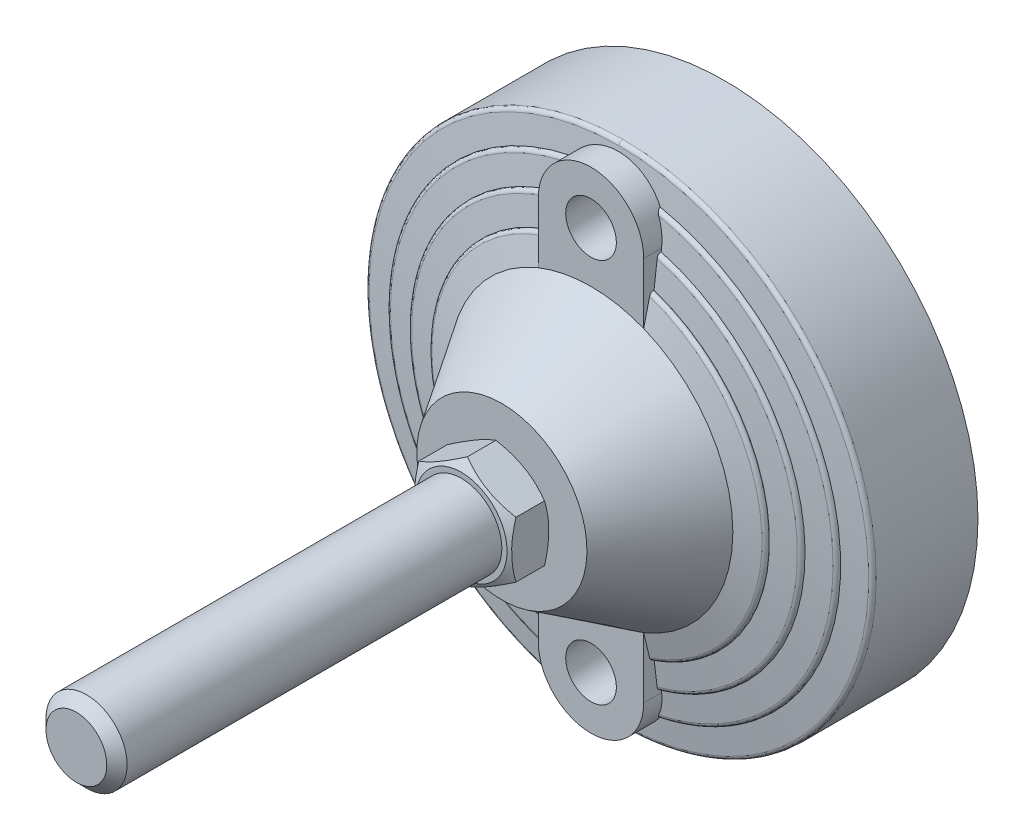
ISO-10303-21;
HEADER;
FILE_DESCRIPTION(('STEP AP214'),'2;1');
FILE_NAME('part.step','',(''),(''),'','','');
FILE_SCHEMA(('AUTOMOTIVE_DESIGN { 1 0 10303 214 1 1 1 1 }'));
ENDSEC;
DATA;
#1=APPLICATION_CONTEXT('core data for automotive mechanical design processes');
#2=APPLICATION_PROTOCOL_DEFINITION('international standard','automotive_design',2000,#1);
#3=PRODUCT_CONTEXT('',#1,'mechanical');
#4=PRODUCT('Part','Part','',(#3));
#5=PRODUCT_RELATED_PRODUCT_CATEGORY('part','',(#4));
#6=PRODUCT_DEFINITION_FORMATION('','',#4);
#7=PRODUCT_DEFINITION_CONTEXT('part definition',#1,'design');
#8=PRODUCT_DEFINITION('design','',#6,#7);
#9=PRODUCT_DEFINITION_SHAPE('','',#8);
#10=(LENGTH_UNIT() NAMED_UNIT(*) SI_UNIT(.MILLI.,.METRE.));
#11=(NAMED_UNIT(*) PLANE_ANGLE_UNIT() SI_UNIT($,.RADIAN.));
#12=(NAMED_UNIT(*) SI_UNIT($,.STERADIAN.) SOLID_ANGLE_UNIT());
#13=UNCERTAINTY_MEASURE_WITH_UNIT(LENGTH_MEASURE(1.E-05),#10,'distance_accuracy_value','');
#14=(GEOMETRIC_REPRESENTATION_CONTEXT(3) GLOBAL_UNCERTAINTY_ASSIGNED_CONTEXT((#13)) GLOBAL_UNIT_ASSIGNED_CONTEXT((#10,
#11,#12)) REPRESENTATION_CONTEXT('',''));
#15=CARTESIAN_POINT('',(0.,0.,0.));
#16=DIRECTION('',(0.,0.,1.));
#17=DIRECTION('',(1.,0.,0.));
#18=AXIS2_PLACEMENT_3D('',#15,#16,#17);
#19=CARTESIAN_POINT('',(-6.346764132,-41.175,10.));
#20=DIRECTION('',(0.,0.,1.));
#21=DIRECTION('',(0.,-1.,0.));
#22=AXIS2_PLACEMENT_3D('',#19,#20,#21);
#23=PLANE('',#22);
#24=CARTESIAN_POINT('',(0.,-47.5,10.));
#25=DIRECTION('',(0.,0.,1.));
#26=DIRECTION('',(-1.,0.,0.));
#27=AXIS2_PLACEMENT_3D('',#24,#25,#26);
#28=CIRCLE('',#27,6.25);
#29=CARTESIAN_POINT('',(-6.25,-47.5,10.));
#30=VERTEX_POINT('',#29);
#31=EDGE_CURVE('E218',#30,#30,#28,.T.);
#32=ORIENTED_EDGE('',*,*,#31,.T.);
#33=EDGE_LOOP('',(#32));
#34=FACE_BOUND('',#33,.T.);
#35=ADVANCED_FACE('F14',(#34),#23,.T.);
#36=CARTESIAN_POINT('',(-63.467641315,63.25,0.));
#37=DIRECTION('',(0.,0.,1.));
#38=DIRECTION('',(0.,-1.,0.));
#39=AXIS2_PLACEMENT_3D('',#36,#37,#38);
#40=PLANE('',#39);
#41=CARTESIAN_POINT('',(0.,0.,0.));
#42=DIRECTION('',(0.,0.,-1.));
#43=DIRECTION('',(1.,0.,0.));
#44=AXIS2_PLACEMENT_3D('',#41,#42,#43);
#45=CIRCLE('',#44,62.5);
#46=CARTESIAN_POINT('',(62.5,0.,0.));
#47=VERTEX_POINT('',#46);
#48=EDGE_CURVE('E419',#47,#47,#45,.F.);
#49=ORIENTED_EDGE('',*,*,#48,.F.);
#50=EDGE_LOOP('',(#49));
#51=FACE_BOUND('',#50,.T.);
#52=ADVANCED_FACE('F1045',(#51),#40,.F.);
#53=CARTESIAN_POINT('',(0.,-47.5,10.));
#54=DIRECTION('',(0.,0.,1.));
#55=DIRECTION('',(-1.,0.,0.));
#56=AXIS2_PLACEMENT_3D('',#53,#54,#55);
#57=CYLINDRICAL_SURFACE('',#56,6.25);
#58=ORIENTED_EDGE('',*,*,#31,.F.);
#59=EDGE_LOOP('',(#58));
#60=FACE_BOUND('',#59,.T.);
#61=CARTESIAN_POINT('',(0.,-47.5,33.));
#62=DIRECTION('',(0.,0.,1.));
#63=DIRECTION('',(-1.,0.,0.));
#64=AXIS2_PLACEMENT_3D('',#61,#62,#63);
#65=CIRCLE('',#64,6.25);
#66=CARTESIAN_POINT('',(-6.25,-47.5,33.));
#67=VERTEX_POINT('',#66);
#68=EDGE_CURVE('E574',#67,#67,#65,.T.);
#69=ORIENTED_EDGE('',*,*,#68,.T.);
#70=EDGE_LOOP('',(#69));
#71=FACE_BOUND('',#70,.T.);
#72=ADVANCED_FACE('F699',(#60,#71),#57,.F.);
#73=CARTESIAN_POINT('',(-21.325127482,-21.252,55.));
#74=DIRECTION('',(0.,0.,-1.));
#75=DIRECTION('',(0.,1.,0.));
#76=AXIS2_PLACEMENT_3D('',#73,#74,#75);
#77=PLANE('',#76);
#78=CARTESIAN_POINT('',(0.,0.,55.));
#79=DIRECTION('',(0.,0.,-1.));
#80=DIRECTION('',(0.,1.,0.));
#81=AXIS2_PLACEMENT_3D('',#78,#79,#80);
#82=CIRCLE('',#81,21.);
#83=CARTESIAN_POINT('',(0.,21.,55.));
#84=VERTEX_POINT('',#83);
#85=EDGE_CURVE('E573',#84,#84,#82,.T.);
#86=ORIENTED_EDGE('',*,*,#85,.F.);
#87=EDGE_LOOP('',(#86));
#88=FACE_BOUND('',#87,.T.);
#89=CARTESIAN_POINT('',(0.,0.,55.));
#90=DIRECTION('',(0.,0.,-1.));
#91=DIRECTION('',(0.,1.,0.));
#92=AXIS2_PLACEMENT_3D('',#89,#90,#91);
#93=CIRCLE('',#92,11.2910461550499);
#94=CARTESIAN_POINT('',(0.,11.2910461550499,55.));
#95=VERTEX_POINT('',#94);
#96=EDGE_CURVE('E214',#95,#95,#93,.T.);
#97=ORIENTED_EDGE('',*,*,#96,.T.);
#98=EDGE_LOOP('',(#97));
#99=FACE_BOUND('',#98,.T.);
#100=ADVANCED_FACE('F1027',(#88,#99),#77,.F.);
#101=CARTESIAN_POINT('',(-6.346764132,53.825,10.));
#102=DIRECTION('',(0.,0.,1.));
#103=DIRECTION('',(0.,-1.,0.));
#104=AXIS2_PLACEMENT_3D('',#101,#102,#103);
#105=PLANE('',#104);
#106=CARTESIAN_POINT('',(0.,47.5,10.));
#107=DIRECTION('',(0.,0.,1.));
#108=DIRECTION('',(-1.,0.,0.));
#109=AXIS2_PLACEMENT_3D('',#106,#107,#108);
#110=CIRCLE('',#109,6.25);
#111=CARTESIAN_POINT('',(-6.25,47.5,10.));
#112=VERTEX_POINT('',#111);
#113=EDGE_CURVE('E689',#112,#112,#110,.T.);
#114=ORIENTED_EDGE('',*,*,#113,.T.);
#115=EDGE_LOOP('',(#114));
#116=FACE_BOUND('',#115,.T.);
#117=ADVANCED_FACE('F387',(#116),#105,.T.);
#118=CARTESIAN_POINT('',(0.,0.,33.));
#119=DIRECTION('',(0.,0.,-1.));
#120=DIRECTION('',(0.,1.,0.));
#121=AXIS2_PLACEMENT_3D('',#118,#119,#120);
#122=CONICAL_SURFACE('',#121,35.,1.32154418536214);
#123=CARTESIAN_POINT('',(0.,0.,33.));
#124=DIRECTION('',(0.,0.,-1.));
#125=DIRECTION('',(0.,1.,0.));
#126=AXIS2_PLACEMENT_3D('',#123,#124,#125);
#127=CIRCLE('',#126,35.);
#128=CARTESIAN_POINT('',(12.9999999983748,-32.4961536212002,32.9999999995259));
#129=VERTEX_POINT('',#128);
#130=CARTESIAN_POINT('',(13.0000000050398,32.4961536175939,32.999999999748));
#131=VERTEX_POINT('',#130);
#132=EDGE_CURVE('E570',#129,#131,#127,.F.);
#133=ORIENTED_EDGE('',*,*,#132,.F.);
#134=CARTESIAN_POINT('',(13.0000000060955,-38.6172483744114,31.5372089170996));
#135=CARTESIAN_POINT('',(13.0000000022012,-38.1074186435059,31.6602002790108));
#136=CARTESIAN_POINT('',(13.0000000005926,-37.5975329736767,31.7829600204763));
#137=CARTESIAN_POINT('',(12.9999999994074,-36.5776365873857,32.0279559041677));
#138=CARTESIAN_POINT('',(12.9999999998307,-36.0676258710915,32.1501920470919));
#139=CARTESIAN_POINT('',(13.0000000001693,-35.0474647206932,32.3940807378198));
#140=CARTESIAN_POINT('',(13.0000000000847,-34.5373142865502,32.5157332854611));
#141=CARTESIAN_POINT('',(12.9999999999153,-33.5168560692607,32.7583795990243));
#142=CARTESIAN_POINT('',(12.9999999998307,-33.0065482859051,32.8793733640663));
#143=CARTESIAN_POINT('',(13.,-32.496153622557,32.9999999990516));
#144=B_SPLINE_CURVE_WITH_KNOTS('',3,(#134,#135,#136,#137,#138,#139,#140,#141,#142,#143),
.UNSPECIFIED.,.F.,.F.,(4,2,2,2,4),(0.,1.57336555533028,3.14672901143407,4.72009290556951,
6.2934589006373),.UNSPECIFIED.);
#145=CARTESIAN_POINT('',(13.,-38.6172483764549,31.5372089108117));
#146=VERTEX_POINT('',#145);
#147=EDGE_CURVE('E372',#146,#129,#144,.T.);
#148=ORIENTED_EDGE('',*,*,#147,.F.);
#149=CARTESIAN_POINT('',(0.,0.,31.53720891));
#150=DIRECTION('',(0.,0.,-1.));
#151=DIRECTION('',(0.,1.,0.));
#152=AXIS2_PLACEMENT_3D('',#149,#150,#151);
#153=CIRCLE('',#152,40.746679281);
#154=CARTESIAN_POINT('',(13.,38.6172483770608,31.5372089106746));
#155=VERTEX_POINT('',#154);
#156=EDGE_CURVE('E222',#155,#146,#153,.T.);
#157=ORIENTED_EDGE('',*,*,#156,.F.);
#158=CARTESIAN_POINT('',(13.,32.4961536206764,32.999999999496));
#159=CARTESIAN_POINT('',(13.,33.0065482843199,32.8793733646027));
#160=CARTESIAN_POINT('',(13.,33.5168560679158,32.758379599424));
#161=CARTESIAN_POINT('',(13.,34.5373142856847,32.515733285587));
#162=CARTESIAN_POINT('',(13.,35.0474647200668,32.3940807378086));
#163=CARTESIAN_POINT('',(13.,36.0676258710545,32.1501920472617));
#164=CARTESIAN_POINT('',(13.,36.577636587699,32.0279559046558));
#165=CARTESIAN_POINT('',(13.,37.597532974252,31.7829600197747));
#166=CARTESIAN_POINT('',(13.,38.1074186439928,31.6602002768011));
#167=CARTESIAN_POINT('',(13.,38.6172483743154,31.5372089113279));
#168=B_SPLINE_CURVE_WITH_KNOTS('',3,(#158,#159,#160,#161,#162,#163,#164,#165,#166,#167),
.UNSPECIFIED.,.F.,.F.,(4,2,2,2,4),(0.,1.57336599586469,3.1467298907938,4.72009334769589,
6.29345890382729),.UNSPECIFIED.);
#169=EDGE_CURVE('E681',#131,#155,#168,.T.);
#170=ORIENTED_EDGE('',*,*,#169,.F.);
#171=EDGE_LOOP('',(#133,#148,#157,#170));
#172=FACE_BOUND('',#171,.T.);
#173=ADVANCED_FACE('F680',(#172),#122,.T.);
#174=CARTESIAN_POINT('',(12.406354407,39.602176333,30.568111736));
#175=CARTESIAN_POINT('',(59.707464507,24.78394183,30.568111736));
#176=CARTESIAN_POINT('',(59.707464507,-24.78394183,30.568111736));
#177=CARTESIAN_POINT('',(12.406354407,-39.602176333,30.568111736));
#178=CARTESIAN_POINT('',(12.406354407,39.602176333,31.044046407));
#179=CARTESIAN_POINT('',(59.707464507,24.78394183,31.044046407));
#180=CARTESIAN_POINT('',(59.707464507,-24.78394183,31.044046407));
#181=CARTESIAN_POINT('',(12.406354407,-39.602176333,31.044046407));
#182=CARTESIAN_POINT('',(12.31903347,39.323440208,31.419805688));
#183=CARTESIAN_POINT('',(59.287219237,24.609502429,31.419805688));
#184=CARTESIAN_POINT('',(59.287219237,-24.609502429,31.419805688));
#185=CARTESIAN_POINT('',(12.31903347,-39.323440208,31.419805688));
#186=CARTESIAN_POINT('',(12.18115046,38.883305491,31.53720891));
#187=CARTESIAN_POINT('',(58.623636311,24.334056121,31.53720891));
#188=CARTESIAN_POINT('',(58.623636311,-24.334056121,31.53720891));
#189=CARTESIAN_POINT('',(12.18115046,-38.883305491,31.53720891));
#190=(BOUNDED_SURFACE() B_SPLINE_SURFACE(3,3,((#174,#175,#176,#177),(#178,#179,#180,#181),(#182,
#183,#184,#185),(#186,#187,#188,#189)),.UNSPECIFIED.,.F.,.F.,
.F.) B_SPLINE_SURFACE_WITH_KNOTS((4,4),(4,4),(0.,1.),(0.,1.),
.UNSPECIFIED.) GEOMETRIC_REPRESENTATION_ITEM() RATIONAL_B_SPLINE_SURFACE(((1.,0.532632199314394,
0.532632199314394,1.),(0.859679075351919,0.457892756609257,0.457892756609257,0.859679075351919),
(0.859679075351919,0.457892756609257,0.457892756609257,0.859679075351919),(1.,0.532632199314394,
0.532632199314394,1.))) REPRESENTATION_ITEM('') SURFACE());
#191=CARTESIAN_POINT('',(13.,-39.4112927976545,30.5681117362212));
#192=CARTESIAN_POINT('',(13.,-39.411293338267,30.5952104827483));
#193=CARTESIAN_POINT('',(13.,-39.4101321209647,30.6222958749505));
#194=CARTESIAN_POINT('',(13.,-39.4055044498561,30.6762650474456));
#195=CARTESIAN_POINT('',(13.,-39.4020383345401,30.7031488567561));
#196=CARTESIAN_POINT('',(13.,-39.3882336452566,30.7831079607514));
#197=CARTESIAN_POINT('',(13.,-39.3744885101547,30.8356344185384));
#198=CARTESIAN_POINT('',(13.,-39.3384084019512,30.9376087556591));
#199=CARTESIAN_POINT('',(13.,-39.3160736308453,30.9870567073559));
#200=CARTESIAN_POINT('',(13.,-39.2635909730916,31.0816017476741));
#201=CARTESIAN_POINT('',(13.,-39.233444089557,31.1266993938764));
#202=CARTESIAN_POINT('',(13.,-39.1656058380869,31.2123360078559));
#203=CARTESIAN_POINT('',(13.,-39.1277714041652,31.2527614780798));
#204=CARTESIAN_POINT('',(13.,-39.0461074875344,31.3270714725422));
#205=CARTESIAN_POINT('',(13.,-39.0022718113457,31.3609491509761));
#206=CARTESIAN_POINT('',(13.,-38.9043172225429,31.425052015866));
#207=CARTESIAN_POINT('',(13.,-38.8495953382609,31.4543647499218));
#208=CARTESIAN_POINT('',(13.,-38.7644641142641,31.4909906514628));
#209=CARTESIAN_POINT('',(13.,-38.7355751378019,31.5019763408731));
#210=CARTESIAN_POINT('',(13.,-38.6769796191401,31.5214626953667));
#211=CARTESIAN_POINT('',(13.,-38.6472733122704,31.5299640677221));
#212=CARTESIAN_POINT('',(13.,-38.6172483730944,31.5372089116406));
#213=B_SPLINE_CURVE_WITH_KNOTS('',3,(#191,#192,#193,#194,#195,#196,#197,#198,#199,#200,#201,
#202,#203,#204,#205,#206,#207,#208,#209,#210,#211,#212),.UNSPECIFIED.,.F.,.F.,(4,2,2,2,2,2,2,2,
2,2,4),(0.,0.0812450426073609,0.162478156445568,0.324519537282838,0.486557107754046,
0.648573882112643,0.813939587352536,0.979477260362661,1.16468654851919,1.25731455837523,
1.3499161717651),.UNSPECIFIED.);
#214=CARTESIAN_POINT('',(13.,-39.4112928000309,30.5681117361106));
#215=VERTEX_POINT('',#214);
#216=EDGE_CURVE('E399',#215,#146,#213,.T.);
#217=CARTESIAN_POINT('',(0.,0.,30.568111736));
#218=DIRECTION('',(0.,0.,-1.));
#219=DIRECTION('',(0.,1.,0.));
#220=AXIS2_PLACEMENT_3D('',#217,#218,#219);
#221=CIRCLE('',#220,41.5);
#222=CARTESIAN_POINT('',(13.,39.4112928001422,30.5681117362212));
#223=VERTEX_POINT('',#222);
#224=EDGE_CURVE('E430',#223,#215,#221,.T.);
#225=CARTESIAN_POINT('',(13.,38.6172483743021,31.5372089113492));
#226=CARTESIAN_POINT('',(13.,38.6757273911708,31.5231434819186));
#227=CARTESIAN_POINT('',(13.,38.7330575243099,31.5042077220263));
#228=CARTESIAN_POINT('',(13.,38.8438981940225,31.4570874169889));
#229=CARTESIAN_POINT('',(13.,38.8974017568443,31.4288864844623));
#230=CARTESIAN_POINT('',(13.,38.9989209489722,31.363734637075));
#231=CARTESIAN_POINT('',(13.,39.0469285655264,31.3267711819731));
#232=CARTESIAN_POINT('',(13.,39.135707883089,31.2450475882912));
#233=CARTESIAN_POINT('',(13.,39.1764870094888,31.2002955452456));
#234=CARTESIAN_POINT('',(13.,39.247988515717,31.1059931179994));
#235=CARTESIAN_POINT('',(13.,39.2790300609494,31.0566848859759));
#236=CARTESIAN_POINT('',(13.,39.3318958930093,30.9533393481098));
#237=CARTESIAN_POINT('',(13.,39.3537228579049,30.899303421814));
#238=CARTESIAN_POINT('',(13.,39.3839717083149,30.7991363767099));
#239=CARTESIAN_POINT('',(13.,39.3941848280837,30.7535382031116));
#240=CARTESIAN_POINT('',(13.,39.4078594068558,30.6613400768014));
#241=CARTESIAN_POINT('',(13.,39.4113205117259,30.6147400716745));
#242=CARTESIAN_POINT('',(13.,39.4112927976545,30.5681117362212));
#243=B_SPLINE_CURVE_WITH_KNOTS('',3,(#225,#226,#227,#228,#229,#230,#231,#232,#233,#234,#235,
#236,#237,#238,#239,#240,#241,#242),.UNSPECIFIED.,.F.,.F.,(4,2,2,2,2,2,2,2,4),(0.,
0.180276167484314,0.360872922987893,0.541729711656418,0.722399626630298,0.896310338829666,
1.07017047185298,1.20986981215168,1.34957647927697),.UNSPECIFIED.);
#244=EDGE_CURVE('E659',#155,#223,#243,.T.);
#245=ORIENTED_EDGE('',*,*,#156,.T.);
#246=ORIENTED_EDGE('',*,*,#216,.F.);
#247=ORIENTED_EDGE('',*,*,#224,.F.);
#248=ORIENTED_EDGE('',*,*,#244,.F.);
#249=EDGE_LOOP('',(#245,#246,#247,#248));
#250=FACE_BOUND('',#249,.T.);
#251=ADVANCED_FACE('F673',(#250),#190,.T.);
#252=CARTESIAN_POINT('',(0.,0.,30.568111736));
#253=DIRECTION('',(0.,0.,-1.));
#254=DIRECTION('',(0.,1.,0.));
#255=AXIS2_PLACEMENT_3D('',#252,#253,#254);
#256=CYLINDRICAL_SURFACE('',#255,41.5);
#257=CARTESIAN_POINT('',(0.,0.,30.4545454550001));
#258=DIRECTION('',(0.,0.,-1.));
#259=DIRECTION('',(0.,1.,0.));
#260=AXIS2_PLACEMENT_3D('',#257,#258,#259);
#261=CIRCLE('',#260,41.5);
#262=CARTESIAN_POINT('',(13.,39.4112928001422,30.4545454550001));
#263=VERTEX_POINT('',#262);
#264=CARTESIAN_POINT('',(13.,-39.4112928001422,30.4545454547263));
#265=VERTEX_POINT('',#264);
#266=EDGE_CURVE('E552',#263,#265,#261,.T.);
#267=ORIENTED_EDGE('',*,*,#266,.F.);
#268=DIRECTION('',(0.,0.,-1.));
#269=VECTOR('',#268,1.);
#270=CARTESIAN_POINT('',(13.,39.4112928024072,30.7755712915));
#271=LINE('',#270,#269);
#272=EDGE_CURVE('E655',#223,#263,#271,.T.);
#273=ORIENTED_EDGE('',*,*,#272,.F.);
#274=ORIENTED_EDGE('',*,*,#224,.T.);
#275=DIRECTION('',(0.,0.,1.));
#276=VECTOR('',#275,1.);
#277=CARTESIAN_POINT('',(13.,-39.4112928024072,30.7755712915));
#278=LINE('',#277,#276);
#279=EDGE_CURVE('E412',#265,#215,#278,.T.);
#280=ORIENTED_EDGE('',*,*,#279,.F.);
#281=EDGE_LOOP('',(#267,#273,#274,#280));
#282=FACE_BOUND('',#281,.T.);
#283=ADVANCED_FACE('F670',(#282),#256,.T.);
#284=CARTESIAN_POINT('',(0.,0.,30.454545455));
#285=DIRECTION('',(0.,0.,-1.));
#286=DIRECTION('',(0.,1.,0.));
#287=AXIS2_PLACEMENT_3D('',#284,#285,#286);
#288=CONICAL_SURFACE('',#287,41.5,1.4442041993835);
#289=ORIENTED_EDGE('',*,*,#266,.T.);
#290=CARTESIAN_POINT('',(13.0000000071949,-45.8176832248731,29.6748403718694));
#291=CARTESIAN_POINT('',(13.0000000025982,-45.2838642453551,29.7402005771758));
#292=CARTESIAN_POINT('',(13.0000000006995,-44.7500350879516,29.8054777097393));
#293=CARTESIAN_POINT('',(12.9999999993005,-43.6823542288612,29.9358466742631));
#294=CARTESIAN_POINT('',(12.9999999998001,-43.1485025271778,30.0009385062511));
#295=CARTESIAN_POINT('',(13.0000000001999,-42.0807742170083,30.1309177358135));
#296=CARTESIAN_POINT('',(13.0000000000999,-41.5468976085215,30.1958051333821));
#297=CARTESIAN_POINT('',(12.9999999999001,-40.4791166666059,30.3253520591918));
#298=CARTESIAN_POINT('',(12.9999999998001,-39.9452123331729,30.390011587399));
#299=CARTESIAN_POINT('',(13.,-39.4112928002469,30.4545454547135));
#300=B_SPLINE_CURVE_WITH_KNOTS('',3,(#290,#291,#292,#293,#294,#295,#296,#297,#298,#299),
.UNSPECIFIED.,.F.,.F.,(4,2,2,2,4),(0.,1.61341623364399,3.22683222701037,4.84024826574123,
6.45366454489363),.UNSPECIFIED.);
#301=CARTESIAN_POINT('',(13.,-45.8176832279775,29.6748403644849));
#302=VERTEX_POINT('',#301);
#303=EDGE_CURVE('E406',#302,#265,#300,.T.);
#304=ORIENTED_EDGE('',*,*,#303,.F.);
#305=CARTESIAN_POINT('',(-7.48558333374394E-10,0.,29.674840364));
#306=DIRECTION('',(0.,0.,-1.));
#307=DIRECTION('',(0.,1.,0.));
#308=AXIS2_PLACEMENT_3D('',#305,#306,#307);
#309=CIRCLE('',#308,47.6262542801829);
#310=CARTESIAN_POINT('',(13.,45.8176832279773,29.6748403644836));
#311=VERTEX_POINT('',#310);
#312=EDGE_CURVE('E426',#311,#302,#309,.T.);
#313=ORIENTED_EDGE('',*,*,#312,.F.);
#314=CARTESIAN_POINT('',(12.999999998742,39.4112928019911,30.4545454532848));
#315=CARTESIAN_POINT('',(12.9999999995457,39.9452123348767,30.3900115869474));
#316=CARTESIAN_POINT('',(12.9999999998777,40.4791166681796,30.3253520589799));
#317=CARTESIAN_POINT('',(13.0000000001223,41.5468976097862,30.1958051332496));
#318=CARTESIAN_POINT('',(13.0000000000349,42.080774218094,30.1309177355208));
#319=CARTESIAN_POINT('',(12.9999999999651,43.1485025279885,30.000938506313));
#320=CARTESIAN_POINT('',(12.9999999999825,43.6823542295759,29.9358466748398));
#321=CARTESIAN_POINT('',(13.0000000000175,44.7500350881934,29.8054777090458));
#322=CARTESIAN_POINT('',(13.0000000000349,45.2838642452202,29.7402005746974));
#323=CARTESIAN_POINT('',(13.,45.817683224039,29.6748403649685));
#324=B_SPLINE_CURVE_WITH_KNOTS('',3,(#314,#315,#316,#317,#318,#319,#320,#321,#322,#323),
.UNSPECIFIED.,.F.,.F.,(4,2,2,2,4),(0.,1.61341627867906,3.226832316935,4.84024830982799,
6.45366454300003),.UNSPECIFIED.);
#325=EDGE_CURVE('E658',#263,#311,#324,.T.);
#326=ORIENTED_EDGE('',*,*,#325,.F.);
#327=EDGE_LOOP('',(#289,#304,#313,#326));
#328=FACE_BOUND('',#327,.T.);
#329=ADVANCED_FACE('F339',(#328),#288,.T.);
#330=CARTESIAN_POINT('',(12.269850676,46.922284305,28.6696231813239));
#331=CARTESIAN_POINT('',(72.557631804,31.157449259,28.6696231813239));
#332=CARTESIAN_POINT('',(72.557631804,-31.157449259,28.6696231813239));
#333=CARTESIAN_POINT('',(12.269850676,-46.922284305,28.6696231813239));
#334=CARTESIAN_POINT('',(12.269850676,46.922284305,28.6740296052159));
#335=CARTESIAN_POINT('',(72.557631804,31.157449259,28.6740296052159));
#336=CARTESIAN_POINT('',(72.557631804,-31.157449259,28.6740296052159));
#337=CARTESIAN_POINT('',(12.269850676,-46.922284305,28.6740296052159));
#338=CARTESIAN_POINT('',(12.269850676,46.922284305,28.678436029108));
#339=CARTESIAN_POINT('',(72.557631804,31.157449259,28.678436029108));
#340=CARTESIAN_POINT('',(72.557631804,-31.157449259,28.678436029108));
#341=CARTESIAN_POINT('',(12.269850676,-46.922284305,28.678436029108));
#342=CARTESIAN_POINT('',(12.269850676,46.922284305,28.682842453));
#343=CARTESIAN_POINT('',(72.557631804,31.157449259,28.682842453));
#344=CARTESIAN_POINT('',(72.557631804,-31.157449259,28.682842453));
#345=CARTESIAN_POINT('',(12.269850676,-46.922284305,28.682842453));
#346=CARTESIAN_POINT('',(12.269850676,46.922284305,29.211436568));
#347=CARTESIAN_POINT('',(72.5576318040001,31.157449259,29.211436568));
#348=CARTESIAN_POINT('',(72.5576318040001,-31.157449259,29.211436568));
#349=CARTESIAN_POINT('',(12.269850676,-46.922284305,29.211436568));
#350=CARTESIAN_POINT('',(12.181461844,46.584268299,29.608103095));
#351=CARTESIAN_POINT('',(72.0349453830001,30.93299905,29.608103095));
#352=CARTESIAN_POINT('',(72.0349453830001,-30.93299905,29.608103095));
#353=CARTESIAN_POINT('',(12.181461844,-46.584268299,29.608103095));
#354=CARTESIAN_POINT('',(12.048804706,46.076961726,29.674840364));
#355=CARTESIAN_POINT('',(71.250478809,30.596136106,29.674840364));
#356=CARTESIAN_POINT('',(71.250478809,-30.596136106,29.674840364));
#357=CARTESIAN_POINT('',(12.048804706,-46.076961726,29.674840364));
#358=(BOUNDED_SURFACE() B_SPLINE_SURFACE(3,3,((#330,#331,#332,#333),(#334,#335,#336,#337),(#338,
#339,#340,#341),(#342,#343,#344,#345),(#346,#347,#348,#349),(#350,#351,#352,#353),(#354,#355,
#356,#357)),.UNSPECIFIED.,.F.,.F.,.F.) B_SPLINE_SURFACE_WITH_KNOTS((4,3,4),(4,4),(-0.01,0.,1.),
(0.,1.),.UNSPECIFIED.) GEOMETRIC_REPRESENTATION_ITEM() RATIONAL_B_SPLINE_SURFACE(((1.,
0.501991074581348,0.501991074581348,1.),(1.,0.501991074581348,0.501991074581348,1.),(1.,
0.501991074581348,0.501991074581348,1.),(1.,0.501991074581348,0.501991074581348,1.),
(0.833611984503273,0.418465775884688,0.418465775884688,0.833611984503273),(0.833611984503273,
0.418465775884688,0.418465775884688,0.833611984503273),(1.,0.501991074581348,0.501991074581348,1.))) REPRESENTATION_ITEM('') SURFACE());
#359=CARTESIAN_POINT('',(13.,-46.7252608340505,28.6777848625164));
#360=CARTESIAN_POINT('',(13.,-46.7253979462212,28.7054287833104));
#361=CARTESIAN_POINT('',(13.,-46.7243484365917,28.7330653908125));
#362=CARTESIAN_POINT('',(13.,-46.719887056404,28.788143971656));
#363=CARTESIAN_POINT('',(13.,-46.716475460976,28.8155859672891));
#364=CARTESIAN_POINT('',(13.,-46.7027375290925,28.8972169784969));
#365=CARTESIAN_POINT('',(13.,-46.688908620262,28.9508576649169));
#366=CARTESIAN_POINT('',(13.,-46.6523707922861,29.0550506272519));
#367=CARTESIAN_POINT('',(13.,-46.6296523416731,29.1055995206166));
#368=CARTESIAN_POINT('',(13.,-46.5760978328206,29.2021956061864));
#369=CARTESIAN_POINT('',(13.,-46.545261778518,29.2482428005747));
#370=CARTESIAN_POINT('',(13.,-46.4762858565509,29.3348542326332));
#371=CARTESIAN_POINT('',(13.,-46.438110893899,29.3753904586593));
#372=CARTESIAN_POINT('',(13.,-46.3556866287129,29.4497572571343));
#373=CARTESIAN_POINT('',(13.,-46.311434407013,29.4835845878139));
#374=CARTESIAN_POINT('',(13.,-46.2164675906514,29.5448274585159));
#375=CARTESIAN_POINT('',(13.,-46.1655796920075,29.5719736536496));
#376=CARTESIAN_POINT('',(13.,-46.0601083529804,29.6176355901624));
#377=CARTESIAN_POINT('',(13.,-46.0055288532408,29.6361603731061));
#378=CARTESIAN_POINT('',(13.,-45.9281089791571,29.6556819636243));
#379=CARTESIAN_POINT('',(13.,-45.9061721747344,29.6604842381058));
#380=CARTESIAN_POINT('',(13.,-45.8620822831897,29.6686997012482));
#381=CARTESIAN_POINT('',(13.,-45.8399296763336,29.672115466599));
#382=CARTESIAN_POINT('',(13.0000000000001,-45.817683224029,29.674840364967));
#383=B_SPLINE_CURVE_WITH_KNOTS('',3,(#359,#360,#361,#362,#363,#364,#365,#366,#367,#368,#369,
#370,#371,#372,#373,#374,#375,#376,#377,#378,#379,#380,#381,#382),.UNSPECIFIED.,.F.,.F.,(4,2,2,
2,2,2,2,2,2,2,2,4),(0.,0.0828810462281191,0.165752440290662,0.331061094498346,0.496547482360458,
0.662033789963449,0.828332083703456,0.994710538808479,1.1669783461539,1.33906508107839,
1.40639957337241,1.47360835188),.UNSPECIFIED.);
#384=CARTESIAN_POINT('',(13.0000000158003,-46.7252608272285,28.6777848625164));
#385=VERTEX_POINT('',#384);
#386=EDGE_CURVE('E370',#385,#302,#383,.T.);
#387=CARTESIAN_POINT('',(13.0000000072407,46.725260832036,28.6727272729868));
#388=CARTESIAN_POINT('',(13.3212147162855,46.6358917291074,28.6727272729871));
#389=CARTESIAN_POINT('',(13.6414983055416,46.543212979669,28.6727272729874));
#390=CARTESIAN_POINT('',(14.2801231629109,46.3512597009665,28.672727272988));
#391=CARTESIAN_POINT('',(14.5984642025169,46.2519844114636,28.6727272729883));
#392=CARTESIAN_POINT('',(15.5526106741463,45.9435979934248,28.6727272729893));
#393=CARTESIAN_POINT('',(16.1852411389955,45.7245656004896,28.6727272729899));
#394=CARTESIAN_POINT('',(17.4409289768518,45.260491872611,28.6727272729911));
#395=CARTESIAN_POINT('',(18.0639854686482,45.0154481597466,28.6727272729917));
#396=CARTESIAN_POINT('',(19.300070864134,44.4995075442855,28.672727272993));
#397=CARTESIAN_POINT('',(19.913088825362,44.2285843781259,28.6727272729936));
#398=CARTESIAN_POINT('',(21.1274202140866,43.6615551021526,28.6727272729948));
#399=CARTESIAN_POINT('',(21.7287319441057,43.365445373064,28.6727272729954));
#400=CARTESIAN_POINT('',(23.5288179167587,42.432139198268,28.6727272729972));
#401=CARTESIAN_POINT('',(24.7079785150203,41.7565378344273,28.6727272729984));
#402=CARTESIAN_POINT('',(27.0057517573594,40.3086198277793,28.6727272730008));
#403=CARTESIAN_POINT('',(28.1243409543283,39.5362661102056,28.672727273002));
#404=CARTESIAN_POINT('',(30.2940548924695,37.8994558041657,28.6727272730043));
#405=CARTESIAN_POINT('',(31.3451007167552,37.0348945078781,28.6727272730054));
#406=CARTESIAN_POINT('',(33.3707378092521,35.2206259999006,28.6727272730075));
#407=CARTESIAN_POINT('',(34.3453363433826,34.270926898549,28.6727272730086));
#408=CARTESIAN_POINT('',(36.2141318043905,32.2900336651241,28.6727272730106));
#409=CARTESIAN_POINT('',(37.1080775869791,31.2586025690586,28.6727272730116));
#410=CARTESIAN_POINT('',(38.8059105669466,29.1240638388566,28.6727272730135));
#411=CARTESIAN_POINT('',(39.6097954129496,28.020954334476,28.6727272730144));
#412=CARTESIAN_POINT('',(41.1215543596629,25.7512426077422,28.6727272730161));
#413=CARTESIAN_POINT('',(41.8294551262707,24.5846581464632,28.6727272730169));
#414=CARTESIAN_POINT('',(43.1444737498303,22.1960153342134,28.6727272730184));
#415=CARTESIAN_POINT('',(43.7515922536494,20.9739573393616,28.6727272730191));
#416=CARTESIAN_POINT('',(44.8608053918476,18.4828923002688,28.6727272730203));
#417=CARTESIAN_POINT('',(45.3628870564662,17.2138794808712,28.6727272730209));
#418=CARTESIAN_POINT('',(46.258363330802,14.638066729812,28.6727272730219));
#419=CARTESIAN_POINT('',(46.6517577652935,13.3312667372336,28.6727272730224));
#420=CARTESIAN_POINT('',(47.3270705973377,10.6891374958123,28.6727272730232));
#421=CARTESIAN_POINT('',(47.6089860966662,9.35380750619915,28.6727272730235));
#422=CARTESIAN_POINT('',(48.0593220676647,6.66414532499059,28.672727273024));
#423=CARTESIAN_POINT('',(48.2277425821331,5.30981314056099,28.6727272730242));
#424=CARTESIAN_POINT('',(48.4498861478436,2.59183878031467,28.6727272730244));
#425=CARTESIAN_POINT('',(48.5036145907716,1.22819704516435,28.6727272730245));
#426=CARTESIAN_POINT('',(48.4960080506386,-1.49876561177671,28.6727272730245));
#427=CARTESIAN_POINT('',(48.4346730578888,-2.86208653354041,28.6727272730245));
#428=CARTESIAN_POINT('',(48.1973677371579,-5.57880747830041,28.6727272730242));
#429=CARTESIAN_POINT('',(48.0213896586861,-6.93220682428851,28.672727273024));
#430=CARTESIAN_POINT('',(47.5560413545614,-9.61936956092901,28.6727272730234));
#431=CARTESIAN_POINT('',(47.2666711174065,-10.9531329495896,28.6727272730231));
#432=CARTESIAN_POINT('',(46.5765756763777,-13.5916227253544,28.6727272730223));
#433=CARTESIAN_POINT('',(46.1758433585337,-14.8963472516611,28.6727272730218));
#434=CARTESIAN_POINT('',(45.2658742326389,-17.4674022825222,28.6727272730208));
#435=CARTESIAN_POINT('',(44.7566374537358,-18.7337327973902,28.6727272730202));
#436=CARTESIAN_POINT('',(43.6334165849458,-21.2187182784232,28.6727272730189));
#437=CARTESIAN_POINT('',(43.0194530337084,-22.4373825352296,28.6727272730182));
#438=CARTESIAN_POINT('',(41.6909757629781,-24.8187625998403,28.6727272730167));
#439=CARTESIAN_POINT('',(40.9764619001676,-25.9814783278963,28.6727272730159));
#440=CARTESIAN_POINT('',(39.7063025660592,-27.8655028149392,28.6727272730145));
#441=CARTESIAN_POINT('',(39.1770724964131,-28.6047764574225,28.6727272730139));
#442=CARTESIAN_POINT('',(38.0778809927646,-30.052466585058,28.6727272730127));
#443=CARTESIAN_POINT('',(37.5079195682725,-30.760883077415,28.6727272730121));
#444=CARTESIAN_POINT('',(36.3291070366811,-32.144549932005,28.6727272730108));
#445=CARTESIAN_POINT('',(35.7202564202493,-32.8198007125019,28.6727272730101));
#446=CARTESIAN_POINT('',(34.4653645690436,-34.1352484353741,28.6727272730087));
#447=CARTESIAN_POINT('',(33.8193109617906,-34.7754335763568,28.672727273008));
#448=CARTESIAN_POINT('',(32.4922294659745,-36.0184899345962,28.6727272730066));
#449=CARTESIAN_POINT('',(31.8112009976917,-36.6213605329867,28.6727272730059));
#450=CARTESIAN_POINT('',(30.4163089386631,-37.7878929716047,28.6727272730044));
#451=CARTESIAN_POINT('',(29.7024437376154,-38.3515528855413,28.6727272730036));
#452=CARTESIAN_POINT('',(28.1769516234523,-39.4879139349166,28.672727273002));
#453=CARTESIAN_POINT('',(27.3623770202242,-40.0566641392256,28.6727272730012));
#454=CARTESIAN_POINT('',(25.6997855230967,-41.1431320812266,28.6727272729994));
#455=CARTESIAN_POINT('',(24.8517655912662,-41.6608451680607,28.6727272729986));
#456=CARTESIAN_POINT('',(23.1254909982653,-42.6432641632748,28.6727272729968));
#457=CARTESIAN_POINT('',(22.2472346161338,-43.1079670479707,28.6727272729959));
#458=CARTESIAN_POINT('',(20.4623876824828,-43.9832963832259,28.6727272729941));
#459=CARTESIAN_POINT('',(19.55575303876,-44.393832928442,28.6727272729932));
#460=CARTESIAN_POINT('',(17.7189637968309,-45.1583612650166,28.6727272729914));
#461=CARTESIAN_POINT('',(16.7888095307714,-45.5123538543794,28.6727272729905));
#462=CARTESIAN_POINT('',(14.9085132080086,-46.1625049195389,28.6727272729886));
#463=CARTESIAN_POINT('',(13.9583713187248,-46.4586638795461,28.6727272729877));
#464=CARTESIAN_POINT('',(13.0000000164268,-46.7252608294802,28.6727272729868));
#465=B_SPLINE_CURVE_WITH_KNOTS('',3,(#387,#388,#389,#390,#391,#392,#393,#394,#395,#396,#397,
#398,#399,#400,#401,#402,#403,#404,#405,#406,#407,#408,#409,#410,#411,#412,#413,#414,#415,#416,
#417,#418,#419,#420,#421,#422,#423,#424,#425,#426,#427,#428,#429,#430,#431,#432,#433,#434,#435,
#436,#437,#438,#439,#440,#441,#442,#443,#444,#445,#446,#447,#448,#449,#450,#451,#452,#453,#454,
#455,#456,#457,#458,#459,#460,#461,#462,#463,#464),.UNSPECIFIED.,.F.,.F.,(4,2,2,2,2,2,2,2,2,2,2,
2,2,2,2,2,2,2,2,2,2,2,2,2,2,2,2,2,2,2,2,2,2,2,2,2,2,2,4),(0.,1.00020816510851,2.00053180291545,
4.00833027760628,6.0163124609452,8.02635452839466,10.0366859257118,14.1084282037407,
18.1817355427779,22.2597186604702,26.3373137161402,30.4271967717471,34.5171865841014,
38.6060377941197,42.6948627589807,46.784192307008,50.873528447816,54.9629708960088,
59.0524118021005,63.1416604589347,67.2309094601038,71.3204349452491,75.4099608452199,
79.4997480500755,83.5895341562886,87.6785191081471,91.7675098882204,94.4937471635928,
97.2199838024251,99.9461860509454,102.673300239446,105.400459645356,108.127752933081,
111.106299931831,114.085118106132,117.06410610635,120.047978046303,123.031807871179,
126.015612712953),.UNSPECIFIED.);
#466=CARTESIAN_POINT('',(13.0000000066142,46.7252608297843,28.6777848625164));
#467=VERTEX_POINT('',#466);
#468=EDGE_CURVE('E328',#467,#385,#465,.T.);
#469=CARTESIAN_POINT('',(13.,45.817683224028,29.6748403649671));
#470=CARTESIAN_POINT('',(13.,45.8768916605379,29.6676266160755));
#471=CARTESIAN_POINT('',(13.,45.9354849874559,29.6554311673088));
#472=CARTESIAN_POINT('',(13.,46.0498761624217,29.6214764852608));
#473=CARTESIAN_POINT('',(13.,46.105671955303,29.5997103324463));
#474=CARTESIAN_POINT('',(13.,46.2128716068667,29.5469963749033));
#475=CARTESIAN_POINT('',(13.,46.2642705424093,29.5160384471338));
#476=CARTESIAN_POINT('',(13.,46.3367247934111,29.4633763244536));
#477=CARTESIAN_POINT('',(13.,46.3600988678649,29.4447881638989));
#478=CARTESIAN_POINT('',(13.,46.4051654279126,29.4056252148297));
#479=CARTESIAN_POINT('',(13.,46.4268560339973,29.3850482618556));
#480=CARTESIAN_POINT('',(13.,46.4880645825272,29.3216088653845));
#481=CARTESIAN_POINT('',(13.,46.5249454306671,29.2761439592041));
#482=CARTESIAN_POINT('',(13.,46.5901806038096,29.1794685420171));
#483=CARTESIAN_POINT('',(13.,46.6185381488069,29.1282602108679));
#484=CARTESIAN_POINT('',(13.,46.6534889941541,29.0492930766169));
#485=CARTESIAN_POINT('',(13.,46.6637514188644,29.0231112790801));
#486=CARTESIAN_POINT('',(13.,46.681971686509,28.9699855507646));
#487=CARTESIAN_POINT('',(13.,46.6899313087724,28.943042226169));
#488=CARTESIAN_POINT('',(13.,46.7102220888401,28.8614024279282));
#489=CARTESIAN_POINT('',(13.,46.7190275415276,28.8057552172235));
#490=CARTESIAN_POINT('',(13.,46.7237631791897,28.7378782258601));
#491=CARTESIAN_POINT('',(13.,46.724374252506,28.7258595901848));
#492=CARTESIAN_POINT('',(13.,46.7251497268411,28.7018236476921));
#493=CARTESIAN_POINT('',(13.,46.725314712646,28.6898063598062));
#494=CARTESIAN_POINT('',(13.,46.7252608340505,28.6777848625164));
#495=B_SPLINE_CURVE_WITH_KNOTS('',3,(#469,#470,#471,#472,#473,#474,#475,#476,#477,#478,#479,
#480,#481,#482,#483,#484,#485,#486,#487,#488,#489,#490,#491,#492,#493,#494),.UNSPECIFIED.,.F.,
.F.,(4,2,2,2,2,2,2,2,2,2,2,2,4),(0.,0.178718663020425,0.357566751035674,0.536612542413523,
0.626107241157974,0.715700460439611,0.890396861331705,1.06502718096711,1.14929679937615,
1.23350112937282,1.40145320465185,1.43755286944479,1.47360518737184),.UNSPECIFIED.);
#496=EDGE_CURVE('E663',#311,#467,#495,.T.);
#497=ORIENTED_EDGE('',*,*,#312,.T.);
#498=ORIENTED_EDGE('',*,*,#386,.F.);
#499=ORIENTED_EDGE('',*,*,#468,.F.);
#500=ORIENTED_EDGE('',*,*,#496,.F.);
#501=EDGE_LOOP('',(#497,#498,#499,#500));
#502=FACE_BOUND('',#501,.T.);
#503=ADVANCED_FACE('F331',(#502),#358,.T.);
#504=CARTESIAN_POINT('',(0.,62.5,25.119206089));
#505=CARTESIAN_POINT('',(125.,62.5,25.119206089));
#506=CARTESIAN_POINT('',(125.,-62.5,25.119206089));
#507=CARTESIAN_POINT('',(0.,-62.5,25.119206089));
#508=CARTESIAN_POINT('',(0.,62.5,25.647800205));
#509=CARTESIAN_POINT('',(125.,62.5,25.647800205));
#510=CARTESIAN_POINT('',(125.,-62.5,25.647800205));
#511=CARTESIAN_POINT('',(0.,-62.5,25.647800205));
#512=CARTESIAN_POINT('',(0.,62.150618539,26.044466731));
#513=CARTESIAN_POINT('',(124.301237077,62.1506185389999,26.044466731));
#514=CARTESIAN_POINT('',(124.301237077,-62.1506185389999,26.044466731));
#515=CARTESIAN_POINT('',(0.,-62.150618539,26.044466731));
#516=CARTESIAN_POINT('',(0.,61.62625428,26.111204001));
#517=CARTESIAN_POINT('',(123.252508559,61.6262542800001,26.111204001));
#518=CARTESIAN_POINT('',(123.252508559,-61.6262542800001,26.111204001));
#519=CARTESIAN_POINT('',(0.,-61.62625428,26.111204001));
#520=(BOUNDED_SURFACE() B_SPLINE_SURFACE(3,3,((#504,#505,#506,#507),(#508,#509,#510,#511),(#512,
#513,#514,#515),(#516,#517,#518,#519)),.UNSPECIFIED.,.F.,.F.,
.F.) B_SPLINE_SURFACE_WITH_KNOTS((4,4),(4,4),(0.,1.),(0.,1.),
.UNSPECIFIED.) GEOMETRIC_REPRESENTATION_ITEM() RATIONAL_B_SPLINE_SURFACE(((1.,0.333333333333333,
0.333333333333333,1.),(0.833611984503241,0.27787066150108,0.27787066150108,0.833611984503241),
(0.833611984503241,0.27787066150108,0.27787066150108,0.833611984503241),(1.,0.333333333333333,
0.333333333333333,1.))) REPRESENTATION_ITEM('') SURFACE());
#521=CARTESIAN_POINT('',(0.,0.,25.119206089));
#522=DIRECTION('',(0.,0.,1.));
#523=DIRECTION('',(0.,-1.,0.));
#524=AXIS2_PLACEMENT_3D('',#521,#522,#523);
#525=CIRCLE('',#524,62.5);
#526=CARTESIAN_POINT('',(-9.61422321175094E-09,-62.5,25.119206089));
#527=VERTEX_POINT('',#526);
#528=CARTESIAN_POINT('',(-2.80605088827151E-09,62.5,25.119206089));
#529=VERTEX_POINT('',#528);
#530=EDGE_CURVE('E423',#527,#529,#525,.T.);
#531=CARTESIAN_POINT('',(0.,62.5,25.119206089));
#532=CARTESIAN_POINT('',(0.,62.5,25.647800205));
#533=CARTESIAN_POINT('',(0.,62.150618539,26.044466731));
#534=CARTESIAN_POINT('',(0.,61.62625428,26.111204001));
#535=(BOUNDED_CURVE() B_SPLINE_CURVE(3,(#531,#532,#533,#534),.UNSPECIFIED.,.F.,
.F.) B_SPLINE_CURVE_WITH_KNOTS((4,4),(0.,1.),
.UNSPECIFIED.) CURVE() GEOMETRIC_REPRESENTATION_ITEM() RATIONAL_B_SPLINE_CURVE((1.,
0.833611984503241,0.833611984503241,1.)) REPRESENTATION_ITEM(''));
#536=CARTESIAN_POINT('',(-8.30046746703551E-09,61.6262542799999,26.1112040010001));
#537=VERTEX_POINT('',#536);
#538=EDGE_CURVE('E559',#537,#529,#535,.F.);
#539=CARTESIAN_POINT('',(0.,0.,26.1112040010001));
#540=DIRECTION('',(0.,0.,-1.));
#541=DIRECTION('',(0.,1.,0.));
#542=AXIS2_PLACEMENT_3D('',#539,#540,#541);
#543=CIRCLE('',#542,61.62625428);
#544=CARTESIAN_POINT('',(-1.57996950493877E-08,-61.6262542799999,26.1112040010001));
#545=VERTEX_POINT('',#544);
#546=EDGE_CURVE('E606',#545,#537,#543,.F.);
#547=CARTESIAN_POINT('',(0.,-62.5,25.119206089));
#548=CARTESIAN_POINT('',(0.,-62.5,25.647800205));
#549=CARTESIAN_POINT('',(0.,-62.150618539,26.044466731));
#550=CARTESIAN_POINT('',(0.,-61.62625428,26.111204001));
#551=(BOUNDED_CURVE() B_SPLINE_CURVE(3,(#547,#548,#549,#550),.UNSPECIFIED.,.F.,
.F.) B_SPLINE_CURVE_WITH_KNOTS((4,4),(0.,1.),
.UNSPECIFIED.) CURVE() GEOMETRIC_REPRESENTATION_ITEM() RATIONAL_B_SPLINE_CURVE((1.,
0.833611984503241,0.833611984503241,1.)) REPRESENTATION_ITEM(''));
#552=EDGE_CURVE('E581',#527,#545,#551,.T.);
#553=ORIENTED_EDGE('',*,*,#530,.T.);
#554=ORIENTED_EDGE('',*,*,#538,.F.);
#555=ORIENTED_EDGE('',*,*,#546,.F.);
#556=ORIENTED_EDGE('',*,*,#552,.F.);
#557=EDGE_LOOP('',(#553,#554,#555,#556));
#558=FACE_BOUND('',#557,.T.);
#559=ADVANCED_FACE('F338',(#558),#520,.T.);
#560=CARTESIAN_POINT('',(0.,0.,25.119206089));
#561=DIRECTION('',(0.,0.,-1.));
#562=DIRECTION('',(1.,0.,0.));
#563=AXIS2_PLACEMENT_3D('',#560,#561,#562);
#564=CYLINDRICAL_SURFACE('',#563,62.5);
#565=ORIENTED_EDGE('',*,*,#530,.F.);
#566=CARTESIAN_POINT('',(0.,0.,25.119206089));
#567=DIRECTION('',(0.,0.,1.));
#568=DIRECTION('',(0.,-1.,0.));
#569=AXIS2_PLACEMENT_3D('',#566,#567,#568);
#570=CIRCLE('',#569,62.5);
#571=EDGE_CURVE('E556',#529,#527,#570,.T.);
#572=ORIENTED_EDGE('',*,*,#571,.F.);
#573=EDGE_LOOP('',(#565,#572));
#574=FACE_BOUND('',#573,.T.);
#575=ORIENTED_EDGE('',*,*,#48,.T.);
#576=EDGE_LOOP('',(#575));
#577=FACE_BOUND('',#576,.T.);
#578=ADVANCED_FACE('F385',(#574,#577),#564,.T.);
#579=CARTESIAN_POINT('',(13.,-47.5,28.551142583));
#580=DIRECTION('',(1.,0.,0.));
#581=DIRECTION('',(0.,1.,0.));
#582=AXIS2_PLACEMENT_3D('',#579,#580,#581);
#583=PLANE('',#582);
#584=ORIENTED_EDGE('',*,*,#279,.T.);
#585=ORIENTED_EDGE('',*,*,#216,.T.);
#586=ORIENTED_EDGE('',*,*,#147,.T.);
#587=DIRECTION('',(0.,-1.,0.));
#588=VECTOR('',#587,1.);
#589=CARTESIAN_POINT('',(13.,-46.5204431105,33.));
#590=LINE('',#589,#588);
#591=CARTESIAN_POINT('',(13.,-47.5000000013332,33.));
#592=VERTEX_POINT('',#591);
#593=EDGE_CURVE('E660',#129,#592,#590,.T.);
#594=ORIENTED_EDGE('',*,*,#593,.T.);
#595=DIRECTION('',(0.,0.,1.));
#596=VECTOR('',#595,1.);
#597=CARTESIAN_POINT('',(13.,-47.5000000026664,29.6070363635));
#598=LINE('',#597,#596);
#599=CARTESIAN_POINT('',(13.,-47.4999998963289,28.5776765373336));
#600=VERTEX_POINT('',#599);
#601=EDGE_CURVE('E562',#600,#592,#598,.T.);
#602=ORIENTED_EDGE('',*,*,#601,.F.);
#603=CARTESIAN_POINT('',(13.,-46.7246498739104,28.67280218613));
#604=CARTESIAN_POINT('',(13.,-46.8538759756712,28.656957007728));
#605=CARTESIAN_POINT('',(13.,-46.983101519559,28.641107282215));
#606=CARTESIAN_POINT('',(13.,-47.241551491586,28.6093987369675));
#607=CARTESIAN_POINT('',(13.,-47.3707759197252,28.593539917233));
#608=CARTESIAN_POINT('',(13.,-47.4999997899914,28.5776765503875));
#609=B_SPLINE_CURVE_WITH_KNOTS('',3,(#603,#604,#605,#606,#607,#608),.UNSPECIFIED.,.F.,.F.,(4,2,
4),(0.,0.39058173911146,0.781163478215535),.UNSPECIFIED.);
#610=EDGE_CURVE('E705',#385,#600,#609,.T.);
#611=ORIENTED_EDGE('',*,*,#610,.F.);
#612=ORIENTED_EDGE('',*,*,#386,.T.);
#613=ORIENTED_EDGE('',*,*,#303,.T.);
#614=EDGE_LOOP('',(#584,#585,#586,#594,#602,#611,#612,#613));
#615=FACE_BOUND('',#614,.T.);
#616=ADVANCED_FACE('F379',(#615),#583,.T.);
#617=CARTESIAN_POINT('',(-13.,-60.713024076,33.));
#618=DIRECTION('',(0.,0.,-1.));
#619=DIRECTION('',(0.,1.,0.));
#620=AXIS2_PLACEMENT_3D('',#617,#618,#619);
#621=PLANE('',#620);
#622=ORIENTED_EDGE('',*,*,#68,.F.);
#623=EDGE_LOOP('',(#622));
#624=FACE_BOUND('',#623,.T.);
#625=ORIENTED_EDGE('',*,*,#593,.F.);
#626=CARTESIAN_POINT('',(0.,0.,33.));
#627=DIRECTION('',(0.,0.,-1.));
#628=DIRECTION('',(0.,1.,0.));
#629=AXIS2_PLACEMENT_3D('',#626,#627,#628);
#630=CIRCLE('',#629,35.);
#631=CARTESIAN_POINT('',(-12.9999999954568,-32.4961536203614,33.));
#632=VERTEX_POINT('',#631);
#633=EDGE_CURVE('E685',#632,#129,#630,.F.);
#634=ORIENTED_EDGE('',*,*,#633,.F.);
#635=DIRECTION('',(0.,1.,0.));
#636=VECTOR('',#635,1.);
#637=CARTESIAN_POINT('',(-13.,-39.95306527,33.));
#638=LINE('',#637,#636);
#639=CARTESIAN_POINT('',(-13.,-47.5,33.));
#640=VERTEX_POINT('',#639);
#641=EDGE_CURVE('E613',#640,#632,#638,.T.);
#642=ORIENTED_EDGE('',*,*,#641,.F.);
#643=CARTESIAN_POINT('',(0.,-47.5,33.));
#644=DIRECTION('',(0.,0.,-1.));
#645=DIRECTION('',(0.,1.,0.));
#646=AXIS2_PLACEMENT_3D('',#643,#644,#645);
#647=CIRCLE('',#646,13.);
#648=EDGE_CURVE('E565',#592,#640,#647,.T.);
#649=ORIENTED_EDGE('',*,*,#648,.F.);
#650=EDGE_LOOP('',(#625,#634,#642,#649));
#651=FACE_BOUND('',#650,.T.);
#652=ADVANCED_FACE('F384',(#624,#651),#621,.F.);
#653=CARTESIAN_POINT('',(0.,0.,55.));
#654=DIRECTION('',(0.,0.,-1.));
#655=DIRECTION('',(0.,1.,0.));
#656=AXIS2_PLACEMENT_3D('',#653,#654,#655);
#657=CONICAL_SURFACE('',#656,21.,0.566729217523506);
#658=ORIENTED_EDGE('',*,*,#85,.T.);
#659=EDGE_LOOP('',(#658));
#660=FACE_BOUND('',#659,.T.);
#661=CARTESIAN_POINT('',(0.,0.,33.));
#662=DIRECTION('',(0.,0.,-1.));
#663=DIRECTION('',(0.,1.,0.));
#664=AXIS2_PLACEMENT_3D('',#661,#662,#663);
#665=CIRCLE('',#664,35.);
#666=CARTESIAN_POINT('',(-13.0000000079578,32.4961536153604,33.));
#667=VERTEX_POINT('',#666);
#668=EDGE_CURVE('E615',#632,#667,#665,.T.);
#669=ORIENTED_EDGE('',*,*,#668,.F.);
#670=ORIENTED_EDGE('',*,*,#633,.T.);
#671=ORIENTED_EDGE('',*,*,#132,.T.);
#672=CARTESIAN_POINT('',(0.,0.,33.));
#673=DIRECTION('',(0.,0.,-1.));
#674=DIRECTION('',(0.,1.,0.));
#675=AXIS2_PLACEMENT_3D('',#672,#673,#674);
#676=CIRCLE('',#675,35.);
#677=EDGE_CURVE('E646',#131,#667,#676,.F.);
#678=ORIENTED_EDGE('',*,*,#677,.T.);
#679=EDGE_LOOP('',(#669,#670,#671,#678));
#680=FACE_BOUND('',#679,.T.);
#681=ADVANCED_FACE('F684',(#660,#680),#657,.T.);
#682=CARTESIAN_POINT('',(0.,47.5,10.));
#683=DIRECTION('',(0.,0.,1.));
#684=DIRECTION('',(-1.,0.,0.));
#685=AXIS2_PLACEMENT_3D('',#682,#683,#684);
#686=CYLINDRICAL_SURFACE('',#685,6.25);
#687=ORIENTED_EDGE('',*,*,#113,.F.);
#688=EDGE_LOOP('',(#687));
#689=FACE_BOUND('',#688,.T.);
#690=CARTESIAN_POINT('',(0.,47.5,33.));
#691=DIRECTION('',(0.,0.,1.));
#692=DIRECTION('',(-1.,0.,0.));
#693=AXIS2_PLACEMENT_3D('',#690,#691,#692);
#694=CIRCLE('',#693,6.25);
#695=CARTESIAN_POINT('',(-6.25,47.5,33.));
#696=VERTEX_POINT('',#695);
#697=EDGE_CURVE('E282',#696,#696,#694,.T.);
#698=ORIENTED_EDGE('',*,*,#697,.T.);
#699=EDGE_LOOP('',(#698));
#700=FACE_BOUND('',#699,.T.);
#701=ADVANCED_FACE('F291',(#689,#700),#686,.F.);
#702=CARTESIAN_POINT('',(13.,32.40613054,28.551142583));
#703=DIRECTION('',(1.,0.,0.));
#704=DIRECTION('',(0.,1.,0.));
#705=AXIS2_PLACEMENT_3D('',#702,#703,#704);
#706=PLANE('',#705);
#707=DIRECTION('',(0.,0.,-1.));
#708=VECTOR('',#707,1.);
#709=CARTESIAN_POINT('',(13.,47.4999999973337,29.6070363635));
#710=LINE('',#709,#708);
#711=CARTESIAN_POINT('',(13.,47.4999999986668,33.));
#712=VERTEX_POINT('',#711);
#713=CARTESIAN_POINT('',(13.,47.4999999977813,28.5776765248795));
#714=VERTEX_POINT('',#713);
#715=EDGE_CURVE('E281',#712,#714,#710,.T.);
#716=ORIENTED_EDGE('',*,*,#715,.F.);
#717=DIRECTION('',(0.,-1.,0.));
#718=VECTOR('',#717,1.);
#719=CARTESIAN_POINT('',(13.,46.498076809,33.));
#720=LINE('',#719,#718);
#721=EDGE_CURVE('E643',#712,#131,#720,.T.);
#722=ORIENTED_EDGE('',*,*,#721,.T.);
#723=ORIENTED_EDGE('',*,*,#169,.T.);
#724=ORIENTED_EDGE('',*,*,#244,.T.);
#725=ORIENTED_EDGE('',*,*,#272,.T.);
#726=ORIENTED_EDGE('',*,*,#325,.T.);
#727=ORIENTED_EDGE('',*,*,#496,.T.);
#728=CARTESIAN_POINT('',(13.000000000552,47.4999999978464,28.5776765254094));
#729=CARTESIAN_POINT('',(13.000000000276,47.3707760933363,28.5935398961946));
#730=CARTESIAN_POINT('',(13.000000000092,47.2415516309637,28.6093987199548));
#731=CARTESIAN_POINT('',(12.999999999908,46.983101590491,28.6411072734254));
#732=CARTESIAN_POINT('',(12.999999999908,46.8538760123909,28.6569570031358));
#733=CARTESIAN_POINT('',(13.,46.7246498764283,28.6728021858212));
#734=B_SPLINE_CURVE_WITH_KNOTS('',3,(#728,#729,#730,#731,#732,#733),.UNSPECIFIED.,.F.,.F.,(4,2,
4),(0.,0.390581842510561,0.781163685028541),.UNSPECIFIED.);
#735=EDGE_CURVE('E330',#714,#467,#734,.T.);
#736=ORIENTED_EDGE('',*,*,#735,.F.);
#737=EDGE_LOOP('',(#716,#722,#723,#724,#725,#726,#727,#736));
#738=FACE_BOUND('',#737,.T.);
#739=ADVANCED_FACE('F289',(#738),#706,.T.);
#740=CARTESIAN_POINT('',(0.,0.,28.672727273));
#741=DIRECTION('',(0.,0.,-1.));
#742=DIRECTION('',(1.,0.,0.));
#743=AXIS2_PLACEMENT_3D('',#740,#741,#742);
#744=CONICAL_SURFACE('',#743,48.5,1.44420419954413);
#745=ORIENTED_EDGE('',*,*,#735,.T.);
#746=ORIENTED_EDGE('',*,*,#468,.T.);
#747=ORIENTED_EDGE('',*,*,#610,.T.);
#748=CARTESIAN_POINT('',(11.593256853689,-53.3818700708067,27.8930221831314));
#749=CARTESIAN_POINT('',(11.7613010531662,-53.0507456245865,27.9296661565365));
#750=CARTESIAN_POINT('',(11.9150335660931,-52.712485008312,27.9673922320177));
#751=CARTESIAN_POINT('',(12.1930253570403,-52.0241209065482,28.0448334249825));
#752=CARTESIAN_POINT('',(12.3172727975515,-51.6740127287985,28.0845493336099));
#753=CARTESIAN_POINT('',(12.5332133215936,-50.9714687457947,28.1649849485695));
#754=CARTESIAN_POINT('',(12.6254861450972,-50.6192069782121,28.2056706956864));
#755=CARTESIAN_POINT('',(12.7801065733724,-49.9085284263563,28.2885418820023));
#756=CARTESIAN_POINT('',(12.8424702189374,-49.5501150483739,28.3307265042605));
#757=CARTESIAN_POINT('',(12.9262918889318,-48.9107514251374,28.4067383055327));
#758=CARTESIAN_POINT('',(12.953801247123,-48.6305476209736,28.4403063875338));
#759=CARTESIAN_POINT('',(12.9907296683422,-48.066897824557,28.5083749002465));
#760=CARTESIAN_POINT('',(13.0000099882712,-47.7834433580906,28.5428804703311));
#761=CARTESIAN_POINT('',(13.,-47.4999997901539,28.5776765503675));
#762=B_SPLINE_CURVE_WITH_KNOTS('',3,(#748,#749,#750,#751,#752,#753,#754,#755,#756,#757,#758,
#759,#760,#761),.UNSPECIFIED.,.F.,.F.,(4,2,2,2,2,2,4),(0.,1.11904065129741,2.23852981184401,
3.33650467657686,4.43389001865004,5.28395886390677,6.14047297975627),.UNSPECIFIED.);
#763=CARTESIAN_POINT('',(11.5932568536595,-53.3818700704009,27.8930221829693));
#764=VERTEX_POINT('',#763);
#765=EDGE_CURVE('E312',#764,#600,#762,.T.);
#766=ORIENTED_EDGE('',*,*,#765,.F.);
#767=CARTESIAN_POINT('',(-6.43582409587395E-11,2.74086309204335E-13,27.893022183));
#768=DIRECTION('',(0.,0.,-1.));
#769=DIRECTION('',(0.,1.,0.));
#770=AXIS2_PLACEMENT_3D('',#767,#768,#769);
#771=CIRCLE('',#770,54.6262542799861);
#772=CARTESIAN_POINT('',(11.5932568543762,53.3818700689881,27.8930221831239));
#773=VERTEX_POINT('',#772);
#774=EDGE_CURVE('E609',#773,#764,#771,.T.);
#775=ORIENTED_EDGE('',*,*,#774,.F.);
#776=CARTESIAN_POINT('',(13.000000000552,47.4999999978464,28.5776765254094));
#777=CARTESIAN_POINT('',(13.0000412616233,47.8703415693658,28.5322107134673));
#778=CARTESIAN_POINT('',(12.9841765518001,48.2407469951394,28.4872383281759));
#779=CARTESIAN_POINT('',(12.9208802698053,48.9791698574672,28.3985010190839));
#780=CARTESIAN_POINT('',(12.8734342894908,49.3471861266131,28.3547366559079));
#781=CARTESIAN_POINT('',(12.7484369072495,50.0709315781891,28.2695070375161));
#782=CARTESIAN_POINT('',(12.6714831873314,50.4267608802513,28.2280137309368));
#783=CARTESIAN_POINT('',(12.4879990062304,51.1307124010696,28.1466643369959));
#784=CARTESIAN_POINT('',(12.3814849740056,51.4788387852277,28.1068073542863));
#785=CARTESIAN_POINT('',(12.1668531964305,52.0877128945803,28.0376853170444));
#786=CARTESIAN_POINT('',(12.0645073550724,52.3504706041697,28.0080576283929));
#787=CARTESIAN_POINT('',(11.8420691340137,52.8708603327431,27.9497450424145));
#788=CARTESIAN_POINT('',(11.7218478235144,53.1284382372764,27.9210690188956));
#789=CARTESIAN_POINT('',(11.5932568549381,53.3818700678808,27.89302218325));
#790=B_SPLINE_CURVE_WITH_KNOTS('',3,(#776,#777,#778,#779,#780,#781,#782,#783,#784,#785,#786,
#787,#788,#789),.UNSPECIFIED.,.F.,.F.,(4,2,2,2,2,2,4),(0.,1.11903694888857,2.23858477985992,
3.33656129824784,4.43392880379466,5.28397257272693,6.14047502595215),.UNSPECIFIED.);
#791=EDGE_CURVE('E272',#714,#773,#790,.T.);
#792=ORIENTED_EDGE('',*,*,#791,.F.);
#793=EDGE_LOOP('',(#745,#746,#747,#766,#775,#792));
#794=FACE_BOUND('',#793,.T.);
#795=ADVANCED_FACE('F284',(#794),#744,.T.);
#796=CARTESIAN_POINT('',(10.12472555,54.568671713,26.8878049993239));
#797=CARTESIAN_POINT('',(88.74549149,39.98129671,26.887804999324));
#798=CARTESIAN_POINT('',(88.74549149,-39.98129671,26.887804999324));
#799=CARTESIAN_POINT('',(10.12472555,-54.568671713,26.8878049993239));
#800=CARTESIAN_POINT('',(10.12472555,54.568671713,26.892211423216));
#801=CARTESIAN_POINT('',(88.74549149,39.98129671,26.892211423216));
#802=CARTESIAN_POINT('',(88.74549149,-39.98129671,26.892211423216));
#803=CARTESIAN_POINT('',(10.12472555,-54.568671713,26.892211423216));
#804=CARTESIAN_POINT('',(10.12472555,54.568671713,26.896617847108));
#805=CARTESIAN_POINT('',(88.74549149,39.98129671,26.896617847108));
#806=CARTESIAN_POINT('',(88.74549149,-39.98129671,26.896617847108));
#807=CARTESIAN_POINT('',(10.12472555,-54.568671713,26.896617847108));
#808=CARTESIAN_POINT('',(10.12472555,54.568671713,26.901024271));
#809=CARTESIAN_POINT('',(88.74549149,39.98129671,26.901024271));
#810=CARTESIAN_POINT('',(88.74549149,-39.98129671,26.901024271));
#811=CARTESIAN_POINT('',(10.12472555,-54.568671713,26.901024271));
#812=CARTESIAN_POINT('',(10.12472555,54.568671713,27.429618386));
#813=CARTESIAN_POINT('',(88.74549149,39.98129671,27.429618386));
#814=CARTESIAN_POINT('',(88.74549149,-39.98129671,27.429618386));
#815=CARTESIAN_POINT('',(10.12472555,-54.568671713,27.429618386));
#816=CARTESIAN_POINT('',(10.060988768,54.225153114,27.826284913));
#817=CARTESIAN_POINT('',(88.186824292,39.7296079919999,27.826284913));
#818=CARTESIAN_POINT('',(88.186824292,-39.7296079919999,27.826284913));
#819=CARTESIAN_POINT('',(10.060988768,-54.225153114,27.826284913));
#820=CARTESIAN_POINT('',(9.965330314,53.709588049,27.893022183));
#821=CARTESIAN_POINT('',(87.348356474,39.351864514,27.893022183));
#822=CARTESIAN_POINT('',(87.348356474,-39.351864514,27.893022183));
#823=CARTESIAN_POINT('',(9.965330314,-53.709588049,27.893022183));
#824=(BOUNDED_SURFACE() B_SPLINE_SURFACE(3,3,((#796,#797,#798,#799),(#800,#801,#802,#803),(#804,
#805,#806,#807),(#808,#809,#810,#811),(#812,#813,#814,#815),(#816,#817,#818,#819),(#820,#821,
#822,#823)),.UNSPECIFIED.,.F.,.F.,.F.) B_SPLINE_SURFACE_WITH_KNOTS((4,3,4),(4,4),(-0.01,0.,1.),
(0.,1.),.UNSPECIFIED.) GEOMETRIC_REPRESENTATION_ITEM() RATIONAL_B_SPLINE_SURFACE(((1.,
0.454951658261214,0.454951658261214,1.),(1.,0.454951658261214,0.454951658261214,1.),(1.,
0.454951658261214,0.454951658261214,1.),(1.,0.454951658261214,0.454951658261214,1.),
(0.83361198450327,0.379253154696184,0.379253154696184,0.83361198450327),(0.83361198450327,
0.379253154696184,0.379253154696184,0.83361198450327),(1.,0.454951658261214,0.454951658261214,1.))) REPRESENTATION_ITEM('') SURFACE());
#825=CARTESIAN_POINT('',(0.,0.,26.890909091));
#826=DIRECTION('',(0.,0.,-1.));
#827=DIRECTION('',(0.,1.,0.));
#828=AXIS2_PLACEMENT_3D('',#825,#826,#827);
#829=CIRCLE('',#828,55.5);
#830=CARTESIAN_POINT('',(11.0210073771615,54.3947368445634,26.8959666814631));
#831=VERTEX_POINT('',#830);
#832=CARTESIAN_POINT('',(11.0210073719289,-54.3947368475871,26.8959666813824));
#833=VERTEX_POINT('',#832);
#834=EDGE_CURVE('E587',#831,#833,#829,.T.);
#835=CARTESIAN_POINT('',(11.5932568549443,53.3818700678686,27.8930221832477));
#836=CARTESIAN_POINT('',(11.5742588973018,53.4193168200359,27.888871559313));
#837=CARTESIAN_POINT('',(11.5551583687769,53.4565124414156,27.8831357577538));
#838=CARTESIAN_POINT('',(11.5168510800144,53.5302460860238,27.8684898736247));
#839=CARTESIAN_POINT('',(11.4976442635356,53.5667837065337,27.8595779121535));
#840=CARTESIAN_POINT('',(11.4398026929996,53.6755694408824,27.827948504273));
#841=CARTESIAN_POINT('',(11.4011915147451,53.7465090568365,27.8003901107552));
#842=CARTESIAN_POINT('',(11.3310664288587,53.8727053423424,27.7372637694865));
#843=CARTESIAN_POINT('',(11.2993422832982,53.9287360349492,27.703463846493));
#844=CARTESIAN_POINT('',(11.2382417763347,54.0349557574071,27.6261176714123));
#845=CARTESIAN_POINT('',(11.2088591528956,54.0851605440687,27.5825986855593));
#846=CARTESIAN_POINT('',(11.1609968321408,54.1658664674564,27.4977952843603));
#847=CARTESIAN_POINT('',(11.1416342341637,54.1981465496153,27.4587049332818));
#848=CARTESIAN_POINT('',(11.1061235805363,54.2568626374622,27.3750125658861));
#849=CARTESIAN_POINT('',(11.0899722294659,54.2833046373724,27.3304162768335));
#850=CARTESIAN_POINT('',(11.0645457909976,54.3246839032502,27.2447155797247));
#851=CARTESIAN_POINT('',(11.0545578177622,54.3408324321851,27.204409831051));
#852=CARTESIAN_POINT('',(11.0382174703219,54.36716815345,27.1212219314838));
#853=CARTESIAN_POINT('',(11.0318575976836,54.3773676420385,27.0783452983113));
#854=CARTESIAN_POINT('',(11.0253158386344,54.3878463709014,27.011905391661));
#855=CARTESIAN_POINT('',(11.0236343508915,54.3905364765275,26.9888429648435));
#856=CARTESIAN_POINT('',(11.0214382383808,54.3940481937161,26.9425113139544));
#857=CARTESIAN_POINT('',(11.0209241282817,54.3948689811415,26.9192420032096));
#858=CARTESIAN_POINT('',(11.0210073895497,54.394736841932,26.8959666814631));
#859=B_SPLINE_CURVE_WITH_KNOTS('',3,(#835,#836,#837,#838,#839,#840,#841,#842,#843,#844,#845,
#846,#847,#848,#849,#850,#851,#852,#853,#854,#855,#856,#857,#858),.UNSPECIFIED.,.F.,.F.,(4,2,2,
2,2,2,2,2,2,2,2,4),(0.,0.126511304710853,0.253097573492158,0.507880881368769,0.725288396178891,
0.942093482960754,1.10433476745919,1.26640868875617,1.399539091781,1.53239333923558,
1.60213777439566,1.67191295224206),.UNSPECIFIED.);
#860=EDGE_CURVE('E280',#773,#831,#859,.T.);
#861=CARTESIAN_POINT('',(11.0210073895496,-54.394736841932,26.8959666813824));
#862=CARTESIAN_POINT('',(11.0209229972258,-54.394870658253,26.9190661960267));
#863=CARTESIAN_POINT('',(11.0214299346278,-54.3940613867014,26.9421693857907));
#864=CARTESIAN_POINT('',(11.0235945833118,-54.3906001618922,26.9881652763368));
#865=CARTESIAN_POINT('',(11.0252513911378,-54.3879496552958,27.0110581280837));
#866=CARTESIAN_POINT('',(11.0296648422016,-54.3808799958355,27.0562576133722));
#867=CARTESIAN_POINT('',(11.0324119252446,-54.3764762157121,27.0785675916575));
#868=CARTESIAN_POINT('',(11.0389383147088,-54.3659943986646,27.1226321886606));
#869=CARTESIAN_POINT('',(11.0427177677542,-54.3599161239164,27.1443867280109));
#870=CARTESIAN_POINT('',(11.0554767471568,-54.3393489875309,27.2085228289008));
#871=CARTESIAN_POINT('',(11.0658887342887,-54.3225090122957,27.2498921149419));
#872=CARTESIAN_POINT('',(11.0898158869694,-54.2835467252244,27.3291278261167));
#873=CARTESIAN_POINT('',(11.1033381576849,-54.2614123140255,27.3669859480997));
#874=CARTESIAN_POINT('',(11.1384598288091,-54.2034507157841,27.45268273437));
#875=CARTESIAN_POINT('',(11.1611616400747,-54.1656369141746,27.4987283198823));
#876=CARTESIAN_POINT('',(11.2095892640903,-54.0838726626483,27.5831368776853));
#877=CARTESIAN_POINT('',(11.235320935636,-54.0399102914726,27.6214845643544));
#878=CARTESIAN_POINT('',(11.296818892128,-53.9332517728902,27.7012510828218));
#879=CARTESIAN_POINT('',(11.3332423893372,-53.8689452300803,27.7400048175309));
#880=CARTESIAN_POINT('',(11.4074242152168,-53.7351050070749,27.8050561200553));
#881=CARTESIAN_POINT('',(11.4451825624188,-53.6655712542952,27.8313535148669));
#882=CARTESIAN_POINT('',(11.5014324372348,-53.5595886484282,27.8613792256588));
#883=CARTESIAN_POINT('',(11.5199102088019,-53.524389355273,27.8697736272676));
#884=CARTESIAN_POINT('',(11.5567095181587,-53.4534911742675,27.8836000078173));
#885=CARTESIAN_POINT('',(11.5750313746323,-53.4177944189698,27.8890420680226));
#886=CARTESIAN_POINT('',(11.5932568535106,-53.3818700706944,27.893022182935));
#887=B_SPLINE_CURVE_WITH_KNOTS('',3,(#861,#862,#863,#864,#865,#866,#867,#868,#869,#870,#871,
#872,#873,#874,#875,#876,#877,#878,#879,#880,#881,#882,#883,#884,#885,#886),.UNSPECIFIED.,.F.,
.F.,(4,2,2,2,2,2,2,2,2,2,2,2,4),(0.,0.069267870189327,0.138481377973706,0.207100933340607,
0.275730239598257,0.412641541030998,0.549868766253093,0.74010033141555,0.930705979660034,
1.17976894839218,1.42883537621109,1.55063397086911,1.67201400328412),.UNSPECIFIED.);
#888=EDGE_CURVE('E614',#833,#764,#887,.T.);
#889=ORIENTED_EDGE('',*,*,#834,.F.);
#890=ORIENTED_EDGE('',*,*,#860,.F.);
#891=ORIENTED_EDGE('',*,*,#774,.T.);
#892=ORIENTED_EDGE('',*,*,#888,.F.);
#893=EDGE_LOOP('',(#889,#890,#891,#892));
#894=FACE_BOUND('',#893,.T.);
#895=ADVANCED_FACE('F288',(#894),#824,.T.);
#896=CARTESIAN_POINT('',(0.,-62.5,25.119206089));
#897=CARTESIAN_POINT('',(-125.,-62.5,25.119206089));
#898=CARTESIAN_POINT('',(-125.,62.5,25.119206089));
#899=CARTESIAN_POINT('',(0.,62.5,25.119206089));
#900=CARTESIAN_POINT('',(0.,-62.5,25.647800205));
#901=CARTESIAN_POINT('',(-125.,-62.5,25.647800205));
#902=CARTESIAN_POINT('',(-125.,62.5,25.647800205));
#903=CARTESIAN_POINT('',(0.,62.5,25.647800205));
#904=CARTESIAN_POINT('',(0.,-62.150618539,26.044466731));
#905=CARTESIAN_POINT('',(-124.301237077,-62.1506185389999,26.044466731));
#906=CARTESIAN_POINT('',(-124.301237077,62.1506185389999,26.044466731));
#907=CARTESIAN_POINT('',(0.,62.150618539,26.044466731));
#908=CARTESIAN_POINT('',(0.,-61.62625428,26.111204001));
#909=CARTESIAN_POINT('',(-123.252508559,-61.6262542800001,26.111204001));
#910=CARTESIAN_POINT('',(-123.252508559,61.6262542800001,26.111204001));
#911=CARTESIAN_POINT('',(0.,61.62625428,26.111204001));
#912=(BOUNDED_SURFACE() B_SPLINE_SURFACE(3,3,((#896,#897,#898,#899),(#900,#901,#902,#903),(#904,
#905,#906,#907),(#908,#909,#910,#911)),.UNSPECIFIED.,.F.,.F.,
.F.) B_SPLINE_SURFACE_WITH_KNOTS((4,4),(4,4),(0.,1.),(0.,1.),
.UNSPECIFIED.) GEOMETRIC_REPRESENTATION_ITEM() RATIONAL_B_SPLINE_SURFACE(((1.,0.333333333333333,
0.333333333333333,1.),(0.833611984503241,0.27787066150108,0.27787066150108,0.833611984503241),
(0.833611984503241,0.27787066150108,0.27787066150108,0.833611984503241),(1.,0.333333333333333,
0.333333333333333,1.))) REPRESENTATION_ITEM('') SURFACE());
#913=CARTESIAN_POINT('',(0.,0.,26.1112040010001));
#914=DIRECTION('',(0.,0.,-1.));
#915=DIRECTION('',(0.,1.,0.));
#916=AXIS2_PLACEMENT_3D('',#913,#914,#915);
#917=CIRCLE('',#916,61.62625428);
#918=EDGE_CURVE('E599',#537,#545,#917,.F.);
#919=ORIENTED_EDGE('',*,*,#538,.T.);
#920=ORIENTED_EDGE('',*,*,#571,.T.);
#921=ORIENTED_EDGE('',*,*,#552,.T.);
#922=ORIENTED_EDGE('',*,*,#918,.F.);
#923=EDGE_LOOP('',(#919,#920,#921,#922));
#924=FACE_BOUND('',#923,.T.);
#925=ADVANCED_FACE('F833',(#924),#912,.T.);
#926=CARTESIAN_POINT('',(0.,-47.5,33.));
#927=DIRECTION('',(0.,0.,-1.));
#928=DIRECTION('',(0.,1.,0.));
#929=AXIS2_PLACEMENT_3D('',#926,#927,#928);
#930=CYLINDRICAL_SURFACE('',#929,13.);
#931=CARTESIAN_POINT('',(11.0212529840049,-54.394344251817,26.8909518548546));
#932=CARTESIAN_POINT('',(10.8279142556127,-54.7034885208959,26.857277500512));
#933=CARTESIAN_POINT('',(10.6214505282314,-55.0045428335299,26.8247251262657));
#934=CARTESIAN_POINT('',(10.1838418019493,-55.5883982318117,26.7619937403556));
#935=CARTESIAN_POINT('',(9.95269731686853,-55.8711996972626,26.7318146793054));
#936=CARTESIAN_POINT('',(9.46740937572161,-56.4163523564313,26.6739724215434));
#937=CARTESIAN_POINT('',(9.21327751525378,-56.678713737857,26.6463079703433));
#938=CARTESIAN_POINT('',(8.68370436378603,-57.1812448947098,26.5935909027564));
#939=CARTESIAN_POINT('',(8.40826348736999,-57.4214151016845,26.5685382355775));
#940=CARTESIAN_POINT('',(7.83782458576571,-57.8779598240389,26.521130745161));
#941=CARTESIAN_POINT('',(7.54281473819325,-58.0943197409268,26.4987775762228));
#942=CARTESIAN_POINT('',(6.93547493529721,-58.5014930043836,26.4568757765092));
#943=CARTESIAN_POINT('',(6.62314503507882,-58.692306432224,26.4373271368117));
#944=CARTESIAN_POINT('',(5.98347109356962,-59.0469378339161,26.4011162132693));
#945=CARTESIAN_POINT('',(5.65613123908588,-59.2107632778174,26.3844531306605));
#946=CARTESIAN_POINT('',(4.98869237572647,-59.5102765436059,26.3540716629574));
#947=CARTESIAN_POINT('',(4.64859345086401,-59.6459645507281,26.3403532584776));
#948=CARTESIAN_POINT('',(3.95859762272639,-59.8880172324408,26.3159327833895));
#949=CARTESIAN_POINT('',(3.60871655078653,-59.9944265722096,26.3052261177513));
#950=CARTESIAN_POINT('',(2.90115937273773,-60.1774131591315,26.2868421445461));
#951=CARTESIAN_POINT('',(2.54348325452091,-60.2539903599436,26.2791648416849));
#952=CARTESIAN_POINT('',(1.82281990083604,-60.3767606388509,26.2668675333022));
#953=CARTESIAN_POINT('',(1.45983150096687,-60.4229469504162,26.262248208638));
#954=CARTESIAN_POINT('',(0.731228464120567,-60.4845665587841,26.2560871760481));
#955=CARTESIAN_POINT('',(0.365613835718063,-60.4999999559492,26.2545454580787));
#956=CARTESIAN_POINT('',(-0.364119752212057,-60.5000000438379,26.2545454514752));
#957=CARTESIAN_POINT('',(-0.728238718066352,-60.4846926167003,26.256074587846));
#958=CARTESIAN_POINT('',(-1.45388119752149,-60.4235754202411,26.262185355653));
#959=CARTESIAN_POINT('',(-1.81540471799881,-60.3777657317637,26.2667669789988));
#960=CARTESIAN_POINT('',(-2.53319266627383,-60.2559952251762,26.2789639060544));
#961=CARTESIAN_POINT('',(-2.88945838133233,-60.1800419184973,26.2865784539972));
#962=CARTESIAN_POINT('',(-3.59429038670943,-59.9985402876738,26.3048124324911));
#963=CARTESIAN_POINT('',(-3.94285668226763,-59.8929919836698,26.3154318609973));
#964=CARTESIAN_POINT('',(-4.6297765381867,-59.6530863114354,26.3396338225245));
#965=CARTESIAN_POINT('',(-4.96813131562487,-59.5187323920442,26.3532160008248));
#966=CARTESIAN_POINT('',(-5.63227981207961,-59.2221876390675,26.3832923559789));
#967=CARTESIAN_POINT('',(-5.95807349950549,-59.0599967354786,26.3997865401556));
#968=CARTESIAN_POINT('',(-6.5948984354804,-58.7089052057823,26.4356288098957));
#969=CARTESIAN_POINT('',(-6.90592525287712,-58.5199966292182,26.45497774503));
#970=CARTESIAN_POINT('',(-7.51093018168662,-58.1168765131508,26.4964507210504));
#971=CARTESIAN_POINT('',(-7.80490813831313,-57.9026647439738,26.5185747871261));
#972=CARTESIAN_POINT('',(-8.37802701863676,-57.4470929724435,26.5658633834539));
#973=CARTESIAN_POINT('',(-8.65687938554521,-57.2053740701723,26.5910685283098));
#974=CARTESIAN_POINT('',(-9.19291505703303,-56.6992507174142,26.6441454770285));
#975=CARTESIAN_POINT('',(-9.4500976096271,-56.4348454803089,26.672017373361));
#976=CARTESIAN_POINT('',(-9.94109957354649,-55.8851277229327,26.730330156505));
#977=CARTESIAN_POINT('',(-10.1749040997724,-55.599802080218,26.76077265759));
#978=CARTESIAN_POINT('',(-10.6173529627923,-55.0105165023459,26.8240792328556));
#979=CARTESIAN_POINT('',(-10.8259970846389,-54.7065564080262,26.8569433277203));
#980=CARTESIAN_POINT('',(-11.0212529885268,-54.3943442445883,26.8909518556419));
#981=B_SPLINE_CURVE_WITH_KNOTS('',3,(#931,#932,#933,#934,#935,#936,#937,#938,#939,#940,#941,
#942,#943,#944,#945,#946,#947,#948,#949,#950,#951,#952,#953,#954,#955,#956,#957,#958,#959,#960,
#961,#962,#963,#964,#965,#966,#967,#968,#969,#970,#971,#972,#973,#974,#975,#976,#977,#978,#979,
#980),.UNSPECIFIED.,.F.,.F.,(4,2,2,2,2,2,2,2,2,2,2,2,2,2,2,2,2,2,2,2,2,2,2,2,4),(0.,
1.09819800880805,2.19637315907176,3.29399740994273,4.3916003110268,5.48987246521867,
6.58814112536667,7.68610528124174,8.78406220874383,9.88033477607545,10.9766090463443,
12.0731273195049,13.1696420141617,14.2616756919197,15.3537064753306,16.4454653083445,
17.5372233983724,18.6288508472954,19.7204810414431,20.8124367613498,21.9044023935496,
23.0127408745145,24.1211178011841,25.2301960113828,26.3392836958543),.UNSPECIFIED.);
#982=CARTESIAN_POINT('',(-11.02100738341,-54.3947368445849,26.8959666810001));
#983=VERTEX_POINT('',#982);
#984=EDGE_CURVE('E603',#833,#983,#981,.T.);
#985=ORIENTED_EDGE('',*,*,#984,.F.);
#986=ORIENTED_EDGE('',*,*,#888,.T.);
#987=ORIENTED_EDGE('',*,*,#765,.T.);
#988=ORIENTED_EDGE('',*,*,#601,.T.);
#989=ORIENTED_EDGE('',*,*,#648,.T.);
#990=DIRECTION('',(0.,0.,1.));
#991=VECTOR('',#990,1.);
#992=CARTESIAN_POINT('',(-13.,-47.5,30.7755712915));
#993=LINE('',#992,#991);
#994=CARTESIAN_POINT('',(-13.,-47.500000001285,28.5776765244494));
#995=VERTEX_POINT('',#994);
#996=EDGE_CURVE('E610',#995,#640,#993,.T.);
#997=ORIENTED_EDGE('',*,*,#996,.F.);
#998=CARTESIAN_POINT('',(-11.5932568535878,-53.3818700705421,27.8930221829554));
#999=CARTESIAN_POINT('',(-11.7613010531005,-53.0507456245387,27.9296661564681));
#1000=CARTESIAN_POINT('',(-11.915033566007,-52.7124850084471,27.967392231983));
#1001=CARTESIAN_POINT('',(-12.1930253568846,-52.024120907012,28.0448334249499));
#1002=CARTESIAN_POINT('',(-12.3172727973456,-51.6740127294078,28.0845493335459));
#1003=CARTESIAN_POINT('',(-12.5332133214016,-50.9714687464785,28.1649849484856));
#1004=CARTESIAN_POINT('',(-12.6254861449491,-50.6192069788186,28.2056706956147));
#1005=CARTESIAN_POINT('',(-12.7801065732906,-49.9085284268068,28.2885418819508));
#1006=CARTESIAN_POINT('',(-12.8424702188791,-49.550115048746,28.3307265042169));
#1007=CARTESIAN_POINT('',(-12.926291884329,-48.9107514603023,28.4067383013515));
#1008=CARTESIAN_POINT('',(-12.9538012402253,-48.6305476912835,28.4403063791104));
#1009=CARTESIAN_POINT('',(-12.9907296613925,-48.0668979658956,28.5083748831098));
#1010=CARTESIAN_POINT('',(-13.0000099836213,-47.783443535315,28.5428804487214));
#1011=CARTESIAN_POINT('',(-13.,-47.5000000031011,28.5776765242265));
#1012=B_SPLINE_CURVE_WITH_KNOTS('',3,(#998,#999,#1000,#1001,#1002,#1003,#1004,#1005,#1006,#1007,
#1008,#1009,#1010,#1011),.UNSPECIFIED.,.F.,.F.,(4,2,2,2,2,2,4),(0.,1.11904065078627,
2.2385298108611,3.33650467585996,4.43389001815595,5.28395875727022,6.1404727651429),.UNSPECIFIED.);
#1013=CARTESIAN_POINT('',(-11.5932568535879,-53.381870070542,27.8930221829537));
#1014=VERTEX_POINT('',#1013);
#1015=EDGE_CURVE('E631',#1014,#995,#1012,.T.);
#1016=ORIENTED_EDGE('',*,*,#1015,.F.);
#1017=CARTESIAN_POINT('',(-11.0210073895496,-54.394736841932,26.8959666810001));
#1018=CARTESIAN_POINT('',(-11.0209229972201,-54.3948706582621,26.9190661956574));
#1019=CARTESIAN_POINT('',(-11.0214299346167,-54.3940613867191,26.9421693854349));
#1020=CARTESIAN_POINT('',(-11.0235945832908,-54.3906001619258,26.988165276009));
#1021=CARTESIAN_POINT('',(-11.0252513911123,-54.3879496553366,27.0110581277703));
#1022=CARTESIAN_POINT('',(-11.0296648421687,-54.3808799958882,27.0562576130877));
#1023=CARTESIAN_POINT('',(-11.0324119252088,-54.3764762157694,27.0785675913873));
#1024=CARTESIAN_POINT('',(-11.0389383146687,-54.3659943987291,27.1226321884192));
#1025=CARTESIAN_POINT('',(-11.0427177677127,-54.3599161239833,27.1443867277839));
#1026=CARTESIAN_POINT('',(-11.0554767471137,-54.3393489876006,27.2085228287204));
#1027=CARTESIAN_POINT('',(-11.0658887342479,-54.3225090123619,27.2498921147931));
#1028=CARTESIAN_POINT('',(-11.0898158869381,-54.2835467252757,27.3291278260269));
#1029=CARTESIAN_POINT('',(-11.1033381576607,-54.2614123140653,27.3669859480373));
#1030=CARTESIAN_POINT('',(-11.1384598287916,-54.2034507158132,27.452682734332));
#1031=CARTESIAN_POINT('',(-11.161161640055,-54.1656369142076,27.4987283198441));
#1032=CARTESIAN_POINT('',(-11.2095892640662,-54.0838726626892,27.5831368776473));
#1033=CARTESIAN_POINT('',(-11.2353209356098,-54.0399102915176,27.621484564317));
#1034=CARTESIAN_POINT('',(-11.2968188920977,-53.9332517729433,27.7012510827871));
#1035=CARTESIAN_POINT('',(-11.3332423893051,-53.8689452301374,27.7400048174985));
#1036=CARTESIAN_POINT('',(-11.4074242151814,-53.7351050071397,27.8050561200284));
#1037=CARTESIAN_POINT('',(-11.4451825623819,-53.6655712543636,27.8313535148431));
#1038=CARTESIAN_POINT('',(-11.5014324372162,-53.559588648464,27.8613792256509));
#1039=CARTESIAN_POINT('',(-11.5199102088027,-53.5243893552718,27.8697736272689));
#1040=CARTESIAN_POINT('',(-11.5567095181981,-53.4534911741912,27.8836000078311));
#1041=CARTESIAN_POINT('',(-11.5750313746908,-53.4177944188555,27.8890420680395));
#1042=CARTESIAN_POINT('',(-11.593256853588,-53.3818700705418,27.8930221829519));
#1043=B_SPLINE_CURVE_WITH_KNOTS('',3,(#1017,#1018,#1019,#1020,#1021,#1022,#1023,#1024,#1025,
#1026,#1027,#1028,#1029,#1030,#1031,#1032,#1033,#1034,#1035,#1036,#1037,#1038,#1039,#1040,#1041,
#1042),.UNSPECIFIED.,.F.,.F.,(4,2,2,2,2,2,2,2,2,2,2,2,4),(0.,0.0692678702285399,
0.138481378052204,0.207100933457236,0.275730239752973,0.412641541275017,0.549868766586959,
0.740100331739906,0.930705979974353,1.17976894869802,1.42883537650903,1.5506339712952,
1.6720140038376),.UNSPECIFIED.);
#1044=EDGE_CURVE('E632',#983,#1014,#1043,.T.);
#1045=ORIENTED_EDGE('',*,*,#1044,.F.);
#1046=EDGE_LOOP('',(#985,#986,#987,#988,#989,#997,#1016,#1045));
#1047=FACE_BOUND('',#1046,.T.);
#1048=ADVANCED_FACE('F709',(#1047),#930,.T.);
#1049=CARTESIAN_POINT('',(-13.,-32.40613054,28.551142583));
#1050=DIRECTION('',(-1.,0.,0.));
#1051=DIRECTION('',(0.,-1.,0.));
#1052=AXIS2_PLACEMENT_3D('',#1049,#1050,#1051);
#1053=PLANE('',#1052);
#1054=ORIENTED_EDGE('',*,*,#996,.T.);
#1055=ORIENTED_EDGE('',*,*,#641,.T.);
#1056=CARTESIAN_POINT('',(-13.0000000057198,-38.617248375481,31.5372089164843));
#1057=CARTESIAN_POINT('',(-13.0000000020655,-38.1074186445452,31.6602002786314));
#1058=CARTESIAN_POINT('',(-13.0000000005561,-37.5975329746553,31.7829600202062));
#1059=CARTESIAN_POINT('',(-12.9999999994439,-36.5776365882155,32.0279559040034));
#1060=CARTESIAN_POINT('',(-12.9999999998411,-36.0676258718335,32.1501920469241));
#1061=CARTESIAN_POINT('',(-13.0000000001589,-35.0474647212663,32.3940807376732));
#1062=CARTESIAN_POINT('',(-13.0000000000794,-34.5373142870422,32.515733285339));
#1063=CARTESIAN_POINT('',(-12.9999999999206,-33.5168560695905,32.7583795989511));
#1064=CARTESIAN_POINT('',(-12.9999999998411,-33.0065482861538,32.8793733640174));
#1065=CARTESIAN_POINT('',(-13.,-32.496153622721,32.9999999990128));
#1066=B_SPLINE_CURVE_WITH_KNOTS('',3,(#1056,#1057,#1058,#1059,#1060,#1061,#1062,#1063,#1064,
#1065),.UNSPECIFIED.,.F.,.F.,(4,2,2,2,4),(0.,1.57336555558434,3.14672901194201,4.72009290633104,
6.29345890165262),.UNSPECIFIED.);
#1067=CARTESIAN_POINT('',(-13.,-38.6172483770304,31.5372089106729));
#1068=VERTEX_POINT('',#1067);
#1069=EDGE_CURVE('E619',#1068,#632,#1066,.T.);
#1070=ORIENTED_EDGE('',*,*,#1069,.F.);
#1071=CARTESIAN_POINT('',(-13.,-39.4112927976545,30.5681117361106));
#1072=CARTESIAN_POINT('',(-13.,-39.4112933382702,30.5952104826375));
#1073=CARTESIAN_POINT('',(-13.,-39.410132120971,30.6222958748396));
#1074=CARTESIAN_POINT('',(-13.,-39.4055044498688,30.6762650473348));
#1075=CARTESIAN_POINT('',(-13.,-39.402038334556,30.7031488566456));
#1076=CARTESIAN_POINT('',(-13.,-39.388233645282,30.7831079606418));
#1077=CARTESIAN_POINT('',(-13.,-39.3744885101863,30.8356344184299));
#1078=CARTESIAN_POINT('',(-13.,-39.3384084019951,30.937608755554));
#1079=CARTESIAN_POINT('',(-13.,-39.3160736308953,30.9870567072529));
#1080=CARTESIAN_POINT('',(-13.,-39.263590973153,31.0816017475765));
#1081=CARTESIAN_POINT('',(-13.,-39.2334440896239,31.126699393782));
#1082=CARTESIAN_POINT('',(-13.,-39.1656058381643,31.2123360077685));
#1083=CARTESIAN_POINT('',(-13.,-39.1277714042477,31.2527614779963));
#1084=CARTESIAN_POINT('',(-13.,-39.0461074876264,31.327071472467));
#1085=CARTESIAN_POINT('',(-13.,-39.0022718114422,31.3609491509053));
#1086=CARTESIAN_POINT('',(-13.,-38.9043172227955,31.4250520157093));
#1087=CARTESIAN_POINT('',(-13.,-38.849595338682,31.4543647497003));
#1088=CARTESIAN_POINT('',(-13.,-38.7644641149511,31.4909906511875));
#1089=CARTESIAN_POINT('',(-13.,-38.7355751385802,31.501976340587));
#1090=CARTESIAN_POINT('',(-13.,-38.6769796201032,31.5214626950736));
#1091=CARTESIAN_POINT('',(-13.,-38.6472733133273,31.529964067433));
#1092=CARTESIAN_POINT('',(-13.,-38.6172483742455,31.5372089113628));
#1093=B_SPLINE_CURVE_WITH_KNOTS('',3,(#1071,#1072,#1073,#1074,#1075,#1076,#1077,#1078,#1079,
#1080,#1081,#1082,#1083,#1084,#1085,#1086,#1087,#1088,#1089,#1090,#1091,#1092),.UNSPECIFIED.,
.F.,.F.,(4,2,2,2,2,2,2,2,2,2,4),(0.,0.0812450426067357,0.162478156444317,0.324519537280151,
0.486557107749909,0.648573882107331,0.813939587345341,0.979477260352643,1.16468654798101,
1.25731455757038,1.34991617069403),.UNSPECIFIED.);
#1094=CARTESIAN_POINT('',(-13.000000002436,-39.4112927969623,30.5681117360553));
#1095=VERTEX_POINT('',#1094);
#1096=EDGE_CURVE('E647',#1095,#1068,#1093,.T.);
#1097=ORIENTED_EDGE('',*,*,#1096,.F.);
#1098=DIRECTION('',(0.,0.,1.));
#1099=VECTOR('',#1098,1.);
#1100=CARTESIAN_POINT('',(-13.000000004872,-39.4112927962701,30.5113285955));
#1101=LINE('',#1100,#1099);
#1102=CARTESIAN_POINT('',(-13.000000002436,-39.4112927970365,30.4545454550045));
#1103=VERTEX_POINT('',#1102);
#1104=EDGE_CURVE('E566',#1103,#1095,#1101,.T.);
#1105=ORIENTED_EDGE('',*,*,#1104,.F.);
#1106=CARTESIAN_POINT('',(-13.0000000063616,-45.8176832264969,29.6748403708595));
#1107=CARTESIAN_POINT('',(-13.0000000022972,-45.2838642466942,29.7402005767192));
#1108=CARTESIAN_POINT('',(-13.0000000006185,-44.7500350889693,29.8054777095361));
#1109=CARTESIAN_POINT('',(-12.9999999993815,-43.6823542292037,29.9358466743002));
#1110=CARTESIAN_POINT('',(-12.9999999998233,-43.1485025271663,30.0009385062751));
#1111=CARTESIAN_POINT('',(-13.0000000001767,-42.0807742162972,30.1309177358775));
#1112=CARTESIAN_POINT('',(-13.0000000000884,-41.5468976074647,30.1958051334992));
#1113=CARTESIAN_POINT('',(-12.9999999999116,-40.4791166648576,30.325352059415));
#1114=CARTESIAN_POINT('',(-12.9999999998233,-39.9452123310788,30.390011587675));
#1115=CARTESIAN_POINT('',(-13.,-39.4112927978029,30.454545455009));
#1116=B_SPLINE_CURVE_WITH_KNOTS('',3,(#1106,#1107,#1108,#1109,#1110,#1111,#1112,#1113,#1114,
#1115),.UNSPECIFIED.,.F.,.F.,(4,2,2,2,4),(0.,1.61341623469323,3.22683222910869,4.84024826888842,
6.45366454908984),.UNSPECIFIED.);
#1117=CARTESIAN_POINT('',(-13.0000000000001,-45.8176832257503,29.6748403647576));
#1118=VERTEX_POINT('',#1117);
#1119=EDGE_CURVE('E623',#1118,#1103,#1116,.T.);
#1120=ORIENTED_EDGE('',*,*,#1119,.F.);
#1121=CARTESIAN_POINT('',(-13.,-46.7252608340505,28.6777848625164));
#1122=CARTESIAN_POINT('',(-13.,-46.7253979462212,28.7054287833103));
#1123=CARTESIAN_POINT('',(-13.,-46.7243484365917,28.7330653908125));
#1124=CARTESIAN_POINT('',(-13.,-46.719887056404,28.7881439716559));
#1125=CARTESIAN_POINT('',(-13.,-46.7164754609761,28.815585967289));
#1126=CARTESIAN_POINT('',(-13.,-46.7027375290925,28.8972169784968));
#1127=CARTESIAN_POINT('',(-13.,-46.6889086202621,28.9508576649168));
#1128=CARTESIAN_POINT('',(-13.,-46.6523707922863,29.0550506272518));
#1129=CARTESIAN_POINT('',(-13.,-46.6296523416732,29.1055995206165));
#1130=CARTESIAN_POINT('',(-13.,-46.5760978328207,29.2021956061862));
#1131=CARTESIAN_POINT('',(-13.,-46.5452617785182,29.2482428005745));
#1132=CARTESIAN_POINT('',(-13.,-46.4762858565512,29.3348542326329));
#1133=CARTESIAN_POINT('',(-13.,-46.4381108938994,29.3753904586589));
#1134=CARTESIAN_POINT('',(-13.,-46.3556866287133,29.4497572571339));
#1135=CARTESIAN_POINT('',(-13.,-46.3114344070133,29.4835845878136));
#1136=CARTESIAN_POINT('',(-13.,-46.2164675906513,29.544827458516));
#1137=CARTESIAN_POINT('',(-13.,-46.1655796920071,29.5719736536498));
#1138=CARTESIAN_POINT('',(-13.,-46.0601083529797,29.6176355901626));
#1139=CARTESIAN_POINT('',(-13.,-46.0055288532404,29.6361603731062));
#1140=CARTESIAN_POINT('',(-13.,-45.9281089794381,29.6556819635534));
#1141=CARTESIAN_POINT('',(-13.,-45.9061721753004,29.6604842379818));
#1142=CARTESIAN_POINT('',(-13.,-45.8620822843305,29.668699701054));
#1143=CARTESIAN_POINT('',(-13.0000000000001,-45.8399296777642,29.6721154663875));
#1144=CARTESIAN_POINT('',(-13.0000000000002,-45.8176832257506,29.6748403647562));
#1145=B_SPLINE_CURVE_WITH_KNOTS('',3,(#1121,#1122,#1123,#1124,#1125,#1126,#1127,#1128,#1129,
#1130,#1131,#1132,#1133,#1134,#1135,#1136,#1137,#1138,#1139,#1140,#1141,#1142,#1143,#1144),
.UNSPECIFIED.,.F.,.F.,(4,2,2,2,2,2,2,2,2,2,2,4),(0.,0.0828810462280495,0.165752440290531,
0.331061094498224,0.496547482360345,0.662033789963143,0.828332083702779,0.994710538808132,
1.16697834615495,1.33906508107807,1.40639957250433,1.47360835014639),.UNSPECIFIED.);
#1146=CARTESIAN_POINT('',(-13.0000000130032,-46.7252608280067,28.6777848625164));
#1147=VERTEX_POINT('',#1146);
#1148=EDGE_CURVE('E618',#1147,#1118,#1145,.T.);
#1149=ORIENTED_EDGE('',*,*,#1148,.F.);
#1150=CARTESIAN_POINT('',(-12.9999999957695,-47.5000000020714,28.5776765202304));
#1151=CARTESIAN_POINT('',(-12.9999999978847,-47.3707760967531,28.5935398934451));
#1152=CARTESIAN_POINT('',(-12.9999999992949,-47.2415516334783,28.6093987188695));
#1153=CARTESIAN_POINT('',(-13.0000000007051,-46.9831015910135,28.641107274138));
#1154=CARTESIAN_POINT('',(-13.0000000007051,-46.8538760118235,28.6569570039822));
#1155=CARTESIAN_POINT('',(-13.,-46.7246498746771,28.672802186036));
#1156=B_SPLINE_CURVE_WITH_KNOTS('',3,(#1150,#1151,#1152,#1153,#1154,#1155),.UNSPECIFIED.,.F.,
.F.,(4,2,4),(0.,0.390581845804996,0.781163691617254),.UNSPECIFIED.);
#1157=EDGE_CURVE('E1214',#995,#1147,#1156,.T.);
#1158=ORIENTED_EDGE('',*,*,#1157,.F.);
#1159=EDGE_LOOP('',(#1054,#1055,#1070,#1097,#1105,#1120,#1149,#1158));
#1160=FACE_BOUND('',#1159,.T.);
#1161=ADVANCED_FACE('F733',(#1160),#1053,.T.);
#1162=CARTESIAN_POINT('',(0.,0.,33.));
#1163=DIRECTION('',(0.,0.,-1.));
#1164=DIRECTION('',(0.,1.,0.));
#1165=AXIS2_PLACEMENT_3D('',#1162,#1163,#1164);
#1166=CONICAL_SURFACE('',#1165,35.,1.32154418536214);
#1167=ORIENTED_EDGE('',*,*,#668,.T.);
#1168=CARTESIAN_POINT('',(-13.0000000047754,38.6172483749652,31.537208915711));
#1169=CARTESIAN_POINT('',(-13.0000000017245,38.10741864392,31.6602002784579));
#1170=CARTESIAN_POINT('',(-13.0000000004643,37.5975329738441,31.7829600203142));
#1171=CARTESIAN_POINT('',(-12.9999999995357,36.5776365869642,32.0279559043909));
#1172=CARTESIAN_POINT('',(-12.9999999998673,36.0676258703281,32.1501920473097));
#1173=CARTESIAN_POINT('',(-13.0000000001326,35.0474647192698,32.3940807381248));
#1174=CARTESIAN_POINT('',(-13.0000000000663,34.5373142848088,32.5157332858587));
#1175=CARTESIAN_POINT('',(-12.9999999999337,33.5168560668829,32.7583795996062));
#1176=CARTESIAN_POINT('',(-12.9999999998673,33.0065482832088,32.8793733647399));
#1177=CARTESIAN_POINT('',(-13.,32.4961536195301,32.9999999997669));
#1178=B_SPLINE_CURVE_WITH_KNOTS('',3,(#1168,#1169,#1170,#1171,#1172,#1173,#1174,#1175,#1176,
#1177),.UNSPECIFIED.,.F.,.F.,(4,2,2,2,4),(0.,1.57336555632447,3.14672901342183,4.72009290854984,
6.2934589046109),.UNSPECIFIED.);
#1179=CARTESIAN_POINT('',(-13.,38.6172483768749,31.5372089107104));
#1180=VERTEX_POINT('',#1179);
#1181=EDGE_CURVE('E637',#1180,#667,#1178,.T.);
#1182=ORIENTED_EDGE('',*,*,#1181,.F.);
#1183=CARTESIAN_POINT('',(0.,0.,31.53720891));
#1184=DIRECTION('',(0.,0.,-1.));
#1185=DIRECTION('',(0.,1.,0.));
#1186=AXIS2_PLACEMENT_3D('',#1183,#1184,#1185);
#1187=CIRCLE('',#1186,40.746679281);
#1188=EDGE_CURVE('E568',#1068,#1180,#1187,.T.);
#1189=ORIENTED_EDGE('',*,*,#1188,.F.);
#1190=ORIENTED_EDGE('',*,*,#1069,.T.);
#1191=EDGE_LOOP('',(#1167,#1182,#1189,#1190));
#1192=FACE_BOUND('',#1191,.T.);
#1193=ADVANCED_FACE('F853',(#1192),#1166,.T.);
#1194=CARTESIAN_POINT('',(-12.269850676,-46.922284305,28.6696231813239));
#1195=CARTESIAN_POINT('',(-72.557631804,-31.157449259,28.6696231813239));
#1196=CARTESIAN_POINT('',(-72.557631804,31.157449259,28.6696231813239));
#1197=CARTESIAN_POINT('',(-12.269850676,46.922284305,28.6696231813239));
#1198=CARTESIAN_POINT('',(-12.269850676,-46.922284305,28.6740296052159));
#1199=CARTESIAN_POINT('',(-72.557631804,-31.157449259,28.6740296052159));
#1200=CARTESIAN_POINT('',(-72.557631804,31.157449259,28.6740296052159));
#1201=CARTESIAN_POINT('',(-12.269850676,46.922284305,28.6740296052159));
#1202=CARTESIAN_POINT('',(-12.269850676,-46.922284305,28.678436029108));
#1203=CARTESIAN_POINT('',(-72.557631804,-31.157449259,28.678436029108));
#1204=CARTESIAN_POINT('',(-72.557631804,31.157449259,28.678436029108));
#1205=CARTESIAN_POINT('',(-12.269850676,46.922284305,28.678436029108));
#1206=CARTESIAN_POINT('',(-12.269850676,-46.922284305,28.682842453));
#1207=CARTESIAN_POINT('',(-72.557631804,-31.157449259,28.682842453));
#1208=CARTESIAN_POINT('',(-72.557631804,31.157449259,28.682842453));
#1209=CARTESIAN_POINT('',(-12.269850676,46.922284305,28.682842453));
#1210=CARTESIAN_POINT('',(-12.269850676,-46.922284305,29.211436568));
#1211=CARTESIAN_POINT('',(-72.5576318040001,-31.157449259,29.211436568));
#1212=CARTESIAN_POINT('',(-72.5576318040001,31.157449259,29.211436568));
#1213=CARTESIAN_POINT('',(-12.269850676,46.922284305,29.211436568));
#1214=CARTESIAN_POINT('',(-12.181461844,-46.584268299,29.608103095));
#1215=CARTESIAN_POINT('',(-72.0349453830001,-30.93299905,29.608103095));
#1216=CARTESIAN_POINT('',(-72.0349453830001,30.93299905,29.608103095));
#1217=CARTESIAN_POINT('',(-12.181461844,46.584268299,29.608103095));
#1218=CARTESIAN_POINT('',(-12.048804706,-46.076961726,29.674840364));
#1219=CARTESIAN_POINT('',(-71.250478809,-30.596136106,29.674840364));
#1220=CARTESIAN_POINT('',(-71.250478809,30.596136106,29.674840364));
#1221=CARTESIAN_POINT('',(-12.048804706,46.076961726,29.674840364));
#1222=(BOUNDED_SURFACE() B_SPLINE_SURFACE(3,3,((#1194,#1195,#1196,#1197),(#1198,#1199,#1200,
#1201),(#1202,#1203,#1204,#1205),(#1206,#1207,#1208,#1209),(#1210,#1211,#1212,#1213),(#1214,
#1215,#1216,#1217),(#1218,#1219,#1220,#1221)),.UNSPECIFIED.,.F.,.F.,
.F.) B_SPLINE_SURFACE_WITH_KNOTS((4,3,4),(4,4),(-0.01,0.,1.),(0.,1.),
.UNSPECIFIED.) GEOMETRIC_REPRESENTATION_ITEM() RATIONAL_B_SPLINE_SURFACE(((1.,0.501991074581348,
0.501991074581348,1.),(1.,0.501991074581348,0.501991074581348,1.),(1.,0.501991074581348,
0.501991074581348,1.),(1.,0.501991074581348,0.501991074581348,1.),(0.833611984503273,
0.418465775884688,0.418465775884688,0.833611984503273),(0.833611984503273,0.418465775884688,
0.418465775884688,0.833611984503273),(1.,0.501991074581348,0.501991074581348,1.))) REPRESENTATION_ITEM('') SURFACE());
#1223=CARTESIAN_POINT('',(0.,0.,28.672727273));
#1224=DIRECTION('',(0.,0.,-1.));
#1225=DIRECTION('',(1.,0.,0.));
#1226=AXIS2_PLACEMENT_3D('',#1223,#1224,#1225);
#1227=CIRCLE('',#1226,48.5);
#1228=CARTESIAN_POINT('',(-13.0000000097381,46.725260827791,28.6777848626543));
#1229=VERTEX_POINT('',#1228);
#1230=EDGE_CURVE('E1205',#1147,#1229,#1227,.T.);
#1231=CARTESIAN_POINT('',(0.,0.,29.6748403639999));
#1232=DIRECTION('',(0.,0.,-1.));
#1233=DIRECTION('',(0.,1.,0.));
#1234=AXIS2_PLACEMENT_3D('',#1231,#1232,#1233);
#1235=CIRCLE('',#1234,47.62625428);
#1236=CARTESIAN_POINT('',(-13.,45.8176832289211,29.6748403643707));
#1237=VERTEX_POINT('',#1236);
#1238=EDGE_CURVE('E620',#1237,#1118,#1235,.F.);
#1239=CARTESIAN_POINT('',(-13.,46.7252608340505,28.6777848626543));
#1240=CARTESIAN_POINT('',(-13.,46.7253979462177,28.7054287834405));
#1241=CARTESIAN_POINT('',(-13.,46.724348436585,28.7330653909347));
#1242=CARTESIAN_POINT('',(-13.,46.7198870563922,28.7881439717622));
#1243=CARTESIAN_POINT('',(-13.,46.7164754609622,28.8155859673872));
#1244=CARTESIAN_POINT('',(-13.,46.7027375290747,28.8972169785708));
#1245=CARTESIAN_POINT('',(-13.,46.6889086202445,28.9508576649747));
#1246=CARTESIAN_POINT('',(-13.,46.6523707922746,29.0550506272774));
#1247=CARTESIAN_POINT('',(-13.,46.6296523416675,29.1055995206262));
#1248=CARTESIAN_POINT('',(-13.,46.5760978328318,29.2021956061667));
#1249=CARTESIAN_POINT('',(-13.,46.5452617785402,29.2482428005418));
#1250=CARTESIAN_POINT('',(-13.,46.4762858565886,29.3348542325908));
#1251=CARTESIAN_POINT('',(-13.,46.438110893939,29.375390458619));
#1252=CARTESIAN_POINT('',(-13.,46.3556866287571,29.4497572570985));
#1253=CARTESIAN_POINT('',(-13.,46.311434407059,29.4835845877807));
#1254=CARTESIAN_POINT('',(-13.,46.2164675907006,29.5448274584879));
#1255=CARTESIAN_POINT('',(-13.,46.1655796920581,29.5719736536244));
#1256=CARTESIAN_POINT('',(-13.,46.0601083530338,29.6176355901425));
#1257=CARTESIAN_POINT('',(-13.,46.0055288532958,29.636160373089));
#1258=CARTESIAN_POINT('',(-13.,45.9281089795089,29.6556819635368));
#1259=CARTESIAN_POINT('',(-13.,45.9061721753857,29.6604842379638));
#1260=CARTESIAN_POINT('',(-13.,45.8620822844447,29.6686997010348));
#1261=CARTESIAN_POINT('',(-13.,45.8399296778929,29.6721154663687));
#1262=CARTESIAN_POINT('',(-13.0000000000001,45.8176832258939,29.6748403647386));
#1263=B_SPLINE_CURVE_WITH_KNOTS('',3,(#1239,#1240,#1241,#1242,#1243,#1244,#1245,#1246,#1247,
#1248,#1249,#1250,#1251,#1252,#1253,#1254,#1255,#1256,#1257,#1258,#1259,#1260,#1261,#1262),
.UNSPECIFIED.,.F.,.F.,(4,2,2,2,2,2,2,2,2,2,2,4),(0.,0.0828810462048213,0.165752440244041,
0.331061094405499,0.496547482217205,0.662033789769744,0.828332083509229,0.994710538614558,
1.16697834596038,1.33906508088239,1.40639957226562,1.47360834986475),.UNSPECIFIED.);
#1264=EDGE_CURVE('E1169',#1229,#1237,#1263,.T.);
#1265=ORIENTED_EDGE('',*,*,#1230,.F.);
#1266=ORIENTED_EDGE('',*,*,#1148,.T.);
#1267=ORIENTED_EDGE('',*,*,#1238,.F.);
#1268=ORIENTED_EDGE('',*,*,#1264,.F.);
#1269=EDGE_LOOP('',(#1265,#1266,#1267,#1268));
#1270=FACE_BOUND('',#1269,.T.);
#1271=ADVANCED_FACE('F861',(#1270),#1222,.T.);
#1272=CARTESIAN_POINT('',(0.,0.,30.454545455));
#1273=DIRECTION('',(0.,0.,-1.));
#1274=DIRECTION('',(0.,1.,0.));
#1275=AXIS2_PLACEMENT_3D('',#1272,#1273,#1274);
#1276=CONICAL_SURFACE('',#1275,41.5,1.4442041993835);
#1277=CARTESIAN_POINT('',(0.,0.,30.454545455));
#1278=DIRECTION('',(0.,0.,-1.));
#1279=DIRECTION('',(0.,1.,0.));
#1280=AXIS2_PLACEMENT_3D('',#1277,#1278,#1279);
#1281=CIRCLE('',#1280,41.5);
#1282=CARTESIAN_POINT('',(-13.,39.4112928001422,30.4545454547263));
#1283=VERTEX_POINT('',#1282);
#1284=EDGE_CURVE('E569',#1283,#1103,#1281,.F.);
#1285=ORIENTED_EDGE('',*,*,#1284,.F.);
#1286=CARTESIAN_POINT('',(-13.0000000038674,45.8176832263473,29.6748403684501));
#1287=CARTESIAN_POINT('',(-13.0000000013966,45.2838642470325,29.7402005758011));
#1288=CARTESIAN_POINT('',(-13.000000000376,44.7500350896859,29.8054777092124));
#1289=CARTESIAN_POINT('',(-12.999999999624,43.6823542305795,29.9358466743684));
#1290=CARTESIAN_POINT('',(-12.9999999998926,43.1485025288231,30.0009385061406));
#1291=CARTESIAN_POINT('',(-13.0000000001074,42.0807742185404,30.1309177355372));
#1292=CARTESIAN_POINT('',(-13.0000000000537,41.5468976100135,30.1958051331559));
#1293=CARTESIAN_POINT('',(-12.9999999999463,40.4791166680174,30.3253520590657));
#1294=CARTESIAN_POINT('',(-12.9999999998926,39.9452123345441,30.390011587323));
#1295=CARTESIAN_POINT('',(-13.,39.4112928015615,30.4545454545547));
#1296=B_SPLINE_CURVE_WITH_KNOTS('',3,(#1286,#1287,#1288,#1289,#1290,#1291,#1292,#1293,#1294,
#1295),.UNSPECIFIED.,.F.,.F.,(4,2,2,2,4),(0.,1.61341623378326,3.22683222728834,4.84024826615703,
6.45366454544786),.UNSPECIFIED.);
#1297=EDGE_CURVE('E642',#1237,#1283,#1296,.T.);
#1298=ORIENTED_EDGE('',*,*,#1297,.F.);
#1299=ORIENTED_EDGE('',*,*,#1238,.T.);
#1300=ORIENTED_EDGE('',*,*,#1119,.T.);
#1301=EDGE_LOOP('',(#1285,#1298,#1299,#1300));
#1302=FACE_BOUND('',#1301,.T.);
#1303=ADVANCED_FACE('F870',(#1302),#1276,.T.);
#1304=CARTESIAN_POINT('',(0.,0.,30.568111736));
#1305=DIRECTION('',(0.,0.,-1.));
#1306=DIRECTION('',(0.,1.,0.));
#1307=AXIS2_PLACEMENT_3D('',#1304,#1305,#1306);
#1308=CYLINDRICAL_SURFACE('',#1307,41.5);
#1309=ORIENTED_EDGE('',*,*,#1284,.T.);
#1310=ORIENTED_EDGE('',*,*,#1104,.T.);
#1311=CARTESIAN_POINT('',(-2.87003927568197E-10,0.,30.568111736));
#1312=DIRECTION('',(0.,0.,1.));
#1313=DIRECTION('',(-1.,0.,0.));
#1314=AXIS2_PLACEMENT_3D('',#1311,#1312,#1313);
#1315=CIRCLE('',#1314,41.4999999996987);
#1316=CARTESIAN_POINT('',(-13.,39.4112928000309,30.5681117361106));
#1317=VERTEX_POINT('',#1316);
#1318=EDGE_CURVE('E648',#1317,#1095,#1315,.T.);
#1319=ORIENTED_EDGE('',*,*,#1318,.F.);
#1320=DIRECTION('',(0.,0.,1.));
#1321=VECTOR('',#1320,1.);
#1322=CARTESIAN_POINT('',(-13.,39.4112928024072,30.7755712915));
#1323=LINE('',#1322,#1321);
#1324=EDGE_CURVE('E638',#1283,#1317,#1323,.T.);
#1325=ORIENTED_EDGE('',*,*,#1324,.F.);
#1326=EDGE_LOOP('',(#1309,#1310,#1319,#1325));
#1327=FACE_BOUND('',#1326,.T.);
#1328=ADVANCED_FACE('F879',(#1327),#1308,.T.);
#1329=CARTESIAN_POINT('',(-12.406354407,-39.602176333,30.568111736));
#1330=CARTESIAN_POINT('',(-59.707464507,-24.78394183,30.568111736));
#1331=CARTESIAN_POINT('',(-59.707464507,24.78394183,30.568111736));
#1332=CARTESIAN_POINT('',(-12.406354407,39.602176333,30.568111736));
#1333=CARTESIAN_POINT('',(-12.406354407,-39.602176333,31.044046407));
#1334=CARTESIAN_POINT('',(-59.707464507,-24.78394183,31.044046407));
#1335=CARTESIAN_POINT('',(-59.707464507,24.78394183,31.044046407));
#1336=CARTESIAN_POINT('',(-12.406354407,39.602176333,31.044046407));
#1337=CARTESIAN_POINT('',(-12.31903347,-39.323440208,31.419805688));
#1338=CARTESIAN_POINT('',(-59.287219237,-24.609502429,31.419805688));
#1339=CARTESIAN_POINT('',(-59.287219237,24.609502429,31.419805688));
#1340=CARTESIAN_POINT('',(-12.31903347,39.323440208,31.419805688));
#1341=CARTESIAN_POINT('',(-12.18115046,-38.883305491,31.53720891));
#1342=CARTESIAN_POINT('',(-58.623636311,-24.334056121,31.53720891));
#1343=CARTESIAN_POINT('',(-58.623636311,24.334056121,31.53720891));
#1344=CARTESIAN_POINT('',(-12.18115046,38.883305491,31.53720891));
#1345=(BOUNDED_SURFACE() B_SPLINE_SURFACE(3,3,((#1329,#1330,#1331,#1332),(#1333,#1334,#1335,
#1336),(#1337,#1338,#1339,#1340),(#1341,#1342,#1343,#1344)),.UNSPECIFIED.,.F.,.F.,
.F.) B_SPLINE_SURFACE_WITH_KNOTS((4,4),(4,4),(0.,1.),(0.,1.),
.UNSPECIFIED.) GEOMETRIC_REPRESENTATION_ITEM() RATIONAL_B_SPLINE_SURFACE(((1.,0.532632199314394,
0.532632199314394,1.),(0.859679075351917,0.457892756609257,0.457892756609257,0.859679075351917),
(0.859679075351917,0.457892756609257,0.457892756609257,0.859679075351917),(1.,0.532632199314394,
0.532632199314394,1.))) REPRESENTATION_ITEM('') SURFACE());
#1346=CARTESIAN_POINT('',(-13.,39.4112927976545,30.5681117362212));
#1347=CARTESIAN_POINT('',(-13.,39.411293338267,30.5952104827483));
#1348=CARTESIAN_POINT('',(-13.,39.4101321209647,30.6222958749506));
#1349=CARTESIAN_POINT('',(-13.,39.4055044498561,30.6762650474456));
#1350=CARTESIAN_POINT('',(-13.,39.4020383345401,30.7031488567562));
#1351=CARTESIAN_POINT('',(-13.,39.3882336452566,30.7831079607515));
#1352=CARTESIAN_POINT('',(-13.,39.3744885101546,30.8356344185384));
#1353=CARTESIAN_POINT('',(-13.,39.3384084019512,30.937608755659));
#1354=CARTESIAN_POINT('',(-13.,39.3160736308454,30.9870567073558));
#1355=CARTESIAN_POINT('',(-13.,39.2635909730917,31.081601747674));
#1356=CARTESIAN_POINT('',(-13.,39.2334440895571,31.1266993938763));
#1357=CARTESIAN_POINT('',(-13.,39.1656058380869,31.212336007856));
#1358=CARTESIAN_POINT('',(-13.,39.1277714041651,31.2527614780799));
#1359=CARTESIAN_POINT('',(-13.,39.0461074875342,31.3270714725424));
#1360=CARTESIAN_POINT('',(-13.,39.0022718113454,31.3609491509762));
#1361=CARTESIAN_POINT('',(-13.,38.904317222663,31.4250520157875));
#1362=CARTESIAN_POINT('',(-13.,38.8495953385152,31.4543647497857));
#1363=CARTESIAN_POINT('',(-13.,38.7644641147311,31.4909906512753));
#1364=CARTESIAN_POINT('',(-13.,38.7355751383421,31.5019763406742));
#1365=CARTESIAN_POINT('',(-13.,38.6769796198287,31.5214626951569));
#1366=CARTESIAN_POINT('',(-13.,38.6472733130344,31.5299640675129));
#1367=CARTESIAN_POINT('',(-13.,38.6172483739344,31.5372089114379));
#1368=B_SPLINE_CURVE_WITH_KNOTS('',3,(#1346,#1347,#1348,#1349,#1350,#1351,#1352,#1353,#1354,
#1355,#1356,#1357,#1358,#1359,#1360,#1361,#1362,#1363,#1364,#1365,#1366,#1367),.UNSPECIFIED.,
.F.,.F.,(4,2,2,2,2,2,2,2,2,2,4),(0.,0.0812450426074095,0.162478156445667,0.324519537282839,
0.48655710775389,0.648573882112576,0.813939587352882,0.979477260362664,1.1646865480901,
1.2573145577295,1.34991617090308),.UNSPECIFIED.);
#1369=EDGE_CURVE('E641',#1317,#1180,#1368,.T.);
#1370=ORIENTED_EDGE('',*,*,#1318,.T.);
#1371=ORIENTED_EDGE('',*,*,#1096,.T.);
#1372=ORIENTED_EDGE('',*,*,#1188,.T.);
#1373=ORIENTED_EDGE('',*,*,#1369,.F.);
#1374=EDGE_LOOP('',(#1370,#1371,#1372,#1373));
#1375=FACE_BOUND('',#1374,.T.);
#1376=ADVANCED_FACE('F888',(#1375),#1345,.T.);
#1377=CARTESIAN_POINT('',(-13.,32.32813054,33.));
#1378=DIRECTION('',(0.,0.,-1.));
#1379=DIRECTION('',(0.,1.,0.));
#1380=AXIS2_PLACEMENT_3D('',#1377,#1378,#1379);
#1381=PLANE('',#1380);
#1382=ORIENTED_EDGE('',*,*,#697,.F.);
#1383=EDGE_LOOP('',(#1382));
#1384=FACE_BOUND('',#1383,.T.);
#1385=ORIENTED_EDGE('',*,*,#677,.F.);
#1386=ORIENTED_EDGE('',*,*,#721,.F.);
#1387=CARTESIAN_POINT('',(0.,47.5,33.));
#1388=DIRECTION('',(0.,0.,-1.));
#1389=DIRECTION('',(0.,1.,0.));
#1390=AXIS2_PLACEMENT_3D('',#1387,#1388,#1389);
#1391=CIRCLE('',#1390,13.);
#1392=CARTESIAN_POINT('',(-13.,47.4999999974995,33.));
#1393=VERTEX_POINT('',#1392);
#1394=EDGE_CURVE('E1162',#1393,#712,#1391,.T.);
#1395=ORIENTED_EDGE('',*,*,#1394,.F.);
#1396=DIRECTION('',(0.,1.,0.));
#1397=VECTOR('',#1396,1.);
#1398=CARTESIAN_POINT('',(-13.,39.95306527,33.));
#1399=LINE('',#1398,#1397);
#1400=EDGE_CURVE('E633',#667,#1393,#1399,.T.);
#1401=ORIENTED_EDGE('',*,*,#1400,.F.);
#1402=EDGE_LOOP('',(#1385,#1386,#1395,#1401));
#1403=FACE_BOUND('',#1402,.T.);
#1404=ADVANCED_FACE('F897',(#1384,#1403),#1381,.F.);
#1405=CARTESIAN_POINT('',(0.,0.,26.890909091));
#1406=DIRECTION('',(0.,0.,-1.));
#1407=DIRECTION('',(0.,1.,0.));
#1408=AXIS2_PLACEMENT_3D('',#1405,#1406,#1407);
#1409=CONICAL_SURFACE('',#1408,55.5,1.44420419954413);
#1410=ORIENTED_EDGE('',*,*,#834,.T.);
#1411=ORIENTED_EDGE('',*,*,#984,.T.);
#1412=CARTESIAN_POINT('',(0.,0.,26.890909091));
#1413=DIRECTION('',(0.,0.,-1.));
#1414=DIRECTION('',(0.,1.,0.));
#1415=AXIS2_PLACEMENT_3D('',#1412,#1413,#1414);
#1416=CIRCLE('',#1415,55.5);
#1417=CARTESIAN_POINT('',(-11.0210073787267,54.3947368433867,26.8959666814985));
#1418=VERTEX_POINT('',#1417);
#1419=EDGE_CURVE('E602',#1418,#983,#1416,.F.);
#1420=ORIENTED_EDGE('',*,*,#1419,.F.);
#1421=CARTESIAN_POINT('',(11.0212529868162,54.394344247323,26.890951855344));
#1422=CARTESIAN_POINT('',(10.827914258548,54.703488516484,26.8572775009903));
#1423=CARTESIAN_POINT('',(10.6214505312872,55.0045428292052,26.8247251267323));
#1424=CARTESIAN_POINT('',(10.1838418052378,55.5883982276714,26.7619937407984));
#1425=CARTESIAN_POINT('',(9.9526973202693,55.8711996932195,26.731814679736));
#1426=CARTESIAN_POINT('',(9.46740937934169,56.4163523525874,26.6739724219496));
#1427=CARTESIAN_POINT('',(9.21327751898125,56.6787137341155,26.6463079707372));
#1428=CARTESIAN_POINT('',(8.68370436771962,57.1812448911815,26.5935909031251));
#1429=CARTESIAN_POINT('',(8.40826349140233,57.4214150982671,26.5685382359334));
#1430=CARTESIAN_POINT('',(7.83782458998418,57.877959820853,26.5211307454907));
#1431=CARTESIAN_POINT('',(7.54281474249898,58.0943197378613,26.4987775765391));
#1432=CARTESIAN_POINT('',(6.93547493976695,58.5014930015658,26.4568757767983));
#1433=CARTESIAN_POINT('',(6.62314503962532,58.6923064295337,26.4373271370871));
#1434=CARTESIAN_POINT('',(5.98347109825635,59.0469378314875,26.4011162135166));
#1435=CARTESIAN_POINT('',(5.65613124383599,59.2107632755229,26.3844531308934));
#1436=CARTESIAN_POINT('',(4.98869238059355,59.5102765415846,26.3540716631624));
#1437=CARTESIAN_POINT('',(4.64859345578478,59.6459645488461,26.340353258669));
#1438=CARTESIAN_POINT('',(3.95859762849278,59.8880172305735,26.3159327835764));
#1439=CARTESIAN_POINT('',(3.60871655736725,59.994426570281,26.3052261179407));
#1440=CARTESIAN_POINT('',(2.90115938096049,60.1774131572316,26.2868421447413));
#1441=CARTESIAN_POINT('',(2.54348326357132,60.2539903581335,26.2791648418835));
#1442=CARTESIAN_POINT('',(1.82281991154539,60.3767606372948,26.2668675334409));
#1443=CARTESIAN_POINT('',(1.45983151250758,60.4229469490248,26.2622482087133));
#1444=CARTESIAN_POINT('',(0.731228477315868,60.4845665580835,26.256087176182));
#1445=CARTESIAN_POINT('',(0.365613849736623,60.4999999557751,26.2545454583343));
#1446=CARTESIAN_POINT('',(-0.364119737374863,60.500000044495,26.2545454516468));
#1447=CARTESIAN_POINT('',(-0.728238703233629,60.4846926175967,26.25607458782));
#1448=CARTESIAN_POINT('',(-1.45388118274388,60.4235754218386,26.2621853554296));
#1449=CARTESIAN_POINT('',(-1.81540470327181,60.3777657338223,26.2667669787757));
#1450=CARTESIAN_POINT('',(-2.53319265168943,60.25599522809,26.2789639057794));
#1451=CARTESIAN_POINT('',(-2.8894583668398,60.1800419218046,26.28657845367));
#1452=CARTESIAN_POINT('',(-3.59429037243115,59.9985402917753,26.3048124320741));
#1453=CARTESIAN_POINT('',(-3.94285666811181,59.8929919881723,26.3154318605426));
#1454=CARTESIAN_POINT('',(-4.62977652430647,59.6530863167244,26.3396338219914));
#1455=CARTESIAN_POINT('',(-4.96813130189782,59.5187323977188,26.3532160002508));
#1456=CARTESIAN_POINT('',(-5.63227979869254,59.2221876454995,26.383292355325));
#1457=CARTESIAN_POINT('',(-5.95807348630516,59.0599967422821,26.3997865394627));
#1458=CARTESIAN_POINT('',(-6.59489842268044,58.7089052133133,26.4356288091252));
#1459=CARTESIAN_POINT('',(-6.90592524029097,58.5199966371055,26.4549777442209));
#1460=CARTESIAN_POINT('',(-7.51093016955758,58.1168765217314,26.4964507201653));
#1461=CARTESIAN_POINT('',(-7.80490812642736,57.9026647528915,26.5185747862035));
#1462=CARTESIAN_POINT('',(-8.37802700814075,57.447092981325,26.5658633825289));
#1463=CARTESIAN_POINT('',(-8.65687937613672,57.2053740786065,26.5910685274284));
#1464=CARTESIAN_POINT('',(-9.19291504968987,56.6992507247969,26.6441454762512));
#1465=CARTESIAN_POINT('',(-9.45009760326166,56.4348454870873,26.6720173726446));
#1466=CARTESIAN_POINT('',(-9.94109956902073,55.8851277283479,26.730330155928));
#1467=CARTESIAN_POINT('',(-10.1749040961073,55.5998020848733,26.7607726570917));
#1468=CARTESIAN_POINT('',(-10.6173529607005,55.0105165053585,26.8240792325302));
#1469=CARTESIAN_POINT('',(-10.8259970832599,54.7065564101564,26.8569433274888));
#1470=CARTESIAN_POINT('',(-11.021252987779,54.3943442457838,26.8909518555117));
#1471=B_SPLINE_CURVE_WITH_KNOTS('',3,(#1421,#1422,#1423,#1424,#1425,#1426,#1427,#1428,#1429,
#1430,#1431,#1432,#1433,#1434,#1435,#1436,#1437,#1438,#1439,#1440,#1441,#1442,#1443,#1444,#1445,
#1446,#1447,#1448,#1449,#1450,#1451,#1452,#1453,#1454,#1455,#1456,#1457,#1458,#1459,#1460,#1461,
#1462,#1463,#1464,#1465,#1466,#1467,#1468,#1469,#1470),.UNSPECIFIED.,.F.,.F.,(4,2,2,2,2,2,2,2,2,
2,2,2,2,2,2,2,2,2,2,2,2,2,2,2,4),(0.,1.09819800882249,2.19637315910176,3.29399740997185,
4.39160031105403,5.48987246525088,6.58814112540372,7.68610528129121,8.78406220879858,
9.88033477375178,10.9766090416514,12.0731273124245,13.1696420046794,14.2616756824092,
15.3537064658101,16.4454652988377,17.5372233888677,18.6288508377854,19.7204810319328,
20.8124367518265,21.9044023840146,23.012740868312,24.1211177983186,25.230196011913,
26.3392836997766),.UNSPECIFIED.);
#1472=EDGE_CURVE('E1253',#831,#1418,#1471,.T.);
#1473=ORIENTED_EDGE('',*,*,#1472,.F.);
#1474=EDGE_LOOP('',(#1410,#1411,#1420,#1473));
#1475=FACE_BOUND('',#1474,.T.);
#1476=ORIENTED_EDGE('',*,*,#918,.T.);
#1477=ORIENTED_EDGE('',*,*,#546,.T.);
#1478=EDGE_LOOP('',(#1476,#1477));
#1479=FACE_BOUND('',#1478,.T.);
#1480=ADVANCED_FACE('F906',(#1475,#1479),#1409,.T.);
#1481=CARTESIAN_POINT('',(-10.12472555,-54.568671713,26.8878049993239));
#1482=CARTESIAN_POINT('',(-88.74549149,-39.98129671,26.887804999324));
#1483=CARTESIAN_POINT('',(-88.74549149,39.98129671,26.887804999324));
#1484=CARTESIAN_POINT('',(-10.12472555,54.568671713,26.8878049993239));
#1485=CARTESIAN_POINT('',(-10.12472555,-54.568671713,26.892211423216));
#1486=CARTESIAN_POINT('',(-88.74549149,-39.98129671,26.892211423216));
#1487=CARTESIAN_POINT('',(-88.74549149,39.98129671,26.892211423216));
#1488=CARTESIAN_POINT('',(-10.12472555,54.568671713,26.892211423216));
#1489=CARTESIAN_POINT('',(-10.12472555,-54.568671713,26.896617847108));
#1490=CARTESIAN_POINT('',(-88.74549149,-39.98129671,26.896617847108));
#1491=CARTESIAN_POINT('',(-88.74549149,39.98129671,26.896617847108));
#1492=CARTESIAN_POINT('',(-10.12472555,54.568671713,26.896617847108));
#1493=CARTESIAN_POINT('',(-10.12472555,-54.568671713,26.901024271));
#1494=CARTESIAN_POINT('',(-88.74549149,-39.98129671,26.901024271));
#1495=CARTESIAN_POINT('',(-88.74549149,39.98129671,26.901024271));
#1496=CARTESIAN_POINT('',(-10.12472555,54.568671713,26.901024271));
#1497=CARTESIAN_POINT('',(-10.12472555,-54.568671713,27.429618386));
#1498=CARTESIAN_POINT('',(-88.74549149,-39.98129671,27.429618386));
#1499=CARTESIAN_POINT('',(-88.74549149,39.98129671,27.429618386));
#1500=CARTESIAN_POINT('',(-10.12472555,54.568671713,27.429618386));
#1501=CARTESIAN_POINT('',(-10.060988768,-54.225153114,27.826284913));
#1502=CARTESIAN_POINT('',(-88.186824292,-39.7296079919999,27.826284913));
#1503=CARTESIAN_POINT('',(-88.186824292,39.7296079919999,27.826284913));
#1504=CARTESIAN_POINT('',(-10.060988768,54.225153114,27.826284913));
#1505=CARTESIAN_POINT('',(-9.965330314,-53.709588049,27.893022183));
#1506=CARTESIAN_POINT('',(-87.348356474,-39.351864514,27.893022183));
#1507=CARTESIAN_POINT('',(-87.348356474,39.351864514,27.893022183));
#1508=CARTESIAN_POINT('',(-9.965330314,53.709588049,27.893022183));
#1509=(BOUNDED_SURFACE() B_SPLINE_SURFACE(3,3,((#1481,#1482,#1483,#1484),(#1485,#1486,#1487,
#1488),(#1489,#1490,#1491,#1492),(#1493,#1494,#1495,#1496),(#1497,#1498,#1499,#1500),(#1501,
#1502,#1503,#1504),(#1505,#1506,#1507,#1508)),.UNSPECIFIED.,.F.,.F.,
.F.) B_SPLINE_SURFACE_WITH_KNOTS((4,3,4),(4,4),(-0.01,0.,1.),(0.,1.),
.UNSPECIFIED.) GEOMETRIC_REPRESENTATION_ITEM() RATIONAL_B_SPLINE_SURFACE(((1.,0.454951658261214,
0.454951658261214,1.),(1.,0.454951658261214,0.454951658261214,1.),(1.,0.454951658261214,
0.454951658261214,1.),(1.,0.454951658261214,0.454951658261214,1.),(0.83361198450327,
0.379253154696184,0.379253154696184,0.83361198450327),(0.83361198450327,0.379253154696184,
0.379253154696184,0.83361198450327),(1.,0.454951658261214,0.454951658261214,1.))) REPRESENTATION_ITEM('') SURFACE());
#1510=CARTESIAN_POINT('',(0.,0.,27.8930221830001));
#1511=DIRECTION('',(0.,0.,-1.));
#1512=DIRECTION('',(0.,1.,0.));
#1513=AXIS2_PLACEMENT_3D('',#1510,#1511,#1512);
#1514=CIRCLE('',#1513,54.62625428);
#1515=CARTESIAN_POINT('',(-11.5932568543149,53.3818700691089,27.8930221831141));
#1516=VERTEX_POINT('',#1515);
#1517=EDGE_CURVE('E628',#1516,#1014,#1514,.F.);
#1518=CARTESIAN_POINT('',(-11.0210073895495,54.394736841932,26.8959666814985));
#1519=CARTESIAN_POINT('',(-11.0209229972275,54.3948706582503,26.9190661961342));
#1520=CARTESIAN_POINT('',(-11.021429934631,54.3940613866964,26.9421693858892));
#1521=CARTESIAN_POINT('',(-11.0235945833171,54.3906001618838,26.9881652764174));
#1522=CARTESIAN_POINT('',(-11.0252513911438,54.3879496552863,27.0110581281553));
#1523=CARTESIAN_POINT('',(-11.0296648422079,54.3808799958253,27.0562576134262));
#1524=CARTESIAN_POINT('',(-11.0324119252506,54.3764762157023,27.0785675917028));
#1525=CARTESIAN_POINT('',(-11.0389383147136,54.3659943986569,27.122632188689));
#1526=CARTESIAN_POINT('',(-11.042717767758,54.3599161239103,27.144386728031));
#1527=CARTESIAN_POINT('',(-11.0554767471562,54.339348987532,27.2085228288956));
#1528=CARTESIAN_POINT('',(-11.0658887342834,54.3225090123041,27.2498921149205));
#1529=CARTESIAN_POINT('',(-11.0898158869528,54.2835467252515,27.3291278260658));
#1530=CARTESIAN_POINT('',(-11.1033381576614,54.261412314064,27.3669859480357));
#1531=CARTESIAN_POINT('',(-11.1384598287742,54.2034507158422,27.4526827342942));
#1532=CARTESIAN_POINT('',(-11.1611616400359,54.1656369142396,27.4987283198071));
#1533=CARTESIAN_POINT('',(-11.209589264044,54.0838726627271,27.5831368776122));
#1534=CARTESIAN_POINT('',(-11.2353209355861,54.0399102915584,27.621484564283));
#1535=CARTESIAN_POINT('',(-11.2968188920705,53.9332517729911,27.7012510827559));
#1536=CARTESIAN_POINT('',(-11.3332423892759,53.8689452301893,27.7400048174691));
#1537=CARTESIAN_POINT('',(-11.4074242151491,53.7351050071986,27.805056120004));
#1538=CARTESIAN_POINT('',(-11.4451825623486,53.6655712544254,27.8313535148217));
#1539=CARTESIAN_POINT('',(-11.5014324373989,53.5595886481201,27.8613792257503));
#1540=CARTESIAN_POINT('',(-11.5199102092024,53.5243893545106,27.8697736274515));
#1541=CARTESIAN_POINT('',(-11.556709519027,53.4534911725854,27.8836000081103));
#1542=CARTESIAN_POINT('',(-11.575031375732,53.4177944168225,27.8890420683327));
#1543=CARTESIAN_POINT('',(-11.5932568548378,53.3818700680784,27.8930221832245));
#1544=B_SPLINE_CURVE_WITH_KNOTS('',3,(#1518,#1519,#1520,#1521,#1522,#1523,#1524,#1525,#1526,
#1527,#1528,#1529,#1530,#1531,#1532,#1533,#1534,#1535,#1536,#1537,#1538,#1539,#1540,#1541,#1542,
#1543),.UNSPECIFIED.,.F.,.F.,(4,2,2,2,2,2,2,2,2,2,2,2,4),(0.,0.0692678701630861,
0.138481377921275,0.207100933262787,0.275730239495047,0.41264154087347,0.549868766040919,
0.740100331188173,0.930705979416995,1.17976894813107,1.42883537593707,1.55063397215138,
1.67201400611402),.UNSPECIFIED.);
#1545=EDGE_CURVE('E238',#1418,#1516,#1544,.T.);
#1546=ORIENTED_EDGE('',*,*,#1517,.F.);
#1547=ORIENTED_EDGE('',*,*,#1545,.F.);
#1548=ORIENTED_EDGE('',*,*,#1419,.T.);
#1549=ORIENTED_EDGE('',*,*,#1044,.T.);
#1550=EDGE_LOOP('',(#1546,#1547,#1548,#1549));
#1551=FACE_BOUND('',#1550,.T.);
#1552=ADVANCED_FACE('F914',(#1551),#1509,.T.);
#1553=CARTESIAN_POINT('',(0.,0.,28.672727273));
#1554=DIRECTION('',(0.,0.,-1.));
#1555=DIRECTION('',(1.,0.,0.));
#1556=AXIS2_PLACEMENT_3D('',#1553,#1554,#1555);
#1557=CONICAL_SURFACE('',#1556,48.5,1.44420419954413);
#1558=CARTESIAN_POINT('',(-13.,47.499999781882,28.577676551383));
#1559=CARTESIAN_POINT('',(-13.,47.3707759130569,28.5935399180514));
#1560=CARTESIAN_POINT('',(-13.,47.2415514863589,28.6093987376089));
#1561=CARTESIAN_POINT('',(-13.,46.9831015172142,28.6411072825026));
#1562=CARTESIAN_POINT('',(-13.,46.8538759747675,28.6569570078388));
#1563=CARTESIAN_POINT('',(-13.,46.7246498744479,28.6728021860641));
#1564=B_SPLINE_CURVE_WITH_KNOTS('',3,(#1558,#1559,#1560,#1561,#1562,#1563),.UNSPECIFIED.,.F.,
.F.,(4,2,4),(0.,0.390581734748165,0.781163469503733),.UNSPECIFIED.);
#1565=CARTESIAN_POINT('',(-13.,47.4999998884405,28.577676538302));
#1566=VERTEX_POINT('',#1565);
#1567=EDGE_CURVE('E636',#1566,#1229,#1564,.T.);
#1568=ORIENTED_EDGE('',*,*,#1567,.F.);
#1569=CARTESIAN_POINT('',(-11.5932568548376,53.3818700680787,27.8930221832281));
#1570=CARTESIAN_POINT('',(-11.7613010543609,53.0507456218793,27.9296661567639));
#1571=CARTESIAN_POINT('',(-11.9150335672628,52.712485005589,27.9673922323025));
#1572=CARTESIAN_POINT('',(-12.1930253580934,52.0241209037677,28.0448334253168));
#1573=CARTESIAN_POINT('',(-12.3172727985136,51.6740127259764,28.0845493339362));
#1574=CARTESIAN_POINT('',(-12.5332133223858,50.9714687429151,28.164984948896));
#1575=CARTESIAN_POINT('',(-12.6254861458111,50.6192069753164,28.2056706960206));
#1576=CARTESIAN_POINT('',(-12.7801065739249,49.9085284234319,28.2885418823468));
#1577=CARTESIAN_POINT('',(-12.8424702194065,49.5501150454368,28.3307265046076));
#1578=CARTESIAN_POINT('',(-12.9262918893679,48.9107514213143,28.4067383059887));
#1579=CARTESIAN_POINT('',(-12.9538012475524,48.6305476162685,28.4403063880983));
#1580=CARTESIAN_POINT('',(-12.9907296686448,48.0668978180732,28.5083749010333));
#1581=CARTESIAN_POINT('',(-13.000009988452,47.7834433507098,28.5428804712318));
#1582=CARTESIAN_POINT('',(-13.,47.499999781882,28.577676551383));
#1583=B_SPLINE_CURVE_WITH_KNOTS('',3,(#1569,#1570,#1571,#1572,#1573,#1574,#1575,#1576,#1577,
#1578,#1579,#1580,#1581,#1582),.UNSPECIFIED.,.F.,.F.,(4,2,2,2,2,2,4),(0.,1.11904065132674,
2.23852981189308,3.33650467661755,4.43389001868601,5.28395886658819,6.14047298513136),.UNSPECIFIED.);
#1584=EDGE_CURVE('E228',#1516,#1566,#1583,.T.);
#1585=ORIENTED_EDGE('',*,*,#1584,.F.);
#1586=ORIENTED_EDGE('',*,*,#1517,.T.);
#1587=ORIENTED_EDGE('',*,*,#1015,.T.);
#1588=ORIENTED_EDGE('',*,*,#1157,.T.);
#1589=ORIENTED_EDGE('',*,*,#1230,.T.);
#1590=EDGE_LOOP('',(#1568,#1585,#1586,#1587,#1588,#1589));
#1591=FACE_BOUND('',#1590,.T.);
#1592=ADVANCED_FACE('F240',(#1591),#1557,.T.);
#1593=CARTESIAN_POINT('',(-13.,47.5,28.551142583));
#1594=DIRECTION('',(-1.,0.,0.));
#1595=DIRECTION('',(0.,-1.,0.));
#1596=AXIS2_PLACEMENT_3D('',#1593,#1594,#1595);
#1597=PLANE('',#1596);
#1598=ORIENTED_EDGE('',*,*,#1324,.T.);
#1599=ORIENTED_EDGE('',*,*,#1369,.T.);
#1600=ORIENTED_EDGE('',*,*,#1181,.T.);
#1601=ORIENTED_EDGE('',*,*,#1400,.T.);
#1602=DIRECTION('',(0.,0.,1.));
#1603=VECTOR('',#1602,1.);
#1604=CARTESIAN_POINT('',(-13.,47.499999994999,29.6070363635));
#1605=LINE('',#1604,#1603);
#1606=EDGE_CURVE('E237',#1566,#1393,#1605,.T.);
#1607=ORIENTED_EDGE('',*,*,#1606,.F.);
#1608=ORIENTED_EDGE('',*,*,#1567,.T.);
#1609=ORIENTED_EDGE('',*,*,#1264,.T.);
#1610=ORIENTED_EDGE('',*,*,#1297,.T.);
#1611=EDGE_LOOP('',(#1598,#1599,#1600,#1601,#1607,#1608,#1609,#1610));
#1612=FACE_BOUND('',#1611,.T.);
#1613=ADVANCED_FACE('F16',(#1612),#1597,.T.);
#1614=CARTESIAN_POINT('',(0.,47.5,33.));
#1615=DIRECTION('',(0.,0.,-1.));
#1616=DIRECTION('',(0.,1.,0.));
#1617=AXIS2_PLACEMENT_3D('',#1614,#1615,#1616);
#1618=CYLINDRICAL_SURFACE('',#1617,13.);
#1619=ORIENTED_EDGE('',*,*,#1584,.T.);
#1620=ORIENTED_EDGE('',*,*,#1606,.T.);
#1621=ORIENTED_EDGE('',*,*,#1394,.T.);
#1622=ORIENTED_EDGE('',*,*,#715,.T.);
#1623=ORIENTED_EDGE('',*,*,#791,.T.);
#1624=ORIENTED_EDGE('',*,*,#860,.T.);
#1625=ORIENTED_EDGE('',*,*,#1472,.T.);
#1626=ORIENTED_EDGE('',*,*,#1545,.T.);
#1627=EDGE_LOOP('',(#1619,#1620,#1621,#1622,#1623,#1624,#1625,#1626));
#1628=FACE_BOUND('',#1627,.T.);
#1629=ADVANCED_FACE('F243',(#1628),#1618,.T.);
#1630=CARTESIAN_POINT('',(0.,0.,58.2347787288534));
#1631=DIRECTION('',(0.,0.,1.));
#1632=DIRECTION('',(0.,-1.,0.));
#1633=AXIS2_PLACEMENT_3D('',#1630,#1631,#1632);
#1634=CONICAL_SURFACE('',#1633,16.8938472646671,1.0471975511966);
#1635=ORIENTED_EDGE('',*,*,#96,.F.);
#1636=EDGE_LOOP('',(#1635));
#1637=FACE_BOUND('',#1636,.T.);
#1638=CARTESIAN_POINT('',(-12.0002,-6.92808775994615,56.4811781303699));
#1639=CARTESIAN_POINT('',(-11.7364142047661,-7.08038455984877,56.393264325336));
#1640=CARTESIAN_POINT('',(-11.4716448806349,-7.23324920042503,56.3093406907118));
#1641=CARTESIAN_POINT('',(-10.939982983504,-7.54020433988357,56.1505809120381));
#1642=CARTESIAN_POINT('',(-10.6730897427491,-7.69429522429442,56.0757477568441));
#1643=CARTESIAN_POINT('',(-9.86810959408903,-8.15905072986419,55.8663322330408));
#1644=CARTESIAN_POINT('',(-9.32684492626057,-8.47155003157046,55.7472179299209));
#1645=CARTESIAN_POINT('',(-8.51686717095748,-8.93919090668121,55.6075457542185));
#1646=CARTESIAN_POINT('',(-8.25057389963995,-9.09293539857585,55.5677584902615));
#1647=CARTESIAN_POINT('',(-7.71675440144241,-9.4011362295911,55.5010380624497));
#1648=CARTESIAN_POINT('',(-7.44922815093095,-9.55559258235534,55.4741051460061));
#1649=CARTESIAN_POINT('',(-6.91372963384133,-9.86476279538,55.4337832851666));
#1650=CARTESIAN_POINT('',(-6.64575827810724,-10.0194761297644,55.4203782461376));
#1651=CARTESIAN_POINT('',(-6.10956726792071,-10.329046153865,55.4073977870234));
#1652=CARTESIAN_POINT('',(-5.84134762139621,-10.4839028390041,55.4078219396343));
#1653=CARTESIAN_POINT('',(-5.33991062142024,-10.7734076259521,55.4215347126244));
#1654=CARTESIAN_POINT('',(-5.10665750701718,-10.9080763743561,55.4331506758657));
#1655=CARTESIAN_POINT('',(-4.64068775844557,-11.1771041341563,55.4666227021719));
#1656=CARTESIAN_POINT('',(-4.40797116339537,-11.3114631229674,55.4884794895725));
#1657=CARTESIAN_POINT('',(-3.943200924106,-11.5797983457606,55.5420521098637));
#1658=CARTESIAN_POINT('',(-3.71114798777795,-11.7137741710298,55.5737760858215));
#1659=CARTESIAN_POINT('',(-3.24813003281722,-11.981097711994,55.6465264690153));
#1660=CARTESIAN_POINT('',(-3.01716508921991,-12.1144453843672,55.6875535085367));
#1661=CARTESIAN_POINT('',(-2.31605804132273,-12.5192297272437,55.8256263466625));
#1662=CARTESIAN_POINT('',(-1.84794625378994,-12.7894941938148,55.9364395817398));
#1663=CARTESIAN_POINT('',(-0.918702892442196,-13.3259930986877,56.1879404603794));
#1664=CARTESIAN_POINT('',(-0.457559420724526,-13.5922344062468,56.3285690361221));
#1665=CARTESIAN_POINT('',(0.000200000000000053,-13.8565219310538,56.4811781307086));
#1666=B_SPLINE_CURVE_WITH_KNOTS('',3,(#1638,#1639,#1640,#1641,#1642,#1643,#1644,#1645,#1646,
#1647,#1648,#1649,#1650,#1651,#1652,#1653,#1654,#1655,#1656,#1657,#1658,#1659,#1660,#1661,#1662,
#1663,#1664,#1665),.UNSPECIFIED.,.F.,.F.,(4,2,2,2,2,2,2,2,2,2,2,2,2,4),(0.,0.951004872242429,
1.90232158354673,3.80900466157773,4.73894551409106,5.66890426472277,6.59775529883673,
7.5265776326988,8.33514643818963,9.14377244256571,9.9530675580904,10.7624176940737,
12.4167102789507,14.0677556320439),.UNSPECIFIED.);
#1667=CARTESIAN_POINT('',(-12.,-6.92820323,56.4811114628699));
#1668=VERTEX_POINT('',#1667);
#1669=CARTESIAN_POINT('',(0.,-13.856406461,56.4811114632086));
#1670=VERTEX_POINT('',#1669);
#1671=EDGE_CURVE('E9',#1668,#1670,#1666,.T.);
#1672=ORIENTED_EDGE('',*,*,#1671,.F.);
#1673=CARTESIAN_POINT('',(-12.,18.5617366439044,61.2422251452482));
#1674=CARTESIAN_POINT('',(-12.,18.2998830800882,61.1152675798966));
#1675=CARTESIAN_POINT('',(-12.,18.0377209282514,60.9889467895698));
#1676=CARTESIAN_POINT('',(-12.,17.5127150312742,60.7377230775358));
#1677=CARTESIAN_POINT('',(-12.,17.2498712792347,60.6128201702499));
#1678=CARTESIAN_POINT('',(-12.,16.4601503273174,60.2404215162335));
#1679=CARTESIAN_POINT('',(-12.,15.9321616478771,59.9952738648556));
#1680=CARTESIAN_POINT('',(-12.,14.8697382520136,59.5114016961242));
#1681=CARTESIAN_POINT('',(-12.,14.3352840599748,59.27271983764));
#1682=CARTESIAN_POINT('',(-12.,13.2621083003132,58.8051849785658));
#1683=CARTESIAN_POINT('',(-12.,12.7233869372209,58.5763315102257));
#1684=CARTESIAN_POINT('',(-12.,11.6236388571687,58.1239892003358));
#1685=CARTESIAN_POINT('',(-12.,11.0624466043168,57.9009007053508));
#1686=CARTESIAN_POINT('',(-12.,9.93347477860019,57.4717243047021));
#1687=CARTESIAN_POINT('',(-12.,9.36569447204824,57.2656383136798));
#1688=CARTESIAN_POINT('',(-12.,8.22374022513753,56.8759153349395));
#1689=CARTESIAN_POINT('',(-12.,7.64958206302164,56.6922324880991));
#1690=CARTESIAN_POINT('',(-12.,6.4929755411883,56.3532315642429));
#1691=CARTESIAN_POINT('',(-12.,5.91052987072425,56.1979045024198));
#1692=CARTESIAN_POINT('',(-12.,5.03215031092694,55.9922473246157));
#1693=CARTESIAN_POINT('',(-12.,4.73936500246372,55.9283857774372));
#1694=CARTESIAN_POINT('',(-12.,4.15180290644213,55.8105402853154));
#1695=CARTESIAN_POINT('',(-12.,3.85702616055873,55.7565561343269));
#1696=CARTESIAN_POINT('',(-12.,3.26568776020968,55.6594212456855));
#1697=CARTESIAN_POINT('',(-12.,2.96912612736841,55.6162703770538));
#1698=CARTESIAN_POINT('',(-12.,2.37453646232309,55.541664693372));
#1699=CARTESIAN_POINT('',(-12.,2.07650848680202,55.51020942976));
#1700=CARTESIAN_POINT('',(-12.,1.48327316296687,55.4600115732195));
#1701=CARTESIAN_POINT('',(-12.,1.18807941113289,55.4411092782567));
#1702=CARTESIAN_POINT('',(-12.,0.59715787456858,55.4158017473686));
#1703=CARTESIAN_POINT('',(-12.,0.301430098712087,55.4093963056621));
#1704=CARTESIAN_POINT('',(-12.,-0.290032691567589,55.4092346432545));
#1705=CARTESIAN_POINT('',(-12.,-0.585767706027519,55.4154785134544));
#1706=CARTESIAN_POINT('',(-12.,-1.17671286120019,55.4404640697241));
#1707=CARTESIAN_POINT('',(-12.,-1.47192297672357,55.45920634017));
#1708=CARTESIAN_POINT('',(-12.,-2.18285210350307,55.5189959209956));
#1709=CARTESIAN_POINT('',(-12.,-2.5980744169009,55.5660535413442));
#1710=CARTESIAN_POINT('',(-12.,-3.42540814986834,55.6823205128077));
#1711=CARTESIAN_POINT('',(-12.,-3.83751913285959,55.751532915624));
#1712=CARTESIAN_POINT('',(-12.,-4.65824661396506,55.9096472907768));
#1713=CARTESIAN_POINT('',(-12.,-5.06686010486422,55.9985647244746));
#1714=CARTESIAN_POINT('',(-12.,-5.87997405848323,56.1933789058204));
#1715=CARTESIAN_POINT('',(-12.,-6.28447458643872,56.299275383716));
#1716=CARTESIAN_POINT('',(-12.,-7.09827042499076,56.5279803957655));
#1717=CARTESIAN_POINT('',(-12.,-7.50747477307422,56.6511103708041));
#1718=CARTESIAN_POINT('',(-12.,-8.32185156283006,56.9099837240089));
#1719=CARTESIAN_POINT('',(-12.,-8.7270239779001,57.0457271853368));
#1720=CARTESIAN_POINT('',(-12.,-9.53353949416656,57.3276815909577));
#1721=CARTESIAN_POINT('',(-12.,-9.93488384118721,57.473888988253));
#1722=CARTESIAN_POINT('',(-12.,-10.7342535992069,57.7750617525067));
#1723=CARTESIAN_POINT('',(-12.,-11.1322790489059,57.9300270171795));
#1724=CARTESIAN_POINT('',(-12.,-12.0711878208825,58.3055774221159));
#1725=CARTESIAN_POINT('',(-12.,-12.6107971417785,58.5293428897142));
#1726=CARTESIAN_POINT('',(-12.,-13.6854453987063,58.9876229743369));
#1727=CARTESIAN_POINT('',(-12.,-14.2204840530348,59.2221382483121));
#1728=CARTESIAN_POINT('',(-12.,-15.2868439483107,59.6997629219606));
#1729=CARTESIAN_POINT('',(-12.,-15.8181643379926,59.9428742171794));
#1730=CARTESIAN_POINT('',(-12.,-16.8775912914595,60.435955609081));
#1731=CARTESIAN_POINT('',(-12.,-17.4056979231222,60.6859255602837));
#1732=CARTESIAN_POINT('',(-12.,-18.4598039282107,61.1917157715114));
#1733=CARTESIAN_POINT('',(-12.,-18.9858003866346,61.4475420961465));
#1734=CARTESIAN_POINT('',(-12.,-20.0355372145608,61.9637815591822));
#1735=CARTESIAN_POINT('',(-12.,-20.5592775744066,62.2241947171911));
#1736=CARTESIAN_POINT('',(-12.,-21.6047824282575,62.7487877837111));
#1737=CARTESIAN_POINT('',(-12.,-22.1265471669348,63.0129672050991));
#1738=CARTESIAN_POINT('',(-12.,-23.1684535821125,63.5445092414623));
#1739=CARTESIAN_POINT('',(-12.,-23.6885952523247,63.8118718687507));
#1740=CARTESIAN_POINT('',(-12.,-25.1598626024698,64.5729247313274));
#1741=CARTESIAN_POINT('',(-12.,-26.1093578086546,65.0697669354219));
#1742=CARTESIAN_POINT('',(-12.,-28.0048412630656,66.0701609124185));
#1743=CARTESIAN_POINT('',(-12.,-28.9508293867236,66.5737129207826));
#1744=CARTESIAN_POINT('',(-12.,-30.8377224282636,67.5847057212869));
#1745=CARTESIAN_POINT('',(-12.,-31.7786341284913,68.0921338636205));
#1746=CARTESIAN_POINT('',(-12.,-33.1883477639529,68.8562628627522));
#1747=CARTESIAN_POINT('',(-12.,-33.6579641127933,69.1114634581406));
#1748=CARTESIAN_POINT('',(-12.,-34.5967079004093,69.6227606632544));
#1749=CARTESIAN_POINT('',(-12.,-35.0658353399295,69.8788572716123));
#1750=CARTESIAN_POINT('',(-12.,-35.5347460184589,70.135350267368));
#1751=B_SPLINE_CURVE_WITH_KNOTS('',3,(#1673,#1674,#1675,#1676,#1677,#1678,#1679,#1680,#1681,
#1682,#1683,#1684,#1685,#1686,#1687,#1688,#1689,#1690,#1691,#1692,#1693,#1694,#1695,#1696,#1697,
#1698,#1699,#1700,#1701,#1702,#1703,#1704,#1705,#1706,#1707,#1708,#1709,#1710,#1711,#1712,#1713,
#1714,#1715,#1716,#1717,#1718,#1719,#1720,#1721,#1722,#1723,#1724,#1725,#1726,#1727,#1728,#1729,
#1730,#1731,#1732,#1733,#1734,#1735,#1736,#1737,#1738,#1739,#1740,#1741,#1742,#1743,#1744,#1745,
#1746,#1747,#1748,#1749,#1750),.UNSPECIFIED.,.F.,.F.,(4,2,2,2,2,2,2,2,2,2,2,2,2,2,2,2,2,2,2,2,2,
2,2,2,2,2,2,2,2,2,2,2,2,2,2,2,2,2,4),(0.,0.87302166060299,1.74605219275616,3.4923741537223,
5.24828478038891,7.00411174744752,8.81562628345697,10.6273445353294,12.4352896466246,
14.2426608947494,15.14152834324,16.0403770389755,16.9392148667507,17.8380182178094,
18.7251557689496,19.6122787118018,20.4994080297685,21.3865788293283,22.6395255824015,
23.8926449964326,25.1467511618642,26.4008374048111,27.6825780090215,28.9643270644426,
30.2456436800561,31.5269453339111,33.2792831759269,35.0317282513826,36.7845622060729,
38.5373590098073,40.2920613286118,42.0467711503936,43.8012560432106,45.5557477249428,
48.7706005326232,51.9855664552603,55.1926053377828,56.7960389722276,58.3994701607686),.UNSPECIFIED.);
#1752=CARTESIAN_POINT('',(-12.,6.92820323,56.4811114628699));
#1753=VERTEX_POINT('',#1752);
#1754=EDGE_CURVE('E205',#1753,#1668,#1751,.T.);
#1755=ORIENTED_EDGE('',*,*,#1754,.F.);
#1756=CARTESIAN_POINT('',(0.00019999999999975,13.8565219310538,56.4811781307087));
#1757=CARTESIAN_POINT('',(-0.263585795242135,13.7042251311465,56.3932643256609));
#1758=CARTESIAN_POINT('',(-0.528355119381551,13.5513604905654,56.3093406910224));
#1759=CARTESIAN_POINT('',(-1.06001701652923,13.2444053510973,56.1505809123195));
#1760=CARTESIAN_POINT('',(-1.32691025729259,13.0903144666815,56.0757477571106));
#1761=CARTESIAN_POINT('',(-2.13189040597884,12.6255589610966,55.8663322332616));
#1762=CARTESIAN_POINT('',(-2.67315507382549,12.3130596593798,55.7472179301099));
#1763=CARTESIAN_POINT('',(-3.4831328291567,11.8454187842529,55.6075457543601));
#1764=CARTESIAN_POINT('',(-3.74942610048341,11.6916742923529,55.5677584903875));
#1765=CARTESIAN_POINT('',(-4.28324559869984,11.3834734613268,55.5010380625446));
#1766=CARTESIAN_POINT('',(-4.55077184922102,11.2290171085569,55.4741051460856));
#1767=CARTESIAN_POINT('',(-5.08627036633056,10.9198468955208,55.4337832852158));
#1768=CARTESIAN_POINT('',(-5.35424172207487,10.7651335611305,55.4203782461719));
#1769=CARTESIAN_POINT('',(-5.89043273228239,10.4555635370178,55.4073977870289));
#1770=CARTESIAN_POINT('',(-6.15865237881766,10.3007068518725,55.4078219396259));
#1771=CARTESIAN_POINT('',(-6.66008937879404,10.0112020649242,55.4215347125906));
#1772=CARTESIAN_POINT('',(-6.8933424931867,9.87653331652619,55.4331506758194));
#1773=CARTESIAN_POINT('',(-7.35931224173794,9.60750555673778,55.4666227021));
#1774=CARTESIAN_POINT('',(-7.59202883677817,9.47314656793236,55.4884794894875));
#1775=CARTESIAN_POINT('',(-8.05679907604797,9.20481134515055,55.5420521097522));
#1776=CARTESIAN_POINT('',(-8.28885201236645,9.07083551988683,55.5737760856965));
#1777=CARTESIAN_POINT('',(-8.75186996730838,8.80351197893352,55.6465264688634));
#1778=CARTESIAN_POINT('',(-8.98283491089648,8.67016430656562,55.6875535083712));
#1779=CARTESIAN_POINT('',(-9.68394195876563,8.26537996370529,55.8256263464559));
#1780=CARTESIAN_POINT('',(-10.1520537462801,7.99511549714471,55.9364395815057));
#1781=CARTESIAN_POINT('',(-11.0812971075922,7.45861659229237,56.1879404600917));
#1782=CARTESIAN_POINT('',(-11.5424405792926,7.19237528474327,56.3285690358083));
#1783=CARTESIAN_POINT('',(-12.0002,6.92808775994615,56.4811781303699));
#1784=B_SPLINE_CURVE_WITH_KNOTS('',3,(#1756,#1757,#1758,#1759,#1760,#1761,#1762,#1763,#1764,
#1765,#1766,#1767,#1768,#1769,#1770,#1771,#1772,#1773,#1774,#1775,#1776,#1777,#1778,#1779,#1780,
#1781,#1782,#1783),.UNSPECIFIED.,.F.,.F.,(4,2,2,2,2,2,2,2,2,2,2,2,2,4),(0.,0.951004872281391,
1.90232158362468,3.80900466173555,4.73894551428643,5.66890426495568,6.59775529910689,
7.52657763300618,8.33514643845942,9.14377244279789,9.95306755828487,10.7624176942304,
12.4167102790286,14.0677556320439),.UNSPECIFIED.);
#1785=CARTESIAN_POINT('',(0.,13.856406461,56.4811114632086));
#1786=VERTEX_POINT('',#1785);
#1787=EDGE_CURVE('E213',#1786,#1753,#1784,.T.);
#1788=ORIENTED_EDGE('',*,*,#1787,.F.);
#1789=CARTESIAN_POINT('',(12.0002,6.92808775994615,56.4811781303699));
#1790=CARTESIAN_POINT('',(11.7364142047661,7.08038455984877,56.393264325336));
#1791=CARTESIAN_POINT('',(11.4716448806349,7.23324920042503,56.3093406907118));
#1792=CARTESIAN_POINT('',(10.939982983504,7.54020433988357,56.1505809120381));
#1793=CARTESIAN_POINT('',(10.6730897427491,7.69429522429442,56.0757477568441));
#1794=CARTESIAN_POINT('',(9.86810959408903,8.15905072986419,55.8663322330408));
#1795=CARTESIAN_POINT('',(9.32684492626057,8.47155003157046,55.7472179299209));
#1796=CARTESIAN_POINT('',(8.51686717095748,8.93919090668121,55.6075457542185));
#1797=CARTESIAN_POINT('',(8.25057389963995,9.09293539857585,55.5677584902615));
#1798=CARTESIAN_POINT('',(7.71675440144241,9.4011362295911,55.5010380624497));
#1799=CARTESIAN_POINT('',(7.44922815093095,9.55559258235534,55.4741051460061));
#1800=CARTESIAN_POINT('',(6.91372963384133,9.86476279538,55.4337832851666));
#1801=CARTESIAN_POINT('',(6.64575827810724,10.0194761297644,55.4203782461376));
#1802=CARTESIAN_POINT('',(6.10956726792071,10.329046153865,55.4073977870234));
#1803=CARTESIAN_POINT('',(5.84134762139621,10.4839028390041,55.4078219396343));
#1804=CARTESIAN_POINT('',(5.33991062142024,10.7734076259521,55.4215347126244));
#1805=CARTESIAN_POINT('',(5.10665750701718,10.9080763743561,55.4331506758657));
#1806=CARTESIAN_POINT('',(4.64068775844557,11.1771041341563,55.4666227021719));
#1807=CARTESIAN_POINT('',(4.40797116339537,11.3114631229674,55.4884794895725));
#1808=CARTESIAN_POINT('',(3.943200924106,11.5797983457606,55.5420521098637));
#1809=CARTESIAN_POINT('',(3.71114798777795,11.7137741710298,55.5737760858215));
#1810=CARTESIAN_POINT('',(3.24813003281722,11.981097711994,55.6465264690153));
#1811=CARTESIAN_POINT('',(3.01716508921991,12.1144453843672,55.6875535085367));
#1812=CARTESIAN_POINT('',(2.31605804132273,12.5192297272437,55.8256263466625));
#1813=CARTESIAN_POINT('',(1.84794625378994,12.7894941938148,55.9364395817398));
#1814=CARTESIAN_POINT('',(0.918702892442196,13.3259930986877,56.1879404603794));
#1815=CARTESIAN_POINT('',(0.457559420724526,13.5922344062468,56.3285690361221));
#1816=CARTESIAN_POINT('',(-0.000200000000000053,13.8565219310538,56.4811781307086));
#1817=B_SPLINE_CURVE_WITH_KNOTS('',3,(#1789,#1790,#1791,#1792,#1793,#1794,#1795,#1796,#1797,
#1798,#1799,#1800,#1801,#1802,#1803,#1804,#1805,#1806,#1807,#1808,#1809,#1810,#1811,#1812,#1813,
#1814,#1815,#1816),.UNSPECIFIED.,.F.,.F.,(4,2,2,2,2,2,2,2,2,2,2,2,2,4),(0.,0.951004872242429,
1.90232158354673,3.80900466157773,4.73894551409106,5.66890426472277,6.59775529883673,
7.5265776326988,8.33514643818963,9.14377244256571,9.9530675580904,10.7624176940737,
12.4167102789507,14.0677556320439),.UNSPECIFIED.);
#1818=CARTESIAN_POINT('',(12.,6.92820323,56.4811114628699));
#1819=VERTEX_POINT('',#1818);
#1820=EDGE_CURVE('E516',#1819,#1786,#1817,.T.);
#1821=ORIENTED_EDGE('',*,*,#1820,.F.);
#1822=CARTESIAN_POINT('',(12.,18.5617366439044,61.2422251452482));
#1823=CARTESIAN_POINT('',(12.,18.2998830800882,61.1152675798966));
#1824=CARTESIAN_POINT('',(12.,18.0377209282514,60.9889467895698));
#1825=CARTESIAN_POINT('',(12.,17.5127150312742,60.7377230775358));
#1826=CARTESIAN_POINT('',(12.,17.2498712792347,60.6128201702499));
#1827=CARTESIAN_POINT('',(12.,16.4601503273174,60.2404215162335));
#1828=CARTESIAN_POINT('',(12.,15.9321616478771,59.9952738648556));
#1829=CARTESIAN_POINT('',(12.,14.8697382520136,59.5114016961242));
#1830=CARTESIAN_POINT('',(12.,14.3352840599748,59.27271983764));
#1831=CARTESIAN_POINT('',(12.,13.2621083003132,58.8051849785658));
#1832=CARTESIAN_POINT('',(12.,12.7233869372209,58.5763315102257));
#1833=CARTESIAN_POINT('',(12.,11.6236388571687,58.1239892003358));
#1834=CARTESIAN_POINT('',(12.,11.0624466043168,57.9009007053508));
#1835=CARTESIAN_POINT('',(12.,9.93347477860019,57.4717243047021));
#1836=CARTESIAN_POINT('',(12.,9.36569447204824,57.2656383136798));
#1837=CARTESIAN_POINT('',(12.,8.22374022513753,56.8759153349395));
#1838=CARTESIAN_POINT('',(12.,7.64958206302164,56.6922324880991));
#1839=CARTESIAN_POINT('',(12.,6.4929755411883,56.3532315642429));
#1840=CARTESIAN_POINT('',(12.,5.91052987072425,56.1979045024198));
#1841=CARTESIAN_POINT('',(12.,5.03215031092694,55.9922473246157));
#1842=CARTESIAN_POINT('',(12.,4.73936500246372,55.9283857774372));
#1843=CARTESIAN_POINT('',(12.,4.15180290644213,55.8105402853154));
#1844=CARTESIAN_POINT('',(12.,3.85702616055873,55.7565561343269));
#1845=CARTESIAN_POINT('',(12.,3.26568776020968,55.6594212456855));
#1846=CARTESIAN_POINT('',(12.,2.96912612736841,55.6162703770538));
#1847=CARTESIAN_POINT('',(12.,2.37453646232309,55.541664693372));
#1848=CARTESIAN_POINT('',(12.,2.07650848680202,55.51020942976));
#1849=CARTESIAN_POINT('',(12.,1.48327316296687,55.4600115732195));
#1850=CARTESIAN_POINT('',(12.,1.18807941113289,55.4411092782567));
#1851=CARTESIAN_POINT('',(12.,0.59715787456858,55.4158017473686));
#1852=CARTESIAN_POINT('',(12.,0.301430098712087,55.4093963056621));
#1853=CARTESIAN_POINT('',(12.,-0.290032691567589,55.4092346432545));
#1854=CARTESIAN_POINT('',(12.,-0.585767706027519,55.4154785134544));
#1855=CARTESIAN_POINT('',(12.,-1.17671286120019,55.4404640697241));
#1856=CARTESIAN_POINT('',(12.,-1.47192297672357,55.45920634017));
#1857=CARTESIAN_POINT('',(12.,-2.18285210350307,55.5189959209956));
#1858=CARTESIAN_POINT('',(12.,-2.5980744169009,55.5660535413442));
#1859=CARTESIAN_POINT('',(12.,-3.42540814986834,55.6823205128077));
#1860=CARTESIAN_POINT('',(12.,-3.83751913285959,55.751532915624));
#1861=CARTESIAN_POINT('',(12.,-4.65824661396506,55.9096472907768));
#1862=CARTESIAN_POINT('',(12.,-5.06686010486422,55.9985647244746));
#1863=CARTESIAN_POINT('',(12.,-5.87997405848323,56.1933789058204));
#1864=CARTESIAN_POINT('',(12.,-6.28447458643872,56.299275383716));
#1865=CARTESIAN_POINT('',(12.,-7.09827042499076,56.5279803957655));
#1866=CARTESIAN_POINT('',(12.,-7.50747477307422,56.6511103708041));
#1867=CARTESIAN_POINT('',(12.,-8.32185156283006,56.9099837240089));
#1868=CARTESIAN_POINT('',(12.,-8.7270239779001,57.0457271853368));
#1869=CARTESIAN_POINT('',(12.,-9.53353949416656,57.3276815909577));
#1870=CARTESIAN_POINT('',(12.,-9.93488384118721,57.473888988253));
#1871=CARTESIAN_POINT('',(12.,-10.7342535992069,57.7750617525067));
#1872=CARTESIAN_POINT('',(12.,-11.1322790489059,57.9300270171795));
#1873=CARTESIAN_POINT('',(12.,-12.0711878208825,58.3055774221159));
#1874=CARTESIAN_POINT('',(12.,-12.6107971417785,58.5293428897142));
#1875=CARTESIAN_POINT('',(12.,-13.6854453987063,58.9876229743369));
#1876=CARTESIAN_POINT('',(12.,-14.2204840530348,59.2221382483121));
#1877=CARTESIAN_POINT('',(12.,-15.2868439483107,59.6997629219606));
#1878=CARTESIAN_POINT('',(12.,-15.8181643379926,59.9428742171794));
#1879=CARTESIAN_POINT('',(12.,-16.8775912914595,60.435955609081));
#1880=CARTESIAN_POINT('',(12.,-17.4056979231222,60.6859255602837));
#1881=CARTESIAN_POINT('',(12.,-18.4598039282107,61.1917157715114));
#1882=CARTESIAN_POINT('',(12.,-18.9858003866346,61.4475420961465));
#1883=CARTESIAN_POINT('',(12.,-20.0355372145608,61.9637815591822));
#1884=CARTESIAN_POINT('',(12.,-20.5592775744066,62.2241947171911));
#1885=CARTESIAN_POINT('',(12.,-21.6047824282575,62.7487877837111));
#1886=CARTESIAN_POINT('',(12.,-22.1265471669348,63.0129672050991));
#1887=CARTESIAN_POINT('',(12.,-23.1684535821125,63.5445092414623));
#1888=CARTESIAN_POINT('',(12.,-23.6885952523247,63.8118718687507));
#1889=CARTESIAN_POINT('',(12.,-25.1598626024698,64.5729247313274));
#1890=CARTESIAN_POINT('',(12.,-26.1093578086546,65.0697669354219));
#1891=CARTESIAN_POINT('',(12.,-28.0048412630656,66.0701609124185));
#1892=CARTESIAN_POINT('',(12.,-28.9508293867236,66.5737129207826));
#1893=CARTESIAN_POINT('',(12.,-30.8377224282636,67.5847057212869));
#1894=CARTESIAN_POINT('',(12.,-31.7786341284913,68.0921338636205));
#1895=CARTESIAN_POINT('',(12.,-33.1883477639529,68.8562628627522));
#1896=CARTESIAN_POINT('',(12.,-33.6579641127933,69.1114634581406));
#1897=CARTESIAN_POINT('',(12.,-34.5967079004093,69.6227606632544));
#1898=CARTESIAN_POINT('',(12.,-35.0658353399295,69.8788572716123));
#1899=CARTESIAN_POINT('',(12.,-35.5347460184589,70.135350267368));
#1900=B_SPLINE_CURVE_WITH_KNOTS('',3,(#1822,#1823,#1824,#1825,#1826,#1827,#1828,#1829,#1830,
#1831,#1832,#1833,#1834,#1835,#1836,#1837,#1838,#1839,#1840,#1841,#1842,#1843,#1844,#1845,#1846,
#1847,#1848,#1849,#1850,#1851,#1852,#1853,#1854,#1855,#1856,#1857,#1858,#1859,#1860,#1861,#1862,
#1863,#1864,#1865,#1866,#1867,#1868,#1869,#1870,#1871,#1872,#1873,#1874,#1875,#1876,#1877,#1878,
#1879,#1880,#1881,#1882,#1883,#1884,#1885,#1886,#1887,#1888,#1889,#1890,#1891,#1892,#1893,#1894,
#1895,#1896,#1897,#1898,#1899),.UNSPECIFIED.,.F.,.F.,(4,2,2,2,2,2,2,2,2,2,2,2,2,2,2,2,2,2,2,2,2,
2,2,2,2,2,2,2,2,2,2,2,2,2,2,2,2,2,4),(0.,0.87302166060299,1.74605219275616,3.4923741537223,
5.24828478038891,7.00411174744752,8.81562628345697,10.6273445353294,12.4352896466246,
14.2426608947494,15.14152834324,16.0403770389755,16.9392148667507,17.8380182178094,
18.7251557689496,19.6122787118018,20.4994080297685,21.3865788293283,22.6395255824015,
23.8926449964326,25.1467511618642,26.4008374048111,27.6825780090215,28.9643270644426,
30.2456436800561,31.5269453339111,33.2792831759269,35.0317282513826,36.7845622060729,
38.5373590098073,40.2920613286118,42.0467711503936,43.8012560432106,45.5557477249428,
48.7706005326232,51.9855664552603,55.1926053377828,56.7960389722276,58.3994701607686),.UNSPECIFIED.);
#1901=CARTESIAN_POINT('',(12.,-6.92820323,56.4811114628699));
#1902=VERTEX_POINT('',#1901);
#1903=EDGE_CURVE('E508',#1902,#1819,#1900,.F.);
#1904=ORIENTED_EDGE('',*,*,#1903,.F.);
#1905=CARTESIAN_POINT('',(-0.00019999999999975,-13.8565219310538,56.4811781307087));
#1906=CARTESIAN_POINT('',(0.263585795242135,-13.7042251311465,56.3932643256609));
#1907=CARTESIAN_POINT('',(0.528355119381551,-13.5513604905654,56.3093406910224));
#1908=CARTESIAN_POINT('',(1.06001701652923,-13.2444053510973,56.1505809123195));
#1909=CARTESIAN_POINT('',(1.32691025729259,-13.0903144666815,56.0757477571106));
#1910=CARTESIAN_POINT('',(2.13189040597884,-12.6255589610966,55.8663322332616));
#1911=CARTESIAN_POINT('',(2.67315507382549,-12.3130596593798,55.7472179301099));
#1912=CARTESIAN_POINT('',(3.4831328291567,-11.8454187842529,55.6075457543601));
#1913=CARTESIAN_POINT('',(3.74942610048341,-11.6916742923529,55.5677584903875));
#1914=CARTESIAN_POINT('',(4.28324559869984,-11.3834734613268,55.5010380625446));
#1915=CARTESIAN_POINT('',(4.55077184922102,-11.2290171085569,55.4741051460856));
#1916=CARTESIAN_POINT('',(5.08627036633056,-10.9198468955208,55.4337832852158));
#1917=CARTESIAN_POINT('',(5.35424172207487,-10.7651335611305,55.4203782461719));
#1918=CARTESIAN_POINT('',(5.89043273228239,-10.4555635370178,55.4073977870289));
#1919=CARTESIAN_POINT('',(6.15865237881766,-10.3007068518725,55.4078219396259));
#1920=CARTESIAN_POINT('',(6.66008937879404,-10.0112020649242,55.4215347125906));
#1921=CARTESIAN_POINT('',(6.8933424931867,-9.87653331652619,55.4331506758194));
#1922=CARTESIAN_POINT('',(7.35931224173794,-9.60750555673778,55.4666227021));
#1923=CARTESIAN_POINT('',(7.59202883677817,-9.47314656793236,55.4884794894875));
#1924=CARTESIAN_POINT('',(8.05679907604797,-9.20481134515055,55.5420521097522));
#1925=CARTESIAN_POINT('',(8.28885201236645,-9.07083551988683,55.5737760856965));
#1926=CARTESIAN_POINT('',(8.75186996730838,-8.80351197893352,55.6465264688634));
#1927=CARTESIAN_POINT('',(8.98283491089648,-8.67016430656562,55.6875535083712));
#1928=CARTESIAN_POINT('',(9.68394195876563,-8.26537996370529,55.8256263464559));
#1929=CARTESIAN_POINT('',(10.1520537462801,-7.99511549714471,55.9364395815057));
#1930=CARTESIAN_POINT('',(11.0812971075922,-7.45861659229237,56.1879404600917));
#1931=CARTESIAN_POINT('',(11.5424405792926,-7.19237528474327,56.3285690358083));
#1932=CARTESIAN_POINT('',(12.0002,-6.92808775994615,56.4811781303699));
#1933=B_SPLINE_CURVE_WITH_KNOTS('',3,(#1905,#1906,#1907,#1908,#1909,#1910,#1911,#1912,#1913,
#1914,#1915,#1916,#1917,#1918,#1919,#1920,#1921,#1922,#1923,#1924,#1925,#1926,#1927,#1928,#1929,
#1930,#1931,#1932),.UNSPECIFIED.,.F.,.F.,(4,2,2,2,2,2,2,2,2,2,2,2,2,4),(0.,0.951004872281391,
1.90232158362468,3.80900466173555,4.73894551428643,5.66890426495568,6.59775529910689,
7.52657763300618,8.33514643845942,9.14377244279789,9.95306755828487,10.7624176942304,
12.4167102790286,14.0677556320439),.UNSPECIFIED.);
#1934=EDGE_CURVE('E36',#1670,#1902,#1933,.T.);
#1935=ORIENTED_EDGE('',*,*,#1934,.F.);
#1936=EDGE_LOOP('',(#1672,#1755,#1788,#1821,#1904,#1935));
#1937=FACE_BOUND('',#1936,.T.);
#1938=ADVANCED_FACE('F204',(#1637,#1937),#1634,.T.);
#1939=CARTESIAN_POINT('',(-7.616116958,-7.59,160.));
#1940=DIRECTION('',(0.,0.,-1.));
#1941=DIRECTION('',(0.,1.,0.));
#1942=AXIS2_PLACEMENT_3D('',#1939,#1940,#1941);
#1943=PLANE('',#1942);
#1944=CARTESIAN_POINT('',(0.,0.,160.));
#1945=DIRECTION('',(0.,0.,-1.));
#1946=DIRECTION('',(1.,0.,0.));
#1947=AXIS2_PLACEMENT_3D('',#1944,#1945,#1946);
#1948=CIRCLE('',#1947,7.5);
#1949=CARTESIAN_POINT('',(7.5,0.,160.));
#1950=VERTEX_POINT('',#1949);
#1951=EDGE_CURVE('E436',#1950,#1950,#1948,.T.);
#1952=ORIENTED_EDGE('',*,*,#1951,.F.);
#1953=EDGE_LOOP('',(#1952));
#1954=FACE_BOUND('',#1953,.T.);
#1955=ADVANCED_FACE('F248',(#1954),#1943,.F.);
#1956=CARTESIAN_POINT('',(0.,0.,160.));
#1957=DIRECTION('',(0.,0.,-1.));
#1958=DIRECTION('',(1.,0.,0.));
#1959=AXIS2_PLACEMENT_3D('',#1956,#1957,#1958);
#1960=CONICAL_SURFACE('',#1959,7.5,0.785398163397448);
#1961=CARTESIAN_POINT('',(0.,0.,157.5));
#1962=DIRECTION('',(0.,0.,-1.));
#1963=DIRECTION('',(0.,1.,0.));
#1964=AXIS2_PLACEMENT_3D('',#1961,#1962,#1963);
#1965=CIRCLE('',#1964,10.);
#1966=CARTESIAN_POINT('',(0.,10.,157.5));
#1967=VERTEX_POINT('',#1966);
#1968=EDGE_CURVE('E435',#1967,#1967,#1965,.T.);
#1969=ORIENTED_EDGE('',*,*,#1968,.F.);
#1970=EDGE_LOOP('',(#1969));
#1971=FACE_BOUND('',#1970,.T.);
#1972=ORIENTED_EDGE('',*,*,#1951,.T.);
#1973=EDGE_LOOP('',(#1972));
#1974=FACE_BOUND('',#1973,.T.);
#1975=ADVANCED_FACE('F454',(#1971,#1974),#1960,.T.);
#1976=CARTESIAN_POINT('',(0.,0.,157.5));
#1977=DIRECTION('',(0.,0.,-1.));
#1978=DIRECTION('',(0.,1.,0.));
#1979=AXIS2_PLACEMENT_3D('',#1976,#1977,#1978);
#1980=CYLINDRICAL_SURFACE('',#1979,10.);
#1981=CARTESIAN_POINT('',(0.,0.,65.));
#1982=DIRECTION('',(0.,0.,-1.));
#1983=DIRECTION('',(0.,1.,0.));
#1984=AXIS2_PLACEMENT_3D('',#1981,#1982,#1983);
#1985=CIRCLE('',#1984,10.);
#1986=CARTESIAN_POINT('',(0.,10.,65.));
#1987=VERTEX_POINT('',#1986);
#1988=EDGE_CURVE('E432',#1987,#1987,#1985,.F.);
#1989=ORIENTED_EDGE('',*,*,#1988,.T.);
#1990=EDGE_LOOP('',(#1989));
#1991=FACE_BOUND('',#1990,.T.);
#1992=ORIENTED_EDGE('',*,*,#1968,.T.);
#1993=EDGE_LOOP('',(#1992));
#1994=FACE_BOUND('',#1993,.T.);
#1995=ADVANCED_FACE('F961',(#1991,#1994),#1980,.T.);
#1996=CARTESIAN_POINT('',(-12.,-14.022683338,65.));
#1997=DIRECTION('',(0.,0.,-1.));
#1998=DIRECTION('',(0.,1.,0.));
#1999=AXIS2_PLACEMENT_3D('',#1996,#1997,#1998);
#2000=PLANE('',#1999);
#2001=CARTESIAN_POINT('',(0.,0.,65.));
#2002=DIRECTION('',(0.,0.,-1.));
#2003=DIRECTION('',(0.,1.,0.));
#2004=AXIS2_PLACEMENT_3D('',#2001,#2002,#2003);
#2005=CIRCLE('',#2004,11.2910461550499);
#2006=CARTESIAN_POINT('',(0.,11.2910461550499,65.));
#2007=VERTEX_POINT('',#2006);
#2008=EDGE_CURVE('E526',#2007,#2007,#2005,.T.);
#2009=ORIENTED_EDGE('',*,*,#2008,.F.);
#2010=EDGE_LOOP('',(#2009));
#2011=FACE_BOUND('',#2010,.T.);
#2012=ORIENTED_EDGE('',*,*,#1988,.F.);
#2013=EDGE_LOOP('',(#2012));
#2014=FACE_BOUND('',#2013,.T.);
#2015=ADVANCED_FACE('F451',(#2011,#2014),#2000,.F.);
#2016=CARTESIAN_POINT('',(0.,0.,65.));
#2017=DIRECTION('',(0.,0.,-1.));
#2018=DIRECTION('',(0.,1.,0.));
#2019=AXIS2_PLACEMENT_3D('',#2016,#2017,#2018);
#2020=CONICAL_SURFACE('',#2019,11.2910461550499,1.0471975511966);
#2021=ORIENTED_EDGE('',*,*,#2008,.T.);
#2022=EDGE_LOOP('',(#2021));
#2023=FACE_BOUND('',#2022,.T.);
#2024=CARTESIAN_POINT('',(12.,18.5617366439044,58.7577748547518));
#2025=CARTESIAN_POINT('',(12.,18.2998830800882,58.8847324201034));
#2026=CARTESIAN_POINT('',(12.,18.0377209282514,59.0110532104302));
#2027=CARTESIAN_POINT('',(12.,17.5127150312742,59.2622769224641));
#2028=CARTESIAN_POINT('',(12.,17.2498712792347,59.3871798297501));
#2029=CARTESIAN_POINT('',(12.,16.4601503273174,59.7595784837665));
#2030=CARTESIAN_POINT('',(12.,15.9321616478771,60.0047261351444));
#2031=CARTESIAN_POINT('',(12.,14.8697382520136,60.4885983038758));
#2032=CARTESIAN_POINT('',(12.,14.3352840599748,60.7272801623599));
#2033=CARTESIAN_POINT('',(12.,13.2621083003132,61.1948150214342));
#2034=CARTESIAN_POINT('',(12.,12.7233869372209,61.4236684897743));
#2035=CARTESIAN_POINT('',(12.,11.6236388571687,61.8760107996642));
#2036=CARTESIAN_POINT('',(12.,11.0624466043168,62.0990992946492));
#2037=CARTESIAN_POINT('',(12.,9.9334747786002,62.5282756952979));
#2038=CARTESIAN_POINT('',(12.,9.36569447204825,62.7343616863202));
#2039=CARTESIAN_POINT('',(12.,8.22374022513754,63.1240846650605));
#2040=CARTESIAN_POINT('',(12.,7.64958206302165,63.307767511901));
#2041=CARTESIAN_POINT('',(12.,6.4929755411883,63.6467684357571));
#2042=CARTESIAN_POINT('',(12.,5.91052987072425,63.8020954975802));
#2043=CARTESIAN_POINT('',(12.,5.03215031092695,64.0077526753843));
#2044=CARTESIAN_POINT('',(12.,4.73936500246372,64.0716142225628));
#2045=CARTESIAN_POINT('',(12.,4.15180290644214,64.1894597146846));
#2046=CARTESIAN_POINT('',(12.,3.85702616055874,64.2434438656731));
#2047=CARTESIAN_POINT('',(12.,3.26568776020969,64.3405787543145));
#2048=CARTESIAN_POINT('',(12.,2.96912612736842,64.3837296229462));
#2049=CARTESIAN_POINT('',(12.,2.3745364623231,64.458335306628));
#2050=CARTESIAN_POINT('',(12.,2.07650848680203,64.4897905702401));
#2051=CARTESIAN_POINT('',(12.,1.48327316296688,64.5399884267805));
#2052=CARTESIAN_POINT('',(12.,1.1880794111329,64.5588907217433));
#2053=CARTESIAN_POINT('',(12.,0.597157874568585,64.5841982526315));
#2054=CARTESIAN_POINT('',(12.,0.301430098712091,64.5906036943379));
#2055=CARTESIAN_POINT('',(12.,-0.290032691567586,64.5907653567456));
#2056=CARTESIAN_POINT('',(12.,-0.585767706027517,64.5845214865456));
#2057=CARTESIAN_POINT('',(12.,-1.17671286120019,64.5595359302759));
#2058=CARTESIAN_POINT('',(12.,-1.47192297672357,64.54079365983));
#2059=CARTESIAN_POINT('',(12.,-2.18285210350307,64.4810040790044));
#2060=CARTESIAN_POINT('',(12.,-2.5980744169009,64.4339464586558));
#2061=CARTESIAN_POINT('',(12.,-3.42540814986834,64.3176794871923));
#2062=CARTESIAN_POINT('',(12.,-3.83751913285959,64.248467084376));
#2063=CARTESIAN_POINT('',(12.,-4.65824661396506,64.0903527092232));
#2064=CARTESIAN_POINT('',(12.,-5.06686010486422,64.0014352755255));
#2065=CARTESIAN_POINT('',(12.,-5.87997405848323,63.8066210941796));
#2066=CARTESIAN_POINT('',(12.,-6.28447458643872,63.700724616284));
#2067=CARTESIAN_POINT('',(12.,-7.09827042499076,63.4720196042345));
#2068=CARTESIAN_POINT('',(12.,-7.50747477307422,63.3488896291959));
#2069=CARTESIAN_POINT('',(12.,-8.32185156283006,63.0900162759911));
#2070=CARTESIAN_POINT('',(12.,-8.7270239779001,62.9542728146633));
#2071=CARTESIAN_POINT('',(12.,-9.53353949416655,62.6723184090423));
#2072=CARTESIAN_POINT('',(12.,-9.9348838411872,62.526111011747));
#2073=CARTESIAN_POINT('',(12.,-10.7342535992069,62.2249382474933));
#2074=CARTESIAN_POINT('',(12.,-11.1322790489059,62.0699729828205));
#2075=CARTESIAN_POINT('',(12.,-12.0711878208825,61.6944225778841));
#2076=CARTESIAN_POINT('',(12.,-12.6107971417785,61.4706571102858));
#2077=CARTESIAN_POINT('',(12.,-13.6854453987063,61.0123770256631));
#2078=CARTESIAN_POINT('',(12.,-14.2204840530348,60.7778617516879));
#2079=CARTESIAN_POINT('',(12.,-15.2868439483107,60.3002370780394));
#2080=CARTESIAN_POINT('',(12.,-15.8181643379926,60.0571257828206));
#2081=CARTESIAN_POINT('',(12.,-16.8775912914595,59.564044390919));
#2082=CARTESIAN_POINT('',(12.,-17.4056979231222,59.3140744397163));
#2083=CARTESIAN_POINT('',(12.,-18.4598039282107,58.8082842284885));
#2084=CARTESIAN_POINT('',(12.,-18.9858003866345,58.5524579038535));
#2085=CARTESIAN_POINT('',(12.,-20.0355372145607,58.0362184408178));
#2086=CARTESIAN_POINT('',(12.,-20.5592775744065,57.7758052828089));
#2087=CARTESIAN_POINT('',(12.,-21.6047824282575,57.2512122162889));
#2088=CARTESIAN_POINT('',(12.,-22.1265471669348,56.9870327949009));
#2089=CARTESIAN_POINT('',(12.,-23.1684535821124,56.4554907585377));
#2090=CARTESIAN_POINT('',(12.,-23.6885952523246,56.1881281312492));
#2091=CARTESIAN_POINT('',(12.,-25.1598626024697,55.4270752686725));
#2092=CARTESIAN_POINT('',(12.,-26.1093578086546,54.9302330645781));
#2093=CARTESIAN_POINT('',(12.,-28.0048412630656,53.9298390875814));
#2094=CARTESIAN_POINT('',(12.,-28.9508293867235,53.4262870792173));
#2095=CARTESIAN_POINT('',(12.,-30.8377224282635,52.4152942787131));
#2096=CARTESIAN_POINT('',(12.,-31.7786341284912,51.9078661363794));
#2097=CARTESIAN_POINT('',(12.,-33.1883477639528,51.1437371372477));
#2098=CARTESIAN_POINT('',(12.,-33.6579641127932,50.8885365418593));
#2099=CARTESIAN_POINT('',(12.,-34.5967079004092,50.3772393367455));
#2100=CARTESIAN_POINT('',(12.,-35.0658353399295,50.1211427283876));
#2101=CARTESIAN_POINT('',(12.,-35.5347460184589,49.8646497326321));
#2102=B_SPLINE_CURVE_WITH_KNOTS('',3,(#2024,#2025,#2026,#2027,#2028,#2029,#2030,#2031,#2032,
#2033,#2034,#2035,#2036,#2037,#2038,#2039,#2040,#2041,#2042,#2043,#2044,#2045,#2046,#2047,#2048,
#2049,#2050,#2051,#2052,#2053,#2054,#2055,#2056,#2057,#2058,#2059,#2060,#2061,#2062,#2063,#2064,
#2065,#2066,#2067,#2068,#2069,#2070,#2071,#2072,#2073,#2074,#2075,#2076,#2077,#2078,#2079,#2080,
#2081,#2082,#2083,#2084,#2085,#2086,#2087,#2088,#2089,#2090,#2091,#2092,#2093,#2094,#2095,#2096,
#2097,#2098,#2099,#2100,#2101),.UNSPECIFIED.,.F.,.F.,(4,2,2,2,2,2,2,2,2,2,2,2,2,2,2,2,2,2,2,2,2,
2,2,2,2,2,2,2,2,2,2,2,2,2,2,2,2,2,4),(0.,0.873021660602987,1.74605219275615,3.49237415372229,
5.24828478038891,7.00411174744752,8.81562628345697,10.6273445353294,12.4352896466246,
14.2426608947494,15.14152834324,16.0403770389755,16.9392148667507,17.8380182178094,
18.7251557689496,19.6122787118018,20.4994080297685,21.3865788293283,22.6395255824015,
23.8926449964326,25.1467511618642,26.4008374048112,27.6825780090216,28.9643270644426,
30.2456436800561,31.5269453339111,33.279283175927,35.0317282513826,36.7845622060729,
38.5373590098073,40.2920613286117,42.0467711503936,43.8012560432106,45.5557477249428,
48.7706005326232,51.9855664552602,55.1926053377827,56.7960389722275,58.3994701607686),.UNSPECIFIED.);
#2103=CARTESIAN_POINT('',(12.,6.92820323,63.5188885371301));
#2104=VERTEX_POINT('',#2103);
#2105=CARTESIAN_POINT('',(12.,-6.92820323,63.5188885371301));
#2106=VERTEX_POINT('',#2105);
#2107=EDGE_CURVE('E484',#2104,#2106,#2102,.T.);
#2108=ORIENTED_EDGE('',*,*,#2107,.F.);
#2109=CARTESIAN_POINT('',(-0.000200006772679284,13.8565219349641,63.5188218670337));
#2110=CARTESIAN_POINT('',(0.263585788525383,13.7042251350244,63.6067356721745));
#2111=CARTESIAN_POINT('',(0.528355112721,13.5513604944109,63.6906593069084));
#2112=CARTESIAN_POINT('',(1.06001700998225,13.2444053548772,63.8494190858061));
#2113=CARTESIAN_POINT('',(1.32691025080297,13.0903144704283,63.9242522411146));
#2114=CARTESIAN_POINT('',(2.13189039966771,12.6255589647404,64.1336677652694));
#2115=CARTESIAN_POINT('',(2.67315506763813,12.3130596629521,64.2527820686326));
#2116=CARTESIAN_POINT('',(3.48313282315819,11.8454187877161,64.3924542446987));
#2117=CARTESIAN_POINT('',(3.74942609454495,11.6916742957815,64.4322415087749));
#2118=CARTESIAN_POINT('',(4.28324559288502,11.383473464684,64.498961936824));
#2119=CARTESIAN_POINT('',(4.55077184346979,11.2290171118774,64.5258948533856));
#2120=CARTESIAN_POINT('',(5.08627036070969,10.919846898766,64.5662167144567));
#2121=CARTESIAN_POINT('',(5.35424171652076,10.7651335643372,64.5796217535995));
#2122=CARTESIAN_POINT('',(5.89043272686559,10.4555635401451,64.5926022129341));
#2123=CARTESIAN_POINT('',(6.15865237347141,10.3007068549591,64.5921780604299));
#2124=CARTESIAN_POINT('',(6.66008937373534,10.0112020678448,64.5784652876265));
#2125=CARTESIAN_POINT('',(6.89334248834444,9.87653331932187,64.5668493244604));
#2126=CARTESIAN_POINT('',(7.35931223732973,9.60750555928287,64.5333772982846));
#2127=CARTESIAN_POINT('',(7.59202883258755,9.47314657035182,64.511520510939));
#2128=CARTESIAN_POINT('',(8.05679907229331,9.20481134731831,64.4579478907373));
#2129=CARTESIAN_POINT('',(8.28885200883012,9.07083552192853,64.4262239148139));
#2130=CARTESIAN_POINT('',(8.75186996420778,8.80351198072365,64.3534735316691));
#2131=CARTESIAN_POINT('',(8.98283490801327,8.67016430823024,64.3124464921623));
#2132=CARTESIAN_POINT('',(9.68394195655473,8.26537996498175,64.1743736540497));
#2133=CARTESIAN_POINT('',(10.1520537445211,7.99511549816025,64.0635604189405));
#2134=CARTESIAN_POINT('',(11.0812971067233,7.45861659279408,63.8120595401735));
#2135=CARTESIAN_POINT('',(11.5424405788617,7.19237528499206,63.6714309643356));
#2136=CARTESIAN_POINT('',(12.0002,6.92808775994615,63.5188218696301));
#2137=B_SPLINE_CURVE_WITH_KNOTS('',3,(#2109,#2110,#2111,#2112,#2113,#2114,#2115,#2116,#2117,
#2118,#2119,#2120,#2121,#2122,#2123,#2124,#2125,#2126,#2127,#2128,#2129,#2130,#2131,#2132,#2133,
#2134,#2135,#2136),.UNSPECIFIED.,.F.,.F.,(4,2,2,2,2,2,2,2,2,2,2,2,2,4),(0.,0.951004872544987,
1.902321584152,3.80900466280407,4.73894551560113,5.66890426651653,6.5977553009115,
7.52657763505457,8.33514644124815,9.14377244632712,9.95306756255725,10.7624176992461,
12.4167102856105,14.0677556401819),.UNSPECIFIED.);
#2138=CARTESIAN_POINT('',(0.,13.856406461,63.5188885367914));
#2139=VERTEX_POINT('',#2138);
#2140=EDGE_CURVE('E477',#2139,#2104,#2137,.T.);
#2141=ORIENTED_EDGE('',*,*,#2140,.F.);
#2142=CARTESIAN_POINT('',(-12.0002,6.92808775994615,63.5188218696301));
#2143=CARTESIAN_POINT('',(-11.7364142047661,7.08038455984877,63.606735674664));
#2144=CARTESIAN_POINT('',(-11.4716448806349,7.23324920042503,63.6906593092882));
#2145=CARTESIAN_POINT('',(-10.939982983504,7.54020433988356,63.8494190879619));
#2146=CARTESIAN_POINT('',(-10.6730897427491,7.69429522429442,63.9242522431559));
#2147=CARTESIAN_POINT('',(-9.86810959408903,8.15905072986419,64.1336677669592));
#2148=CARTESIAN_POINT('',(-9.32684492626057,8.47155003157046,64.2527820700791));
#2149=CARTESIAN_POINT('',(-8.51686717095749,8.93919090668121,64.3924542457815));
#2150=CARTESIAN_POINT('',(-8.25057389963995,9.09293539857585,64.4322415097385));
#2151=CARTESIAN_POINT('',(-7.71675440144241,9.4011362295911,64.4989619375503));
#2152=CARTESIAN_POINT('',(-7.44922815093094,9.55559258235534,64.5258948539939));
#2153=CARTESIAN_POINT('',(-6.91372963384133,9.86476279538,64.5662167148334));
#2154=CARTESIAN_POINT('',(-6.64575827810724,10.0194761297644,64.5796217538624));
#2155=CARTESIAN_POINT('',(-6.1095672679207,10.329046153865,64.5926022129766));
#2156=CARTESIAN_POINT('',(-5.8413476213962,10.4839028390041,64.5921780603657));
#2157=CARTESIAN_POINT('',(-5.33991062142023,10.7734076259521,64.5784652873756));
#2158=CARTESIAN_POINT('',(-5.10665750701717,10.9080763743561,64.5668493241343));
#2159=CARTESIAN_POINT('',(-4.64068775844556,11.1771041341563,64.5333772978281));
#2160=CARTESIAN_POINT('',(-4.40797116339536,11.3114631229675,64.5115205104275));
#2161=CARTESIAN_POINT('',(-3.94320092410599,11.5797983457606,64.4579478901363));
#2162=CARTESIAN_POINT('',(-3.71114798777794,11.7137741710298,64.4262239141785));
#2163=CARTESIAN_POINT('',(-3.24813003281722,11.981097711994,64.3534735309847));
#2164=CARTESIAN_POINT('',(-3.01716508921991,12.1144453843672,64.3124464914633));
#2165=CARTESIAN_POINT('',(-2.31605804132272,12.5192297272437,64.1743736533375));
#2166=CARTESIAN_POINT('',(-1.84794625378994,12.7894941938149,64.0635604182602));
#2167=CARTESIAN_POINT('',(-0.918702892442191,13.3259930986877,63.8120595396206));
#2168=CARTESIAN_POINT('',(-0.457559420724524,13.5922344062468,63.6714309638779));
#2169=CARTESIAN_POINT('',(0.000200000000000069,13.8565219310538,63.5188218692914));
#2170=B_SPLINE_CURVE_WITH_KNOTS('',3,(#2142,#2143,#2144,#2145,#2146,#2147,#2148,#2149,#2150,
#2151,#2152,#2153,#2154,#2155,#2156,#2157,#2158,#2159,#2160,#2161,#2162,#2163,#2164,#2165,#2166,
#2167,#2168,#2169),.UNSPECIFIED.,.F.,.F.,(4,2,2,2,2,2,2,2,2,2,2,2,2,4),(0.,0.95100487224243,
1.90232158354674,3.80900466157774,4.73894551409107,5.66890426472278,6.59775529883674,
7.52657763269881,8.33514643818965,9.14377244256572,9.95306755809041,10.7624176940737,
12.4167102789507,14.0677556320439),.UNSPECIFIED.);
#2171=CARTESIAN_POINT('',(-12.,6.92820323,63.5188885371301));
#2172=VERTEX_POINT('',#2171);
#2173=EDGE_CURVE('E470',#2172,#2139,#2170,.T.);
#2174=ORIENTED_EDGE('',*,*,#2173,.F.);
#2175=CARTESIAN_POINT('',(-12.,18.5617366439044,58.7577748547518));
#2176=CARTESIAN_POINT('',(-12.,18.2998830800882,58.8847324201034));
#2177=CARTESIAN_POINT('',(-12.,18.0377209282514,59.0110532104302));
#2178=CARTESIAN_POINT('',(-12.,17.5127150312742,59.2622769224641));
#2179=CARTESIAN_POINT('',(-12.,17.2498712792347,59.3871798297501));
#2180=CARTESIAN_POINT('',(-12.,16.4601503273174,59.7595784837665));
#2181=CARTESIAN_POINT('',(-12.,15.9321616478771,60.0047261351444));
#2182=CARTESIAN_POINT('',(-12.,14.8697382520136,60.4885983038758));
#2183=CARTESIAN_POINT('',(-12.,14.3352840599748,60.7272801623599));
#2184=CARTESIAN_POINT('',(-12.,13.2621083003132,61.1948150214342));
#2185=CARTESIAN_POINT('',(-12.,12.7233869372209,61.4236684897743));
#2186=CARTESIAN_POINT('',(-12.,11.6236388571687,61.8760107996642));
#2187=CARTESIAN_POINT('',(-12.,11.0624466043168,62.0990992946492));
#2188=CARTESIAN_POINT('',(-12.,9.9334747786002,62.5282756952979));
#2189=CARTESIAN_POINT('',(-12.,9.36569447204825,62.7343616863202));
#2190=CARTESIAN_POINT('',(-12.,8.22374022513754,63.1240846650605));
#2191=CARTESIAN_POINT('',(-12.,7.64958206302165,63.307767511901));
#2192=CARTESIAN_POINT('',(-12.,6.4929755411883,63.6467684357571));
#2193=CARTESIAN_POINT('',(-12.,5.91052987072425,63.8020954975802));
#2194=CARTESIAN_POINT('',(-12.,5.03215031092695,64.0077526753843));
#2195=CARTESIAN_POINT('',(-12.,4.73936500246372,64.0716142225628));
#2196=CARTESIAN_POINT('',(-12.,4.15180290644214,64.1894597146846));
#2197=CARTESIAN_POINT('',(-12.,3.85702616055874,64.2434438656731));
#2198=CARTESIAN_POINT('',(-12.,3.26568776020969,64.3405787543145));
#2199=CARTESIAN_POINT('',(-12.,2.96912612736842,64.3837296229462));
#2200=CARTESIAN_POINT('',(-12.,2.3745364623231,64.458335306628));
#2201=CARTESIAN_POINT('',(-12.,2.07650848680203,64.4897905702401));
#2202=CARTESIAN_POINT('',(-12.,1.48327316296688,64.5399884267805));
#2203=CARTESIAN_POINT('',(-12.,1.1880794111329,64.5588907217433));
#2204=CARTESIAN_POINT('',(-12.,0.597157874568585,64.5841982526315));
#2205=CARTESIAN_POINT('',(-12.,0.301430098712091,64.5906036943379));
#2206=CARTESIAN_POINT('',(-12.,-0.290032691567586,64.5907653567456));
#2207=CARTESIAN_POINT('',(-12.,-0.585767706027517,64.5845214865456));
#2208=CARTESIAN_POINT('',(-12.,-1.17671286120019,64.5595359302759));
#2209=CARTESIAN_POINT('',(-12.,-1.47192297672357,64.54079365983));
#2210=CARTESIAN_POINT('',(-12.,-2.18285210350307,64.4810040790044));
#2211=CARTESIAN_POINT('',(-12.,-2.5980744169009,64.4339464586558));
#2212=CARTESIAN_POINT('',(-12.,-3.42540814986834,64.3176794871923));
#2213=CARTESIAN_POINT('',(-12.,-3.83751913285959,64.248467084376));
#2214=CARTESIAN_POINT('',(-12.,-4.65824661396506,64.0903527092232));
#2215=CARTESIAN_POINT('',(-12.,-5.06686010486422,64.0014352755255));
#2216=CARTESIAN_POINT('',(-12.,-5.87997405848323,63.8066210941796));
#2217=CARTESIAN_POINT('',(-12.,-6.28447458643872,63.700724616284));
#2218=CARTESIAN_POINT('',(-12.,-7.09827042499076,63.4720196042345));
#2219=CARTESIAN_POINT('',(-12.,-7.50747477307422,63.3488896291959));
#2220=CARTESIAN_POINT('',(-12.,-8.32185156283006,63.0900162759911));
#2221=CARTESIAN_POINT('',(-12.,-8.7270239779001,62.9542728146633));
#2222=CARTESIAN_POINT('',(-12.,-9.53353949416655,62.6723184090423));
#2223=CARTESIAN_POINT('',(-12.,-9.9348838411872,62.526111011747));
#2224=CARTESIAN_POINT('',(-12.,-10.7342535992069,62.2249382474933));
#2225=CARTESIAN_POINT('',(-12.,-11.1322790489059,62.0699729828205));
#2226=CARTESIAN_POINT('',(-12.,-12.0711878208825,61.6944225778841));
#2227=CARTESIAN_POINT('',(-12.,-12.6107971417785,61.4706571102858));
#2228=CARTESIAN_POINT('',(-12.,-13.6854453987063,61.0123770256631));
#2229=CARTESIAN_POINT('',(-12.,-14.2204840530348,60.7778617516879));
#2230=CARTESIAN_POINT('',(-12.,-15.2868439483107,60.3002370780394));
#2231=CARTESIAN_POINT('',(-12.,-15.8181643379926,60.0571257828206));
#2232=CARTESIAN_POINT('',(-12.,-16.8775912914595,59.564044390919));
#2233=CARTESIAN_POINT('',(-12.,-17.4056979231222,59.3140744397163));
#2234=CARTESIAN_POINT('',(-12.,-18.4598039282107,58.8082842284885));
#2235=CARTESIAN_POINT('',(-12.,-18.9858003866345,58.5524579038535));
#2236=CARTESIAN_POINT('',(-12.,-20.0355372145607,58.0362184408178));
#2237=CARTESIAN_POINT('',(-12.,-20.5592775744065,57.7758052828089));
#2238=CARTESIAN_POINT('',(-12.,-21.6047824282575,57.2512122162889));
#2239=CARTESIAN_POINT('',(-12.,-22.1265471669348,56.9870327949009));
#2240=CARTESIAN_POINT('',(-12.,-23.1684535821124,56.4554907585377));
#2241=CARTESIAN_POINT('',(-12.,-23.6885952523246,56.1881281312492));
#2242=CARTESIAN_POINT('',(-12.,-25.1598626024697,55.4270752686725));
#2243=CARTESIAN_POINT('',(-12.,-26.1093578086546,54.9302330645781));
#2244=CARTESIAN_POINT('',(-12.,-28.0048412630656,53.9298390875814));
#2245=CARTESIAN_POINT('',(-12.,-28.9508293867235,53.4262870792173));
#2246=CARTESIAN_POINT('',(-12.,-30.8377224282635,52.4152942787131));
#2247=CARTESIAN_POINT('',(-12.,-31.7786341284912,51.9078661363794));
#2248=CARTESIAN_POINT('',(-12.,-33.1883477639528,51.1437371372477));
#2249=CARTESIAN_POINT('',(-12.,-33.6579641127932,50.8885365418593));
#2250=CARTESIAN_POINT('',(-12.,-34.5967079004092,50.3772393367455));
#2251=CARTESIAN_POINT('',(-12.,-35.0658353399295,50.1211427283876));
#2252=CARTESIAN_POINT('',(-12.,-35.5347460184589,49.8646497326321));
#2253=B_SPLINE_CURVE_WITH_KNOTS('',3,(#2175,#2176,#2177,#2178,#2179,#2180,#2181,#2182,#2183,
#2184,#2185,#2186,#2187,#2188,#2189,#2190,#2191,#2192,#2193,#2194,#2195,#2196,#2197,#2198,#2199,
#2200,#2201,#2202,#2203,#2204,#2205,#2206,#2207,#2208,#2209,#2210,#2211,#2212,#2213,#2214,#2215,
#2216,#2217,#2218,#2219,#2220,#2221,#2222,#2223,#2224,#2225,#2226,#2227,#2228,#2229,#2230,#2231,
#2232,#2233,#2234,#2235,#2236,#2237,#2238,#2239,#2240,#2241,#2242,#2243,#2244,#2245,#2246,#2247,
#2248,#2249,#2250,#2251,#2252),.UNSPECIFIED.,.F.,.F.,(4,2,2,2,2,2,2,2,2,2,2,2,2,2,2,2,2,2,2,2,2,
2,2,2,2,2,2,2,2,2,2,2,2,2,2,2,2,2,4),(0.,0.873021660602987,1.74605219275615,3.49237415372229,
5.24828478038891,7.00411174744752,8.81562628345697,10.6273445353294,12.4352896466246,
14.2426608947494,15.14152834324,16.0403770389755,16.9392148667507,17.8380182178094,
18.7251557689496,19.6122787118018,20.4994080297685,21.3865788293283,22.6395255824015,
23.8926449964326,25.1467511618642,26.4008374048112,27.6825780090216,28.9643270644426,
30.2456436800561,31.5269453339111,33.279283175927,35.0317282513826,36.7845622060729,
38.5373590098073,40.2920613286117,42.0467711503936,43.8012560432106,45.5557477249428,
48.7706005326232,51.9855664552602,55.1926053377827,56.7960389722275,58.3994701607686),.UNSPECIFIED.);
#2254=CARTESIAN_POINT('',(-12.,-6.92820323,63.5188885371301));
#2255=VERTEX_POINT('',#2254);
#2256=EDGE_CURVE('E462',#2255,#2172,#2253,.F.);
#2257=ORIENTED_EDGE('',*,*,#2256,.F.);
#2258=CARTESIAN_POINT('',(0.000200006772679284,-13.8565219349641,63.5188218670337));
#2259=CARTESIAN_POINT('',(-0.263585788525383,-13.7042251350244,63.6067356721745));
#2260=CARTESIAN_POINT('',(-0.528355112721,-13.5513604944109,63.6906593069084));
#2261=CARTESIAN_POINT('',(-1.06001700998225,-13.2444053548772,63.8494190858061));
#2262=CARTESIAN_POINT('',(-1.32691025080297,-13.0903144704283,63.9242522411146));
#2263=CARTESIAN_POINT('',(-2.13189039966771,-12.6255589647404,64.1336677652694));
#2264=CARTESIAN_POINT('',(-2.67315506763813,-12.3130596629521,64.2527820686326));
#2265=CARTESIAN_POINT('',(-3.48313282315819,-11.8454187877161,64.3924542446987));
#2266=CARTESIAN_POINT('',(-3.74942609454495,-11.6916742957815,64.4322415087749));
#2267=CARTESIAN_POINT('',(-4.28324559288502,-11.383473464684,64.498961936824));
#2268=CARTESIAN_POINT('',(-4.55077184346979,-11.2290171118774,64.5258948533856));
#2269=CARTESIAN_POINT('',(-5.08627036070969,-10.919846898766,64.5662167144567));
#2270=CARTESIAN_POINT('',(-5.35424171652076,-10.7651335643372,64.5796217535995));
#2271=CARTESIAN_POINT('',(-5.89043272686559,-10.4555635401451,64.5926022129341));
#2272=CARTESIAN_POINT('',(-6.15865237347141,-10.3007068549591,64.5921780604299));
#2273=CARTESIAN_POINT('',(-6.66008937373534,-10.0112020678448,64.5784652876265));
#2274=CARTESIAN_POINT('',(-6.89334248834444,-9.87653331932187,64.5668493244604));
#2275=CARTESIAN_POINT('',(-7.35931223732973,-9.60750555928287,64.5333772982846));
#2276=CARTESIAN_POINT('',(-7.59202883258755,-9.47314657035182,64.511520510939));
#2277=CARTESIAN_POINT('',(-8.05679907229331,-9.20481134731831,64.4579478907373));
#2278=CARTESIAN_POINT('',(-8.28885200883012,-9.07083552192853,64.4262239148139));
#2279=CARTESIAN_POINT('',(-8.75186996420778,-8.80351198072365,64.3534735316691));
#2280=CARTESIAN_POINT('',(-8.98283490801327,-8.67016430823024,64.3124464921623));
#2281=CARTESIAN_POINT('',(-9.68394195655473,-8.26537996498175,64.1743736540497));
#2282=CARTESIAN_POINT('',(-10.1520537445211,-7.99511549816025,64.0635604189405));
#2283=CARTESIAN_POINT('',(-11.0812971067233,-7.45861659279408,63.8120595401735));
#2284=CARTESIAN_POINT('',(-11.5424405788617,-7.19237528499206,63.6714309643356));
#2285=CARTESIAN_POINT('',(-12.0002,-6.92808775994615,63.5188218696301));
#2286=B_SPLINE_CURVE_WITH_KNOTS('',3,(#2258,#2259,#2260,#2261,#2262,#2263,#2264,#2265,#2266,
#2267,#2268,#2269,#2270,#2271,#2272,#2273,#2274,#2275,#2276,#2277,#2278,#2279,#2280,#2281,#2282,
#2283,#2284,#2285),.UNSPECIFIED.,.F.,.F.,(4,2,2,2,2,2,2,2,2,2,2,2,2,4),(0.,0.951004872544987,
1.902321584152,3.80900466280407,4.73894551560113,5.66890426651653,6.5977553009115,
7.52657763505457,8.33514644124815,9.14377244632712,9.95306756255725,10.7624176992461,
12.4167102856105,14.0677556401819),.UNSPECIFIED.);
#2287=CARTESIAN_POINT('',(0.,-13.856406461,63.5188885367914));
#2288=VERTEX_POINT('',#2287);
#2289=EDGE_CURVE('E29',#2288,#2255,#2286,.T.);
#2290=ORIENTED_EDGE('',*,*,#2289,.F.);
#2291=CARTESIAN_POINT('',(12.0002,-6.92808775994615,63.5188218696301));
#2292=CARTESIAN_POINT('',(11.7364142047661,-7.08038455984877,63.606735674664));
#2293=CARTESIAN_POINT('',(11.4716448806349,-7.23324920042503,63.6906593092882));
#2294=CARTESIAN_POINT('',(10.939982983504,-7.54020433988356,63.8494190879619));
#2295=CARTESIAN_POINT('',(10.6730897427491,-7.69429522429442,63.9242522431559));
#2296=CARTESIAN_POINT('',(9.86810959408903,-8.15905072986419,64.1336677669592));
#2297=CARTESIAN_POINT('',(9.32684492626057,-8.47155003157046,64.2527820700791));
#2298=CARTESIAN_POINT('',(8.51686717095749,-8.93919090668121,64.3924542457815));
#2299=CARTESIAN_POINT('',(8.25057389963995,-9.09293539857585,64.4322415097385));
#2300=CARTESIAN_POINT('',(7.71675440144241,-9.4011362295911,64.4989619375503));
#2301=CARTESIAN_POINT('',(7.44922815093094,-9.55559258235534,64.5258948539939));
#2302=CARTESIAN_POINT('',(6.91372963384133,-9.86476279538,64.5662167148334));
#2303=CARTESIAN_POINT('',(6.64575827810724,-10.0194761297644,64.5796217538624));
#2304=CARTESIAN_POINT('',(6.1095672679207,-10.329046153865,64.5926022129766));
#2305=CARTESIAN_POINT('',(5.8413476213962,-10.4839028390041,64.5921780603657));
#2306=CARTESIAN_POINT('',(5.33991062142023,-10.7734076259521,64.5784652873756));
#2307=CARTESIAN_POINT('',(5.10665750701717,-10.9080763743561,64.5668493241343));
#2308=CARTESIAN_POINT('',(4.64068775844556,-11.1771041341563,64.5333772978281));
#2309=CARTESIAN_POINT('',(4.40797116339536,-11.3114631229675,64.5115205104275));
#2310=CARTESIAN_POINT('',(3.94320092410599,-11.5797983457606,64.4579478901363));
#2311=CARTESIAN_POINT('',(3.71114798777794,-11.7137741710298,64.4262239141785));
#2312=CARTESIAN_POINT('',(3.24813003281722,-11.981097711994,64.3534735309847));
#2313=CARTESIAN_POINT('',(3.01716508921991,-12.1144453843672,64.3124464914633));
#2314=CARTESIAN_POINT('',(2.31605804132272,-12.5192297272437,64.1743736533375));
#2315=CARTESIAN_POINT('',(1.84794625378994,-12.7894941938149,64.0635604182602));
#2316=CARTESIAN_POINT('',(0.918702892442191,-13.3259930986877,63.8120595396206));
#2317=CARTESIAN_POINT('',(0.457559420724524,-13.5922344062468,63.6714309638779));
#2318=CARTESIAN_POINT('',(-0.000200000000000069,-13.8565219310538,63.5188218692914));
#2319=B_SPLINE_CURVE_WITH_KNOTS('',3,(#2291,#2292,#2293,#2294,#2295,#2296,#2297,#2298,#2299,
#2300,#2301,#2302,#2303,#2304,#2305,#2306,#2307,#2308,#2309,#2310,#2311,#2312,#2313,#2314,#2315,
#2316,#2317,#2318),.UNSPECIFIED.,.F.,.F.,(4,2,2,2,2,2,2,2,2,2,2,2,2,4),(0.,0.95100487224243,
1.90232158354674,3.80900466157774,4.73894551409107,5.66890426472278,6.59775529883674,
7.52657763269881,8.33514643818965,9.14377244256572,9.95306755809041,10.7624176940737,
12.4167102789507,14.0677556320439),.UNSPECIFIED.);
#2320=EDGE_CURVE('E438',#2106,#2288,#2319,.T.);
#2321=ORIENTED_EDGE('',*,*,#2320,.F.);
#2322=EDGE_LOOP('',(#2108,#2141,#2174,#2257,#2290,#2321));
#2323=FACE_BOUND('',#2322,.T.);
#2324=ADVANCED_FACE('F447',(#2023,#2323),#2020,.T.);
#2325=CARTESIAN_POINT('',(0.,-13.856406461,55.));
#2326=DIRECTION('',(0.500000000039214,0.866025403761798,0.));
#2327=DIRECTION('',(-0.866025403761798,0.500000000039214,0.));
#2328=AXIS2_PLACEMENT_3D('',#2325,#2326,#2327);
#2329=PLANE('',#2328);
#2330=DIRECTION('',(0.,0.,1.));
#2331=VECTOR('',#2330,1.);
#2332=CARTESIAN_POINT('',(-12.,-6.92820323,60.));
#2333=LINE('',#2332,#2331);
#2334=EDGE_CURVE('E43',#1668,#2255,#2333,.T.);
#2335=ORIENTED_EDGE('',*,*,#2334,.F.);
#2336=ORIENTED_EDGE('',*,*,#1671,.T.);
#2337=DIRECTION('',(0.,0.,-1.));
#2338=VECTOR('',#2337,1.);
#2339=CARTESIAN_POINT('',(0.,-13.856406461,60.));
#2340=LINE('',#2339,#2338);
#2341=EDGE_CURVE('E219',#2288,#1670,#2340,.T.);
#2342=ORIENTED_EDGE('',*,*,#2341,.F.);
#2343=ORIENTED_EDGE('',*,*,#2289,.T.);
#2344=EDGE_LOOP('',(#2335,#2336,#2342,#2343));
#2345=FACE_BOUND('',#2344,.T.);
#2346=ADVANCED_FACE('F217',(#2345),#2329,.F.);
#2347=CARTESIAN_POINT('',(-12.,-6.92820323,55.));
#2348=DIRECTION('',(1.,0.,0.));
#2349=DIRECTION('',(0.,1.,0.));
#2350=AXIS2_PLACEMENT_3D('',#2347,#2348,#2349);
#2351=PLANE('',#2350);
#2352=DIRECTION('',(0.,0.,1.));
#2353=VECTOR('',#2352,1.);
#2354=CARTESIAN_POINT('',(-12.,6.92820323,60.));
#2355=LINE('',#2354,#2353);
#2356=EDGE_CURVE('E212',#1753,#2172,#2355,.T.);
#2357=ORIENTED_EDGE('',*,*,#2356,.F.);
#2358=ORIENTED_EDGE('',*,*,#1754,.T.);
#2359=ORIENTED_EDGE('',*,*,#2334,.T.);
#2360=ORIENTED_EDGE('',*,*,#2256,.T.);
#2361=EDGE_LOOP('',(#2357,#2358,#2359,#2360));
#2362=FACE_BOUND('',#2361,.T.);
#2363=ADVANCED_FACE('F211',(#2362),#2351,.F.);
#2364=CARTESIAN_POINT('',(-12.,6.92820323,55.));
#2365=DIRECTION('',(0.500000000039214,-0.866025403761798,0.));
#2366=DIRECTION('',(0.866025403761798,0.500000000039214,0.));
#2367=AXIS2_PLACEMENT_3D('',#2364,#2365,#2366);
#2368=PLANE('',#2367);
#2369=DIRECTION('',(0.,0.,1.));
#2370=VECTOR('',#2369,1.);
#2371=CARTESIAN_POINT('',(0.,13.856406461,60.));
#2372=LINE('',#2371,#2370);
#2373=EDGE_CURVE('E539',#1786,#2139,#2372,.T.);
#2374=ORIENTED_EDGE('',*,*,#2373,.F.);
#2375=ORIENTED_EDGE('',*,*,#1787,.T.);
#2376=ORIENTED_EDGE('',*,*,#2356,.T.);
#2377=ORIENTED_EDGE('',*,*,#2173,.T.);
#2378=EDGE_LOOP('',(#2374,#2375,#2376,#2377));
#2379=FACE_BOUND('',#2378,.T.);
#2380=ADVANCED_FACE('F993',(#2379),#2368,.F.);
#2381=CARTESIAN_POINT('',(0.,13.856406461,55.));
#2382=DIRECTION('',(-0.500000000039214,-0.866025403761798,0.));
#2383=DIRECTION('',(0.866025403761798,-0.500000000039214,0.));
#2384=AXIS2_PLACEMENT_3D('',#2381,#2382,#2383);
#2385=PLANE('',#2384);
#2386=DIRECTION('',(0.,0.,1.));
#2387=VECTOR('',#2386,1.);
#2388=CARTESIAN_POINT('',(12.,6.92820323,60.));
#2389=LINE('',#2388,#2387);
#2390=EDGE_CURVE('E538',#1819,#2104,#2389,.T.);
#2391=ORIENTED_EDGE('',*,*,#2390,.F.);
#2392=ORIENTED_EDGE('',*,*,#1820,.T.);
#2393=ORIENTED_EDGE('',*,*,#2373,.T.);
#2394=ORIENTED_EDGE('',*,*,#2140,.T.);
#2395=EDGE_LOOP('',(#2391,#2392,#2393,#2394));
#2396=FACE_BOUND('',#2395,.T.);
#2397=ADVANCED_FACE('F501',(#2396),#2385,.F.);
#2398=CARTESIAN_POINT('',(12.,6.92820323,55.));
#2399=DIRECTION('',(-1.,0.,0.));
#2400=DIRECTION('',(0.,-1.,0.));
#2401=AXIS2_PLACEMENT_3D('',#2398,#2399,#2400);
#2402=PLANE('',#2401);
#2403=DIRECTION('',(0.,0.,1.));
#2404=VECTOR('',#2403,1.);
#2405=CARTESIAN_POINT('',(12.,-6.92820323,60.));
#2406=LINE('',#2405,#2404);
#2407=EDGE_CURVE('E227',#1902,#2106,#2406,.T.);
#2408=ORIENTED_EDGE('',*,*,#2407,.F.);
#2409=ORIENTED_EDGE('',*,*,#1903,.T.);
#2410=ORIENTED_EDGE('',*,*,#2390,.T.);
#2411=ORIENTED_EDGE('',*,*,#2107,.T.);
#2412=EDGE_LOOP('',(#2408,#2409,#2410,#2411));
#2413=FACE_BOUND('',#2412,.T.);
#2414=ADVANCED_FACE('F497',(#2413),#2402,.F.);
#2415=CARTESIAN_POINT('',(12.,-6.92820323,55.));
#2416=DIRECTION('',(-0.500000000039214,0.866025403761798,0.));
#2417=DIRECTION('',(-0.866025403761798,-0.500000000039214,0.));
#2418=AXIS2_PLACEMENT_3D('',#2415,#2416,#2417);
#2419=PLANE('',#2418);
#2420=ORIENTED_EDGE('',*,*,#2341,.T.);
#2421=ORIENTED_EDGE('',*,*,#1934,.T.);
#2422=ORIENTED_EDGE('',*,*,#2407,.T.);
#2423=ORIENTED_EDGE('',*,*,#2320,.T.);
#2424=EDGE_LOOP('',(#2420,#2421,#2422,#2423));
#2425=FACE_BOUND('',#2424,.T.);
#2426=ADVANCED_FACE('F500',(#2425),#2419,.F.);
#2427=CLOSED_SHELL('',(#35,#52,#72,#100,#117,#173,#251,#283,#329,#503,#559,#578,#616,#652,#681,
#701,#739,#795,#895,#925,#1048,#1161,#1193,#1271,#1303,#1328,#1376,#1404,#1480,#1552,#1592,
#1613,#1629,#1938,#1955,#1975,#1995,#2015,#2324,#2346,#2363,#2380,#2397,#2414,#2426));
#2428=MANIFOLD_SOLID_BREP('B1',#2427);
#2429=ADVANCED_BREP_SHAPE_REPRESENTATION('',(#18,#2428),#14);
#2430=SHAPE_DEFINITION_REPRESENTATION(#9,#2429);
ENDSEC;
END-ISO-10303-21;
